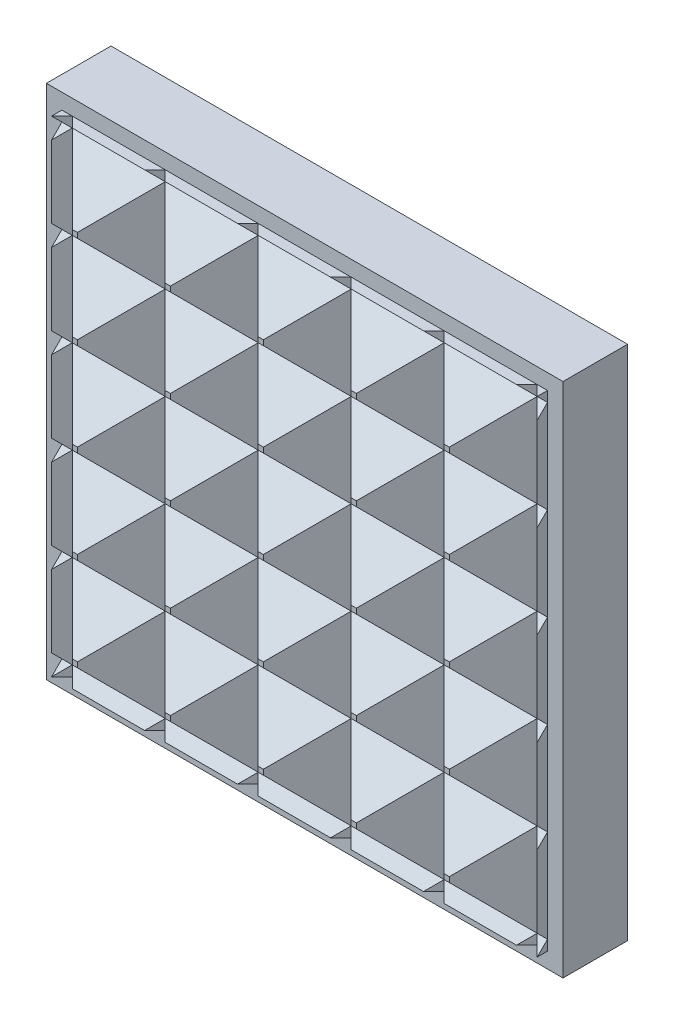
ISO-10303-21;
HEADER;
FILE_DESCRIPTION(('STEP AP214'),'2;1');
FILE_NAME('part.step','',(''),(''),'','','');
FILE_SCHEMA(('AUTOMOTIVE_DESIGN { 1 0 10303 214 1 1 1 1 }'));
ENDSEC;
DATA;
#1=APPLICATION_CONTEXT('core data for automotive mechanical design processes');
#2=APPLICATION_PROTOCOL_DEFINITION('international standard','automotive_design',2000,#1);
#3=PRODUCT_CONTEXT('',#1,'mechanical');
#4=PRODUCT('Part','Part','',(#3));
#5=PRODUCT_RELATED_PRODUCT_CATEGORY('part','',(#4));
#6=PRODUCT_DEFINITION_FORMATION('','',#4);
#7=PRODUCT_DEFINITION_CONTEXT('part definition',#1,'design');
#8=PRODUCT_DEFINITION('design','',#6,#7);
#9=PRODUCT_DEFINITION_SHAPE('','',#8);
#10=(LENGTH_UNIT() NAMED_UNIT(*) SI_UNIT(.MILLI.,.METRE.));
#11=(NAMED_UNIT(*) PLANE_ANGLE_UNIT() SI_UNIT($,.RADIAN.));
#12=(NAMED_UNIT(*) SI_UNIT($,.STERADIAN.) SOLID_ANGLE_UNIT());
#13=UNCERTAINTY_MEASURE_WITH_UNIT(LENGTH_MEASURE(1.E-05),#10,'distance_accuracy_value','');
#14=(GEOMETRIC_REPRESENTATION_CONTEXT(3) GLOBAL_UNCERTAINTY_ASSIGNED_CONTEXT((#13)) GLOBAL_UNIT_ASSIGNED_CONTEXT((#10,
#11,#12)) REPRESENTATION_CONTEXT('',''));
#15=CARTESIAN_POINT('',(0.,0.,0.));
#16=DIRECTION('',(0.,0.,1.));
#17=DIRECTION('',(1.,0.,0.));
#18=AXIS2_PLACEMENT_3D('',#15,#16,#17);
#19=CARTESIAN_POINT('',(-6.35,1.143,2.0955));
#20=DIRECTION('',(0.,-0.707106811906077,-0.707106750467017));
#21=DIRECTION('',(0.,0.707106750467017,-0.707106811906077));
#22=AXIS2_PLACEMENT_3D('',#19,#20,#21);
#23=PLANE('',#22);
#24=DIRECTION('',(1.,0.,0.));
#25=VECTOR('',#24,1.);
#26=CARTESIAN_POINT('',(-6.35,1.143,2.0955));
#27=LINE('',#26,#25);
#28=CARTESIAN_POINT('',(-5.715,1.14299999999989,2.09549999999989));
#29=VERTEX_POINT('',#28);
#30=CARTESIAN_POINT('',(-3.429,1.14299999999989,2.09549999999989));
#31=VERTEX_POINT('',#30);
#32=EDGE_CURVE('E1763',#29,#31,#27,.T.);
#33=ORIENTED_EDGE('',*,*,#32,.F.);
#34=DIRECTION('',(0.577350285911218,-0.577350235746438,0.57735028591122));
#35=VECTOR('',#34,1.);
#36=CARTESIAN_POINT('',(-5.92666667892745,1.35466666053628,1.88383332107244));
#37=LINE('',#36,#35);
#38=CARTESIAN_POINT('',(-4.6354999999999,0.0635000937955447,3.175));
#39=VERTEX_POINT('',#38);
#40=EDGE_CURVE('E1253',#29,#39,#37,.T.);
#41=ORIENTED_EDGE('',*,*,#40,.T.);
#42=DIRECTION('',(1.,0.,0.));
#43=VECTOR('',#42,1.);
#44=CARTESIAN_POINT('',(-6.35,0.0635000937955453,3.175));
#45=LINE('',#44,#43);
#46=CARTESIAN_POINT('',(-4.50850000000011,0.0635000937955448,3.175));
#47=VERTEX_POINT('',#46);
#48=EDGE_CURVE('E1821',#39,#47,#45,.T.);
#49=ORIENTED_EDGE('',*,*,#48,.T.);
#50=DIRECTION('',(0.577350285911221,0.577350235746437,-0.577350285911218));
#51=VECTOR('',#50,1.);
#52=CARTESIAN_POINT('',(-4.40266672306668,0.169333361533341,3.06916672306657));
#53=LINE('',#52,#51);
#54=EDGE_CURVE('E1206',#47,#31,#53,.T.);
#55=ORIENTED_EDGE('',*,*,#54,.T.);
#56=EDGE_LOOP('',(#33,#41,#49,#55));
#57=FACE_BOUND('',#56,.T.);
#58=ADVANCED_FACE('F15',(#57),#23,.F.);
#59=CARTESIAN_POINT('',(-6.35,1.143,2.0955));
#60=DIRECTION('',(0.,0.707106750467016,-0.707106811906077));
#61=DIRECTION('',(0.,0.707106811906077,0.707106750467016));
#62=AXIS2_PLACEMENT_3D('',#59,#60,#61);
#63=PLANE('',#62);
#64=DIRECTION('',(-1.,0.,0.));
#65=VECTOR('',#64,1.);
#66=CARTESIAN_POINT('',(-6.35,2.22250009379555,3.175));
#67=LINE('',#66,#65);
#68=CARTESIAN_POINT('',(-4.50850000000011,2.22250009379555,3.175));
#69=VERTEX_POINT('',#68);
#70=CARTESIAN_POINT('',(-4.6354999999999,2.22250009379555,3.175));
#71=VERTEX_POINT('',#70);
#72=EDGE_CURVE('E1815',#69,#71,#67,.T.);
#73=ORIENTED_EDGE('',*,*,#72,.T.);
#74=DIRECTION('',(-0.577350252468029,-0.577350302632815,-0.577350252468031));
#75=VECTOR('',#74,1.);
#76=CARTESIAN_POINT('',(-5.92666665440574,0.93133332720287,1.88383334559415));
#77=LINE('',#76,#75);
#78=EDGE_CURVE('E1256',#71,#29,#77,.T.);
#79=ORIENTED_EDGE('',*,*,#78,.T.);
#80=ORIENTED_EDGE('',*,*,#32,.T.);
#81=DIRECTION('',(-0.577350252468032,0.577350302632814,0.57735025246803));
#82=VECTOR('',#81,1.);
#83=CARTESIAN_POINT('',(-4.40266661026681,2.11666669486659,3.0691666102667));
#84=LINE('',#83,#82);
#85=EDGE_CURVE('E1209',#31,#69,#84,.T.);
#86=ORIENTED_EDGE('',*,*,#85,.T.);
#87=EDGE_LOOP('',(#73,#79,#80,#86));
#88=FACE_BOUND('',#87,.T.);
#89=ADVANCED_FACE('F1995',(#88),#63,.F.);
#90=CARTESIAN_POINT('',(-6.35,-1.143,2.0955));
#91=DIRECTION('',(0.,0.707106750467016,-0.707106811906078));
#92=DIRECTION('',(0.,0.707106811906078,0.707106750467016));
#93=AXIS2_PLACEMENT_3D('',#90,#91,#92);
#94=PLANE('',#93);
#95=DIRECTION('',(-1.,0.,0.));
#96=VECTOR('',#95,1.);
#97=CARTESIAN_POINT('',(-6.35,-0.0634999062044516,3.175));
#98=LINE('',#97,#96);
#99=CARTESIAN_POINT('',(-4.50850000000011,-0.0634999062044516,3.175));
#100=VERTEX_POINT('',#99);
#101=CARTESIAN_POINT('',(-4.6354999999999,-0.0634999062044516,3.175));
#102=VERTEX_POINT('',#101);
#103=EDGE_CURVE('E1713',#100,#102,#98,.T.);
#104=ORIENTED_EDGE('',*,*,#103,.T.);
#105=DIRECTION('',(-0.577350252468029,-0.577350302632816,-0.577350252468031));
#106=VECTOR('',#105,1.);
#107=CARTESIAN_POINT('',(-5.92666665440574,-1.35466667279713,1.88383334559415));
#108=LINE('',#107,#106);
#109=CARTESIAN_POINT('',(-5.715,-1.14299999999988,2.09549999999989));
#110=VERTEX_POINT('',#109);
#111=EDGE_CURVE('E1248',#102,#110,#108,.T.);
#112=ORIENTED_EDGE('',*,*,#111,.T.);
#113=DIRECTION('',(1.,0.,0.));
#114=VECTOR('',#113,1.);
#115=CARTESIAN_POINT('',(-6.35,-1.143,2.0955));
#116=LINE('',#115,#114);
#117=CARTESIAN_POINT('',(-3.429,-1.14299999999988,2.09549999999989));
#118=VERTEX_POINT('',#117);
#119=EDGE_CURVE('E1709',#110,#118,#116,.T.);
#120=ORIENTED_EDGE('',*,*,#119,.T.);
#121=DIRECTION('',(-0.577350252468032,0.577350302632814,0.57735025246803));
#122=VECTOR('',#121,1.);
#123=CARTESIAN_POINT('',(-4.40266661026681,-0.169333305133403,3.0691666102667));
#124=LINE('',#123,#122);
#125=EDGE_CURVE('E1201',#118,#100,#124,.T.);
#126=ORIENTED_EDGE('',*,*,#125,.T.);
#127=EDGE_LOOP('',(#104,#112,#120,#126));
#128=FACE_BOUND('',#127,.T.);
#129=ADVANCED_FACE('F2004',(#128),#94,.F.);
#130=CARTESIAN_POINT('',(-6.35,-1.143,2.0955));
#131=DIRECTION('',(0.,-0.707106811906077,-0.707106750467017));
#132=DIRECTION('',(0.,0.707106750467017,-0.707106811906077));
#133=AXIS2_PLACEMENT_3D('',#130,#131,#132);
#134=PLANE('',#133);
#135=ORIENTED_EDGE('',*,*,#119,.F.);
#136=DIRECTION('',(0.577350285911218,-0.577350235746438,0.57735028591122));
#137=VECTOR('',#136,1.);
#138=CARTESIAN_POINT('',(-5.92666667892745,-0.931333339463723,1.88383332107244));
#139=LINE('',#138,#137);
#140=CARTESIAN_POINT('',(-4.6354999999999,-2.22249990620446,3.175));
#141=VERTEX_POINT('',#140);
#142=EDGE_CURVE('E1245',#110,#141,#139,.T.);
#143=ORIENTED_EDGE('',*,*,#142,.T.);
#144=DIRECTION('',(1.,0.,0.));
#145=VECTOR('',#144,1.);
#146=CARTESIAN_POINT('',(-6.35,-2.22249990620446,3.175));
#147=LINE('',#146,#145);
#148=CARTESIAN_POINT('',(-4.50850000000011,-2.22249990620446,3.175));
#149=VERTEX_POINT('',#148);
#150=EDGE_CURVE('E1725',#141,#149,#147,.T.);
#151=ORIENTED_EDGE('',*,*,#150,.T.);
#152=DIRECTION('',(0.577350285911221,0.577350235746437,-0.577350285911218));
#153=VECTOR('',#152,1.);
#154=CARTESIAN_POINT('',(-4.40266672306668,-2.11666663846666,3.06916672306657));
#155=LINE('',#154,#153);
#156=EDGE_CURVE('E1198',#149,#118,#155,.T.);
#157=ORIENTED_EDGE('',*,*,#156,.T.);
#158=EDGE_LOOP('',(#135,#143,#151,#157));
#159=FACE_BOUND('',#158,.T.);
#160=ADVANCED_FACE('F2385',(#159),#134,.F.);
#161=CARTESIAN_POINT('',(-6.35,-3.429,2.0955));
#162=DIRECTION('',(0.,-0.707106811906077,-0.707106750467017));
#163=DIRECTION('',(0.,0.707106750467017,-0.707106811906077));
#164=AXIS2_PLACEMENT_3D('',#161,#162,#163);
#165=PLANE('',#164);
#166=DIRECTION('',(1.,0.,0.));
#167=VECTOR('',#166,1.);
#168=CARTESIAN_POINT('',(-6.35,-3.429,2.0955));
#169=LINE('',#168,#167);
#170=CARTESIAN_POINT('',(-5.715,-3.42900000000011,2.09549999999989));
#171=VERTEX_POINT('',#170);
#172=CARTESIAN_POINT('',(-3.429,-3.42900000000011,2.09549999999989));
#173=VERTEX_POINT('',#172);
#174=EDGE_CURVE('E1663',#171,#173,#169,.T.);
#175=ORIENTED_EDGE('',*,*,#174,.F.);
#176=DIRECTION('',(0.577350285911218,-0.577350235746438,0.57735028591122));
#177=VECTOR('',#176,1.);
#178=CARTESIAN_POINT('',(-5.92666667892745,-3.21733333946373,1.88383332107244));
#179=LINE('',#178,#177);
#180=CARTESIAN_POINT('',(-4.6354999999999,-4.50849990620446,3.175));
#181=VERTEX_POINT('',#180);
#182=EDGE_CURVE('E1237',#171,#181,#179,.T.);
#183=ORIENTED_EDGE('',*,*,#182,.T.);
#184=DIRECTION('',(1.,0.,0.));
#185=VECTOR('',#184,1.);
#186=CARTESIAN_POINT('',(-6.35,-4.50849990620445,3.175));
#187=LINE('',#186,#185);
#188=CARTESIAN_POINT('',(-4.50850000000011,-4.50849990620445,3.175));
#189=VERTEX_POINT('',#188);
#190=EDGE_CURVE('E1698',#181,#189,#187,.T.);
#191=ORIENTED_EDGE('',*,*,#190,.T.);
#192=DIRECTION('',(0.577350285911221,0.577350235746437,-0.577350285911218));
#193=VECTOR('',#192,1.);
#194=CARTESIAN_POINT('',(-4.40266672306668,-4.40266663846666,3.06916672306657));
#195=LINE('',#194,#193);
#196=EDGE_CURVE('E1190',#189,#173,#195,.T.);
#197=ORIENTED_EDGE('',*,*,#196,.T.);
#198=EDGE_LOOP('',(#175,#183,#191,#197));
#199=FACE_BOUND('',#198,.T.);
#200=ADVANCED_FACE('F1667',(#199),#165,.F.);
#201=CARTESIAN_POINT('',(-6.35,-3.429,2.0955));
#202=DIRECTION('',(0.,0.707106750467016,-0.707106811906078));
#203=DIRECTION('',(0.,0.707106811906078,0.707106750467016));
#204=AXIS2_PLACEMENT_3D('',#201,#202,#203);
#205=PLANE('',#204);
#206=DIRECTION('',(-1.,0.,0.));
#207=VECTOR('',#206,1.);
#208=CARTESIAN_POINT('',(-6.35,-2.34949990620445,3.175));
#209=LINE('',#208,#207);
#210=CARTESIAN_POINT('',(-4.50850000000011,-2.34949990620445,3.175));
#211=VERTEX_POINT('',#210);
#212=CARTESIAN_POINT('',(-4.6354999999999,-2.34949990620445,3.175));
#213=VERTEX_POINT('',#212);
#214=EDGE_CURVE('E1666',#211,#213,#209,.T.);
#215=ORIENTED_EDGE('',*,*,#214,.T.);
#216=DIRECTION('',(-0.577350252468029,-0.577350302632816,-0.577350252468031));
#217=VECTOR('',#216,1.);
#218=CARTESIAN_POINT('',(-5.92666665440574,-3.64066667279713,1.88383334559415));
#219=LINE('',#218,#217);
#220=EDGE_CURVE('E1240',#213,#171,#219,.T.);
#221=ORIENTED_EDGE('',*,*,#220,.T.);
#222=ORIENTED_EDGE('',*,*,#174,.T.);
#223=DIRECTION('',(-0.577350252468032,0.577350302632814,0.57735025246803));
#224=VECTOR('',#223,1.);
#225=CARTESIAN_POINT('',(-4.40266661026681,-2.45533330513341,3.0691666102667));
#226=LINE('',#225,#224);
#227=EDGE_CURVE('E1193',#173,#211,#226,.T.);
#228=ORIENTED_EDGE('',*,*,#227,.T.);
#229=EDGE_LOOP('',(#215,#221,#222,#228));
#230=FACE_BOUND('',#229,.T.);
#231=ADVANCED_FACE('F1662',(#230),#205,.F.);
#232=CARTESIAN_POINT('',(-6.35,-5.715,2.0955));
#233=DIRECTION('',(0.,-0.707106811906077,-0.707106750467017));
#234=DIRECTION('',(0.,0.707106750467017,-0.707106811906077));
#235=AXIS2_PLACEMENT_3D('',#232,#233,#234);
#236=PLANE('',#235);
#237=DIRECTION('',(0.577350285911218,-0.577350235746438,0.57735028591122));
#238=VECTOR('',#237,1.);
#239=CARTESIAN_POINT('',(-5.92666667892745,-5.50333333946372,1.88383332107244));
#240=LINE('',#239,#238);
#241=CARTESIAN_POINT('',(-5.715,-5.71500000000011,2.09549999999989));
#242=VERTEX_POINT('',#241);
#243=CARTESIAN_POINT('',(-5.46099997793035,-5.969,2.34950002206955));
#244=VERTEX_POINT('',#243);
#245=EDGE_CURVE('E1229',#242,#244,#240,.T.);
#246=ORIENTED_EDGE('',*,*,#245,.T.);
#247=DIRECTION('',(1.,0.,0.));
#248=VECTOR('',#247,1.);
#249=CARTESIAN_POINT('',(-6.35,-5.969,2.34950002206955));
#250=LINE('',#249,#248);
#251=CARTESIAN_POINT('',(-3.68300002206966,-5.969,2.34950002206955));
#252=VERTEX_POINT('',#251);
#253=EDGE_CURVE('E1444',#244,#252,#250,.T.);
#254=ORIENTED_EDGE('',*,*,#253,.T.);
#255=DIRECTION('',(0.577350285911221,0.577350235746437,-0.577350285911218));
#256=VECTOR('',#255,1.);
#257=CARTESIAN_POINT('',(-4.40266672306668,-6.68866663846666,3.06916672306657));
#258=LINE('',#257,#256);
#259=CARTESIAN_POINT('',(-3.429,-5.71500000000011,2.09549999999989));
#260=VERTEX_POINT('',#259);
#261=EDGE_CURVE('E1183',#252,#260,#258,.T.);
#262=ORIENTED_EDGE('',*,*,#261,.T.);
#263=DIRECTION('',(1.,0.,0.));
#264=VECTOR('',#263,1.);
#265=CARTESIAN_POINT('',(-6.35,-5.715,2.0955));
#266=LINE('',#265,#264);
#267=EDGE_CURVE('E793',#242,#260,#266,.T.);
#268=ORIENTED_EDGE('',*,*,#267,.F.);
#269=EDGE_LOOP('',(#246,#254,#262,#268));
#270=FACE_BOUND('',#269,.T.);
#271=ADVANCED_FACE('F1875',(#270),#236,.F.);
#272=CARTESIAN_POINT('',(-6.35,-5.715,2.0955));
#273=DIRECTION('',(0.,0.707106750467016,-0.707106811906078));
#274=DIRECTION('',(0.,0.707106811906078,0.707106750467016));
#275=AXIS2_PLACEMENT_3D('',#272,#273,#274);
#276=PLANE('',#275);
#277=DIRECTION('',(-1.,0.,0.));
#278=VECTOR('',#277,1.);
#279=CARTESIAN_POINT('',(-6.35,-4.63549990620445,3.175));
#280=LINE('',#279,#278);
#281=CARTESIAN_POINT('',(-4.50850000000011,-4.63549990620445,3.175));
#282=VERTEX_POINT('',#281);
#283=CARTESIAN_POINT('',(-4.6354999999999,-4.63549990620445,3.175));
#284=VERTEX_POINT('',#283);
#285=EDGE_CURVE('E1916',#282,#284,#280,.T.);
#286=ORIENTED_EDGE('',*,*,#285,.T.);
#287=DIRECTION('',(-0.577350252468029,-0.577350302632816,-0.577350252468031));
#288=VECTOR('',#287,1.);
#289=CARTESIAN_POINT('',(-5.92666665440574,-5.92666667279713,1.88383334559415));
#290=LINE('',#289,#288);
#291=EDGE_CURVE('E1232',#284,#242,#290,.T.);
#292=ORIENTED_EDGE('',*,*,#291,.T.);
#293=ORIENTED_EDGE('',*,*,#267,.T.);
#294=DIRECTION('',(-0.577350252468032,0.577350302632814,0.57735025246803));
#295=VECTOR('',#294,1.);
#296=CARTESIAN_POINT('',(-4.40266661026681,-4.7413333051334,3.0691666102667));
#297=LINE('',#296,#295);
#298=EDGE_CURVE('E1185',#260,#282,#297,.T.);
#299=ORIENTED_EDGE('',*,*,#298,.T.);
#300=EDGE_LOOP('',(#286,#292,#293,#299));
#301=FACE_BOUND('',#300,.T.);
#302=ADVANCED_FACE('F1880',(#301),#276,.F.);
#303=CARTESIAN_POINT('',(-6.35,3.429,2.0955));
#304=DIRECTION('',(0.,-0.707106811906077,-0.707106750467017));
#305=DIRECTION('',(0.,0.707106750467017,-0.707106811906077));
#306=AXIS2_PLACEMENT_3D('',#303,#304,#305);
#307=PLANE('',#306);
#308=DIRECTION('',(1.,0.,0.));
#309=VECTOR('',#308,1.);
#310=CARTESIAN_POINT('',(-6.35,3.429,2.0955));
#311=LINE('',#310,#309);
#312=CARTESIAN_POINT('',(-5.715,3.42899999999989,2.09549999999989));
#313=VERTEX_POINT('',#312);
#314=CARTESIAN_POINT('',(-3.429,3.42899999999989,2.09549999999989));
#315=VERTEX_POINT('',#314);
#316=EDGE_CURVE('E863',#313,#315,#311,.T.);
#317=ORIENTED_EDGE('',*,*,#316,.F.);
#318=DIRECTION('',(0.577350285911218,-0.577350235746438,0.57735028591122));
#319=VECTOR('',#318,1.);
#320=CARTESIAN_POINT('',(-5.92666667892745,3.64066666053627,1.88383332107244));
#321=LINE('',#320,#319);
#322=CARTESIAN_POINT('',(-4.6354999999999,2.34950009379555,3.175));
#323=VERTEX_POINT('',#322);
#324=EDGE_CURVE('E1261',#313,#323,#321,.T.);
#325=ORIENTED_EDGE('',*,*,#324,.T.);
#326=DIRECTION('',(1.,0.,0.));
#327=VECTOR('',#326,1.);
#328=CARTESIAN_POINT('',(-6.35,2.34950009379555,3.175));
#329=LINE('',#328,#327);
#330=CARTESIAN_POINT('',(-4.50850000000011,2.34950009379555,3.175));
#331=VERTEX_POINT('',#330);
#332=EDGE_CURVE('E835',#323,#331,#329,.T.);
#333=ORIENTED_EDGE('',*,*,#332,.T.);
#334=DIRECTION('',(0.577350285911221,0.577350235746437,-0.577350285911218));
#335=VECTOR('',#334,1.);
#336=CARTESIAN_POINT('',(-4.40266672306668,2.45533336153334,3.06916672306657));
#337=LINE('',#336,#335);
#338=EDGE_CURVE('E1214',#331,#315,#337,.T.);
#339=ORIENTED_EDGE('',*,*,#338,.T.);
#340=EDGE_LOOP('',(#317,#325,#333,#339));
#341=FACE_BOUND('',#340,.T.);
#342=ADVANCED_FACE('F2591',(#341),#307,.F.);
#343=CARTESIAN_POINT('',(-6.35,3.429,2.0955));
#344=DIRECTION('',(0.,0.707106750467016,-0.707106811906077));
#345=DIRECTION('',(0.,0.707106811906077,0.707106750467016));
#346=AXIS2_PLACEMENT_3D('',#343,#344,#345);
#347=PLANE('',#346);
#348=DIRECTION('',(-1.,0.,0.));
#349=VECTOR('',#348,1.);
#350=CARTESIAN_POINT('',(-6.35,4.50850009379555,3.175));
#351=LINE('',#350,#349);
#352=CARTESIAN_POINT('',(-4.50850000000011,4.50850009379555,3.175));
#353=VERTEX_POINT('',#352);
#354=CARTESIAN_POINT('',(-4.6354999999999,4.50850009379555,3.175));
#355=VERTEX_POINT('',#354);
#356=EDGE_CURVE('E857',#353,#355,#351,.T.);
#357=ORIENTED_EDGE('',*,*,#356,.T.);
#358=DIRECTION('',(-0.577350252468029,-0.577350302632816,-0.577350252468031));
#359=VECTOR('',#358,1.);
#360=CARTESIAN_POINT('',(-5.92666665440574,3.21733332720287,1.88383334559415));
#361=LINE('',#360,#359);
#362=EDGE_CURVE('E1263',#355,#313,#361,.T.);
#363=ORIENTED_EDGE('',*,*,#362,.T.);
#364=ORIENTED_EDGE('',*,*,#316,.T.);
#365=DIRECTION('',(-0.577350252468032,0.577350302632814,0.57735025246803));
#366=VECTOR('',#365,1.);
#367=CARTESIAN_POINT('',(-4.40266661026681,4.4026666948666,3.0691666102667));
#368=LINE('',#367,#366);
#369=EDGE_CURVE('E1216',#315,#353,#368,.T.);
#370=ORIENTED_EDGE('',*,*,#369,.T.);
#371=EDGE_LOOP('',(#357,#363,#364,#370));
#372=FACE_BOUND('',#371,.T.);
#373=ADVANCED_FACE('F2622',(#372),#347,.F.);
#374=CARTESIAN_POINT('',(-6.35,5.715,2.0955));
#375=DIRECTION('',(0.,0.707106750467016,-0.707106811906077));
#376=DIRECTION('',(0.,0.707106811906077,0.707106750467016));
#377=AXIS2_PLACEMENT_3D('',#374,#375,#376);
#378=PLANE('',#377);
#379=DIRECTION('',(-0.577350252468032,0.577350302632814,0.57735025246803));
#380=VECTOR('',#379,1.);
#381=CARTESIAN_POINT('',(-4.40266661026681,6.6886666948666,3.0691666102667));
#382=LINE('',#381,#380);
#383=CARTESIAN_POINT('',(-3.42900000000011,5.715,2.0955));
#384=VERTEX_POINT('',#383);
#385=CARTESIAN_POINT('',(-3.68299997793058,5.969,2.34949997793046));
#386=VERTEX_POINT('',#385);
#387=EDGE_CURVE('E1221',#384,#386,#382,.T.);
#388=ORIENTED_EDGE('',*,*,#387,.T.);
#389=DIRECTION('',(-1.,0.,0.));
#390=VECTOR('',#389,1.);
#391=CARTESIAN_POINT('',(-6.35,5.969,2.34949997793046));
#392=LINE('',#391,#390);
#393=CARTESIAN_POINT('',(-5.46100002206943,5.969,2.34949997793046));
#394=VERTEX_POINT('',#393);
#395=EDGE_CURVE('E1396',#386,#394,#392,.T.);
#396=ORIENTED_EDGE('',*,*,#395,.T.);
#397=DIRECTION('',(-0.577350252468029,-0.577350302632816,-0.577350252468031));
#398=VECTOR('',#397,1.);
#399=CARTESIAN_POINT('',(-5.92666665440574,5.50333332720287,1.88383334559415));
#400=LINE('',#399,#398);
#401=CARTESIAN_POINT('',(-5.71500000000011,5.715,2.0955));
#402=VERTEX_POINT('',#401);
#403=EDGE_CURVE('E1268',#394,#402,#400,.T.);
#404=ORIENTED_EDGE('',*,*,#403,.T.);
#405=DIRECTION('',(1.,0.,0.));
#406=VECTOR('',#405,1.);
#407=CARTESIAN_POINT('',(-6.35,5.715,2.0955));
#408=LINE('',#407,#406);
#409=EDGE_CURVE('E881',#402,#384,#408,.T.);
#410=ORIENTED_EDGE('',*,*,#409,.T.);
#411=EDGE_LOOP('',(#388,#396,#404,#410));
#412=FACE_BOUND('',#411,.T.);
#413=ADVANCED_FACE('F2335',(#412),#378,.F.);
#414=CARTESIAN_POINT('',(-6.35,5.715,2.0955));
#415=DIRECTION('',(0.,-0.707106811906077,-0.707106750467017));
#416=DIRECTION('',(0.,0.707106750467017,-0.707106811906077));
#417=AXIS2_PLACEMENT_3D('',#414,#415,#416);
#418=PLANE('',#417);
#419=ORIENTED_EDGE('',*,*,#409,.F.);
#420=DIRECTION('',(0.577350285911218,-0.577350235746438,0.57735028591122));
#421=VECTOR('',#420,1.);
#422=CARTESIAN_POINT('',(-5.92666667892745,5.92666666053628,1.88383332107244));
#423=LINE('',#422,#421);
#424=CARTESIAN_POINT('',(-4.6354999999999,4.63550009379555,3.175));
#425=VERTEX_POINT('',#424);
#426=EDGE_CURVE('E1863',#402,#425,#423,.T.);
#427=ORIENTED_EDGE('',*,*,#426,.T.);
#428=DIRECTION('',(1.,0.,0.));
#429=VECTOR('',#428,1.);
#430=CARTESIAN_POINT('',(-6.35,4.63550009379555,3.175));
#431=LINE('',#430,#429);
#432=CARTESIAN_POINT('',(-4.50850000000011,4.63550009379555,3.175));
#433=VERTEX_POINT('',#432);
#434=EDGE_CURVE('E871',#425,#433,#431,.T.);
#435=ORIENTED_EDGE('',*,*,#434,.T.);
#436=DIRECTION('',(0.577350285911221,0.577350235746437,-0.577350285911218));
#437=VECTOR('',#436,1.);
#438=CARTESIAN_POINT('',(-4.40266672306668,4.74133336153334,3.06916672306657));
#439=LINE('',#438,#437);
#440=EDGE_CURVE('E1854',#433,#384,#439,.T.);
#441=ORIENTED_EDGE('',*,*,#440,.T.);
#442=EDGE_LOOP('',(#419,#427,#435,#441));
#443=FACE_BOUND('',#442,.T.);
#444=ADVANCED_FACE('F2090',(#443),#418,.F.);
#445=CARTESIAN_POINT('',(-6.35,-6.35,3.175));
#446=DIRECTION('',(0.,0.,1.));
#447=DIRECTION('',(1.,0.,0.));
#448=AXIS2_PLACEMENT_3D('',#445,#446,#447);
#449=PLANE('',#448);
#450=DIRECTION('',(0.,1.,0.));
#451=VECTOR('',#450,1.);
#452=CARTESIAN_POINT('',(-2.3494999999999,-6.35,3.175));
#453=LINE('',#452,#451);
#454=CARTESIAN_POINT('',(-2.3494999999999,2.22250009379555,3.175));
#455=VERTEX_POINT('',#454);
#456=CARTESIAN_POINT('',(-2.3494999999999,2.34950009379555,3.175));
#457=VERTEX_POINT('',#456);
#458=EDGE_CURVE('E1171',#455,#457,#453,.T.);
#459=ORIENTED_EDGE('',*,*,#458,.F.);
#460=CARTESIAN_POINT('',(-2.22250000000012,2.22250009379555,3.175));
#461=VERTEX_POINT('',#460);
#462=EDGE_CURVE('E1820',#461,#455,#67,.T.);
#463=ORIENTED_EDGE('',*,*,#462,.F.);
#464=DIRECTION('',(0.,-1.,0.));
#465=VECTOR('',#464,1.);
#466=CARTESIAN_POINT('',(-2.22250000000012,-6.35,3.175));
#467=LINE('',#466,#465);
#468=CARTESIAN_POINT('',(-2.22250000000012,2.34950009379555,3.175));
#469=VERTEX_POINT('',#468);
#470=EDGE_CURVE('E1740',#469,#461,#467,.T.);
#471=ORIENTED_EDGE('',*,*,#470,.F.);
#472=EDGE_CURVE('E840',#457,#469,#329,.T.);
#473=ORIENTED_EDGE('',*,*,#472,.F.);
#474=EDGE_LOOP('',(#459,#463,#471,#473));
#475=FACE_BOUND('',#474,.T.);
#476=ADVANCED_FACE('F2030',(#475),#449,.T.);
#477=DIRECTION('',(0.,1.,0.));
#478=VECTOR('',#477,1.);
#479=CARTESIAN_POINT('',(-2.3494999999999,-6.35,3.175));
#480=LINE('',#479,#478);
#481=CARTESIAN_POINT('',(-2.3494999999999,-4.63549990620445,3.175));
#482=VERTEX_POINT('',#481);
#483=CARTESIAN_POINT('',(-2.3494999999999,-4.50849990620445,3.175));
#484=VERTEX_POINT('',#483);
#485=EDGE_CURVE('E1147',#482,#484,#480,.T.);
#486=ORIENTED_EDGE('',*,*,#485,.F.);
#487=CARTESIAN_POINT('',(-2.22250000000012,-4.63549990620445,3.175));
#488=VERTEX_POINT('',#487);
#489=EDGE_CURVE('E1903',#488,#482,#280,.T.);
#490=ORIENTED_EDGE('',*,*,#489,.F.);
#491=DIRECTION('',(0.,-1.,0.));
#492=VECTOR('',#491,1.);
#493=CARTESIAN_POINT('',(-2.22250000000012,-6.35,3.175));
#494=LINE('',#493,#492);
#495=CARTESIAN_POINT('',(-2.22250000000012,-4.50849990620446,3.175));
#496=VERTEX_POINT('',#495);
#497=EDGE_CURVE('E1743',#496,#488,#494,.T.);
#498=ORIENTED_EDGE('',*,*,#497,.F.);
#499=EDGE_CURVE('E1697',#484,#496,#187,.T.);
#500=ORIENTED_EDGE('',*,*,#499,.F.);
#501=EDGE_LOOP('',(#486,#490,#498,#500));
#502=FACE_BOUND('',#501,.T.);
#503=ADVANCED_FACE('F1934',(#502),#449,.T.);
#504=DIRECTION('',(0.,1.,0.));
#505=VECTOR('',#504,1.);
#506=CARTESIAN_POINT('',(-2.3494999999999,-6.35,3.175));
#507=LINE('',#506,#505);
#508=CARTESIAN_POINT('',(-2.3494999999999,-2.34949990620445,3.175));
#509=VERTEX_POINT('',#508);
#510=CARTESIAN_POINT('',(-2.3494999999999,-2.22249990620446,3.175));
#511=VERTEX_POINT('',#510);
#512=EDGE_CURVE('E1155',#509,#511,#507,.T.);
#513=ORIENTED_EDGE('',*,*,#512,.F.);
#514=CARTESIAN_POINT('',(-2.22250000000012,-2.34949990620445,3.175));
#515=VERTEX_POINT('',#514);
#516=EDGE_CURVE('E1684',#515,#509,#209,.T.);
#517=ORIENTED_EDGE('',*,*,#516,.F.);
#518=CARTESIAN_POINT('',(-2.22250000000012,-2.22249990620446,3.175));
#519=VERTEX_POINT('',#518);
#520=EDGE_CURVE('E1748',#519,#515,#494,.T.);
#521=ORIENTED_EDGE('',*,*,#520,.F.);
#522=EDGE_CURVE('E1724',#511,#519,#147,.T.);
#523=ORIENTED_EDGE('',*,*,#522,.F.);
#524=EDGE_LOOP('',(#513,#517,#521,#523));
#525=FACE_BOUND('',#524,.T.);
#526=ADVANCED_FACE('F2518',(#525),#449,.T.);
#527=DIRECTION('',(0.,1.,0.));
#528=VECTOR('',#527,1.);
#529=CARTESIAN_POINT('',(-2.3494999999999,-6.35,3.175));
#530=LINE('',#529,#528);
#531=CARTESIAN_POINT('',(-2.3494999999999,-0.0634999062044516,3.175));
#532=VERTEX_POINT('',#531);
#533=CARTESIAN_POINT('',(-2.3494999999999,0.0635000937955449,3.175));
#534=VERTEX_POINT('',#533);
#535=EDGE_CURVE('E1163',#532,#534,#530,.T.);
#536=ORIENTED_EDGE('',*,*,#535,.F.);
#537=CARTESIAN_POINT('',(-2.22250000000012,-0.0634999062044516,3.175));
#538=VERTEX_POINT('',#537);
#539=EDGE_CURVE('E1714',#538,#532,#98,.T.);
#540=ORIENTED_EDGE('',*,*,#539,.F.);
#541=CARTESIAN_POINT('',(-2.22250000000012,0.063500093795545,3.175));
#542=VERTEX_POINT('',#541);
#543=EDGE_CURVE('E1744',#542,#538,#494,.T.);
#544=ORIENTED_EDGE('',*,*,#543,.F.);
#545=EDGE_CURVE('E1824',#534,#542,#45,.T.);
#546=ORIENTED_EDGE('',*,*,#545,.F.);
#547=EDGE_LOOP('',(#536,#540,#544,#546));
#548=FACE_BOUND('',#547,.T.);
#549=ADVANCED_FACE('F3849',(#548),#449,.T.);
#550=DIRECTION('',(0.,1.,0.));
#551=VECTOR('',#550,1.);
#552=CARTESIAN_POINT('',(-2.3494999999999,-6.35,3.175));
#553=LINE('',#552,#551);
#554=CARTESIAN_POINT('',(-2.3494999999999,4.50850009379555,3.175));
#555=VERTEX_POINT('',#554);
#556=CARTESIAN_POINT('',(-2.3494999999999,4.63550009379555,3.175));
#557=VERTEX_POINT('',#556);
#558=EDGE_CURVE('E1179',#555,#557,#553,.T.);
#559=ORIENTED_EDGE('',*,*,#558,.F.);
#560=CARTESIAN_POINT('',(-2.22250000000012,4.50850009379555,3.175));
#561=VERTEX_POINT('',#560);
#562=EDGE_CURVE('E854',#561,#555,#351,.T.);
#563=ORIENTED_EDGE('',*,*,#562,.F.);
#564=CARTESIAN_POINT('',(-2.22250000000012,4.63550009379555,3.175));
#565=VERTEX_POINT('',#564);
#566=EDGE_CURVE('E1741',#565,#561,#467,.T.);
#567=ORIENTED_EDGE('',*,*,#566,.F.);
#568=EDGE_CURVE('E873',#557,#565,#431,.T.);
#569=ORIENTED_EDGE('',*,*,#568,.F.);
#570=EDGE_LOOP('',(#559,#563,#567,#569));
#571=FACE_BOUND('',#570,.T.);
#572=ADVANCED_FACE('F2012',(#571),#449,.T.);
#573=CARTESIAN_POINT('',(-1.143,1.14299999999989,2.09549999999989));
#574=VERTEX_POINT('',#573);
#575=EDGE_CURVE('E2558',#31,#574,#27,.T.);
#576=ORIENTED_EDGE('',*,*,#575,.F.);
#577=DIRECTION('',(0.577350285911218,-0.577350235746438,0.57735028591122));
#578=VECTOR('',#577,1.);
#579=CARTESIAN_POINT('',(-4.40266672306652,2.11666663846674,1.12183327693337));
#580=LINE('',#579,#578);
#581=EDGE_CURVE('E1165',#31,#534,#580,.T.);
#582=ORIENTED_EDGE('',*,*,#581,.T.);
#583=ORIENTED_EDGE('',*,*,#545,.T.);
#584=DIRECTION('',(0.577350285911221,0.577350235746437,-0.577350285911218));
#585=VECTOR('',#584,1.);
#586=CARTESIAN_POINT('',(-2.87866676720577,-0.592666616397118,3.83116676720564));
#587=LINE('',#586,#585);
#588=EDGE_CURVE('E1735',#542,#574,#587,.T.);
#589=ORIENTED_EDGE('',*,*,#588,.T.);
#590=EDGE_LOOP('',(#576,#582,#583,#589));
#591=FACE_BOUND('',#590,.T.);
#592=ADVANCED_FACE('F1998',(#591),#23,.F.);
#593=ORIENTED_EDGE('',*,*,#462,.T.);
#594=DIRECTION('',(-0.577350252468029,-0.577350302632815,-0.577350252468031));
#595=VECTOR('',#594,1.);
#596=CARTESIAN_POINT('',(-4.40266661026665,0.169333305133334,1.12183338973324));
#597=LINE('',#596,#595);
#598=EDGE_CURVE('E1168',#455,#31,#597,.T.);
#599=ORIENTED_EDGE('',*,*,#598,.T.);
#600=ORIENTED_EDGE('',*,*,#575,.T.);
#601=DIRECTION('',(-0.577350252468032,0.577350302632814,0.57735025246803));
#602=VECTOR('',#601,1.);
#603=CARTESIAN_POINT('',(-2.87866656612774,2.87866671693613,3.83116656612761));
#604=LINE('',#603,#602);
#605=EDGE_CURVE('E1823',#574,#461,#604,.T.);
#606=ORIENTED_EDGE('',*,*,#605,.T.);
#607=EDGE_LOOP('',(#593,#599,#600,#606));
#608=FACE_BOUND('',#607,.T.);
#609=ADVANCED_FACE('F2007',(#608),#63,.F.);
#610=ORIENTED_EDGE('',*,*,#539,.T.);
#611=DIRECTION('',(-0.577350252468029,-0.577350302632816,-0.577350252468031));
#612=VECTOR('',#611,1.);
#613=CARTESIAN_POINT('',(-4.40266661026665,-2.11666669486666,1.12183338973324));
#614=LINE('',#613,#612);
#615=EDGE_CURVE('E1160',#532,#118,#614,.T.);
#616=ORIENTED_EDGE('',*,*,#615,.T.);
#617=CARTESIAN_POINT('',(-1.143,-1.14300000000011,2.09549999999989));
#618=VERTEX_POINT('',#617);
#619=EDGE_CURVE('E2389',#118,#618,#116,.T.);
#620=ORIENTED_EDGE('',*,*,#619,.T.);
#621=DIRECTION('',(0.577350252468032,-0.577350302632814,-0.57735025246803));
#622=VECTOR('',#621,1.);
#623=CARTESIAN_POINT('',(0.592666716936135,-2.87866686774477,0.359833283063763));
#624=LINE('',#623,#622);
#625=EDGE_CURVE('E1831',#538,#618,#624,.T.);
#626=ORIENTED_EDGE('',*,*,#625,.F.);
#627=EDGE_LOOP('',(#610,#616,#620,#626));
#628=FACE_BOUND('',#627,.T.);
#629=ADVANCED_FACE('F2388',(#628),#94,.F.);
#630=ORIENTED_EDGE('',*,*,#619,.F.);
#631=DIRECTION('',(0.577350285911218,-0.577350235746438,0.57735028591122));
#632=VECTOR('',#631,1.);
#633=CARTESIAN_POINT('',(-4.40266672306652,-0.169333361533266,1.12183327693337));
#634=LINE('',#633,#632);
#635=EDGE_CURVE('E1157',#118,#511,#634,.T.);
#636=ORIENTED_EDGE('',*,*,#635,.T.);
#637=ORIENTED_EDGE('',*,*,#522,.T.);
#638=DIRECTION('',(-0.577350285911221,-0.577350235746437,0.577350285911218));
#639=VECTOR('',#638,1.);
#640=CARTESIAN_POINT('',(-2.87866661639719,-2.87866646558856,3.83116661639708));
#641=LINE('',#640,#639);
#642=EDGE_CURVE('E1834',#618,#519,#641,.T.);
#643=ORIENTED_EDGE('',*,*,#642,.F.);
#644=EDGE_LOOP('',(#630,#636,#637,#643));
#645=FACE_BOUND('',#644,.T.);
#646=ADVANCED_FACE('F2392',(#645),#134,.F.);
#647=CARTESIAN_POINT('',(-1.14300000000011,-3.429,2.0955));
#648=VERTEX_POINT('',#647);
#649=EDGE_CURVE('E1670',#173,#648,#169,.T.);
#650=ORIENTED_EDGE('',*,*,#649,.F.);
#651=DIRECTION('',(0.577350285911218,-0.577350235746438,0.57735028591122));
#652=VECTOR('',#651,1.);
#653=CARTESIAN_POINT('',(-4.40266672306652,-2.45533336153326,1.12183327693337));
#654=LINE('',#653,#652);
#655=EDGE_CURVE('E1149',#173,#484,#654,.T.);
#656=ORIENTED_EDGE('',*,*,#655,.T.);
#657=ORIENTED_EDGE('',*,*,#499,.T.);
#658=DIRECTION('',(-0.577350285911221,-0.577350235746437,0.577350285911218));
#659=VECTOR('',#658,1.);
#660=CARTESIAN_POINT('',(-2.11666663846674,-4.40266655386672,3.06916663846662));
#661=LINE('',#660,#659);
#662=EDGE_CURVE('E1690',#648,#496,#661,.T.);
#663=ORIENTED_EDGE('',*,*,#662,.F.);
#664=EDGE_LOOP('',(#650,#656,#657,#663));
#665=FACE_BOUND('',#664,.T.);
#666=ADVANCED_FACE('F2523',(#665),#165,.F.);
#667=ORIENTED_EDGE('',*,*,#516,.T.);
#668=DIRECTION('',(-0.577350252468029,-0.577350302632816,-0.577350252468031));
#669=VECTOR('',#668,1.);
#670=CARTESIAN_POINT('',(-4.40266661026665,-4.40266669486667,1.12183338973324));
#671=LINE('',#670,#669);
#672=EDGE_CURVE('E1152',#509,#173,#671,.T.);
#673=ORIENTED_EDGE('',*,*,#672,.T.);
#674=ORIENTED_EDGE('',*,*,#649,.T.);
#675=DIRECTION('',(0.577350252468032,-0.577350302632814,-0.57735025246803));
#676=VECTOR('',#675,1.);
#677=CARTESIAN_POINT('',(-0.169333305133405,-4.40266677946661,1.1218333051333));
#678=LINE('',#677,#676);
#679=EDGE_CURVE('E1672',#515,#648,#678,.T.);
#680=ORIENTED_EDGE('',*,*,#679,.F.);
#681=EDGE_LOOP('',(#667,#673,#674,#680));
#682=FACE_BOUND('',#681,.T.);
#683=ADVANCED_FACE('F2520',(#682),#205,.F.);
#684=DIRECTION('',(0.577350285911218,-0.577350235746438,0.57735028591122));
#685=VECTOR('',#684,1.);
#686=CARTESIAN_POINT('',(-4.40266672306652,-4.74133336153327,1.12183327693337));
#687=LINE('',#686,#685);
#688=CARTESIAN_POINT('',(-3.17499997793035,-5.969,2.34950002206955));
#689=VERTEX_POINT('',#688);
#690=EDGE_CURVE('E1141',#260,#689,#687,.T.);
#691=ORIENTED_EDGE('',*,*,#690,.T.);
#692=DIRECTION('',(1.,0.,0.));
#693=VECTOR('',#692,1.);
#694=CARTESIAN_POINT('',(-6.35,-5.969,2.34950002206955));
#695=LINE('',#694,#693);
#696=CARTESIAN_POINT('',(-1.39700002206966,-5.969,2.34950002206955));
#697=VERTEX_POINT('',#696);
#698=EDGE_CURVE('E1435',#689,#697,#695,.T.);
#699=ORIENTED_EDGE('',*,*,#698,.T.);
#700=DIRECTION('',(-0.577350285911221,-0.577350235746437,0.577350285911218));
#701=VECTOR('',#700,1.);
#702=CARTESIAN_POINT('',(-1.35466666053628,-5.92666664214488,2.30716666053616));
#703=LINE('',#702,#701);
#704=CARTESIAN_POINT('',(-1.14300000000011,-5.715,2.0955));
#705=VERTEX_POINT('',#704);
#706=EDGE_CURVE('E1906',#705,#697,#703,.T.);
#707=ORIENTED_EDGE('',*,*,#706,.F.);
#708=EDGE_CURVE('E800',#260,#705,#266,.T.);
#709=ORIENTED_EDGE('',*,*,#708,.F.);
#710=EDGE_LOOP('',(#691,#699,#707,#709));
#711=FACE_BOUND('',#710,.T.);
#712=ADVANCED_FACE('F1904',(#711),#236,.F.);
#713=ORIENTED_EDGE('',*,*,#489,.T.);
#714=DIRECTION('',(-0.577350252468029,-0.577350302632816,-0.577350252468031));
#715=VECTOR('',#714,1.);
#716=CARTESIAN_POINT('',(-4.40266661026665,-6.68866669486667,1.12183338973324));
#717=LINE('',#716,#715);
#718=EDGE_CURVE('E1144',#482,#260,#717,.T.);
#719=ORIENTED_EDGE('',*,*,#718,.T.);
#720=ORIENTED_EDGE('',*,*,#708,.T.);
#721=DIRECTION('',(0.577350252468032,-0.577350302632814,-0.57735025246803));
#722=VECTOR('',#721,1.);
#723=CARTESIAN_POINT('',(-0.931333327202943,-5.92666669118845,1.88383332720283));
#724=LINE('',#723,#722);
#725=EDGE_CURVE('E792',#488,#705,#724,.T.);
#726=ORIENTED_EDGE('',*,*,#725,.F.);
#727=EDGE_LOOP('',(#713,#719,#720,#726));
#728=FACE_BOUND('',#727,.T.);
#729=ADVANCED_FACE('F1900',(#728),#276,.F.);
#730=CARTESIAN_POINT('',(-1.14299999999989,3.429,2.0955));
#731=VERTEX_POINT('',#730);
#732=EDGE_CURVE('E2647',#315,#731,#311,.T.);
#733=ORIENTED_EDGE('',*,*,#732,.F.);
#734=DIRECTION('',(0.577350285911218,-0.577350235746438,0.57735028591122));
#735=VECTOR('',#734,1.);
#736=CARTESIAN_POINT('',(-4.40266672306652,4.40266663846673,1.12183327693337));
#737=LINE('',#736,#735);
#738=EDGE_CURVE('E1173',#315,#457,#737,.T.);
#739=ORIENTED_EDGE('',*,*,#738,.T.);
#740=ORIENTED_EDGE('',*,*,#472,.T.);
#741=DIRECTION('',(-0.577350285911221,-0.577350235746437,0.577350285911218));
#742=VECTOR('',#741,1.);
#743=CARTESIAN_POINT('',(-4.40266657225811,0.169333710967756,5.35516657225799));
#744=LINE('',#743,#742);
#745=EDGE_CURVE('E846',#731,#469,#744,.T.);
#746=ORIENTED_EDGE('',*,*,#745,.F.);
#747=EDGE_LOOP('',(#733,#739,#740,#746));
#748=FACE_BOUND('',#747,.T.);
#749=ADVANCED_FACE('F2585',(#748),#307,.F.);
#750=ORIENTED_EDGE('',*,*,#562,.T.);
#751=DIRECTION('',(-0.577350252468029,-0.577350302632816,-0.577350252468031));
#752=VECTOR('',#751,1.);
#753=CARTESIAN_POINT('',(-4.40266661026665,2.45533330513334,1.12183338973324));
#754=LINE('',#753,#752);
#755=EDGE_CURVE('E1176',#555,#315,#754,.T.);
#756=ORIENTED_EDGE('',*,*,#755,.T.);
#757=ORIENTED_EDGE('',*,*,#732,.T.);
#758=DIRECTION('',(0.577350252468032,-0.577350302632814,-0.57735025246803));
#759=VECTOR('',#758,1.);
#760=CARTESIAN_POINT('',(2.11666676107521,0.169332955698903,-1.16416676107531));
#761=LINE('',#760,#759);
#762=EDGE_CURVE('E858',#561,#731,#761,.T.);
#763=ORIENTED_EDGE('',*,*,#762,.F.);
#764=EDGE_LOOP('',(#750,#756,#757,#763));
#765=FACE_BOUND('',#764,.T.);
#766=ADVANCED_FACE('F2578',(#765),#347,.F.);
#767=DIRECTION('',(0.577350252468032,-0.577350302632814,-0.57735025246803));
#768=VECTOR('',#767,1.);
#769=CARTESIAN_POINT('',(2.87866678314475,1.69333286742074,-1.92616678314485));
#770=LINE('',#769,#768);
#771=CARTESIAN_POINT('',(-1.39699997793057,5.969,2.34949997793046));
#772=VERTEX_POINT('',#771);
#773=CARTESIAN_POINT('',(-1.14299999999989,5.715,2.0955));
#774=VERTEX_POINT('',#773);
#775=EDGE_CURVE('E877',#772,#774,#770,.T.);
#776=ORIENTED_EDGE('',*,*,#775,.F.);
#777=DIRECTION('',(-1.,0.,0.));
#778=VECTOR('',#777,1.);
#779=CARTESIAN_POINT('',(-6.35,5.969,2.34949997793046));
#780=LINE('',#779,#778);
#781=CARTESIAN_POINT('',(-3.17500002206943,5.969,2.34949997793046));
#782=VERTEX_POINT('',#781);
#783=EDGE_CURVE('E1387',#772,#782,#780,.T.);
#784=ORIENTED_EDGE('',*,*,#783,.T.);
#785=DIRECTION('',(-0.577350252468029,-0.577350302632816,-0.577350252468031));
#786=VECTOR('',#785,1.);
#787=CARTESIAN_POINT('',(-4.40266661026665,4.74133330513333,1.12183338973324));
#788=LINE('',#787,#786);
#789=EDGE_CURVE('E1181',#782,#384,#788,.T.);
#790=ORIENTED_EDGE('',*,*,#789,.T.);
#791=EDGE_CURVE('E1531',#384,#774,#408,.T.);
#792=ORIENTED_EDGE('',*,*,#791,.T.);
#793=EDGE_LOOP('',(#776,#784,#790,#792));
#794=FACE_BOUND('',#793,.T.);
#795=ADVANCED_FACE('F2087',(#794),#378,.F.);
#796=ORIENTED_EDGE('',*,*,#791,.F.);
#797=DIRECTION('',(0.577350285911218,-0.577350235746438,0.57735028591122));
#798=VECTOR('',#797,1.);
#799=CARTESIAN_POINT('',(-4.40266672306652,6.68866663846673,1.12183327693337));
#800=LINE('',#799,#798);
#801=EDGE_CURVE('E1857',#384,#557,#800,.T.);
#802=ORIENTED_EDGE('',*,*,#801,.T.);
#803=ORIENTED_EDGE('',*,*,#568,.T.);
#804=DIRECTION('',(-0.577350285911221,-0.577350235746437,0.577350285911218));
#805=VECTOR('',#804,1.);
#806=CARTESIAN_POINT('',(-5.16466655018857,1.69333379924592,6.11716655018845));
#807=LINE('',#806,#805);
#808=EDGE_CURVE('E874',#774,#565,#807,.T.);
#809=ORIENTED_EDGE('',*,*,#808,.F.);
#810=EDGE_LOOP('',(#796,#802,#803,#809));
#811=FACE_BOUND('',#810,.T.);
#812=ADVANCED_FACE('F2078',(#811),#418,.F.);
#813=DIRECTION('',(0.577350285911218,-0.577350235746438,0.57735028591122));
#814=VECTOR('',#813,1.);
#815=CARTESIAN_POINT('',(1.69333310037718,5.16466655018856,-1.92616689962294));
#816=LINE('',#815,#814);
#817=CARTESIAN_POINT('',(5.715,1.14299999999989,2.09549999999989));
#818=VERTEX_POINT('',#817);
#819=CARTESIAN_POINT('',(5.969,0.88900002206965,2.3494999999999));
#820=VERTEX_POINT('',#819);
#821=EDGE_CURVE('E1074',#818,#820,#816,.T.);
#822=ORIENTED_EDGE('',*,*,#821,.T.);
#823=DIRECTION('',(0.,0.707106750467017,-0.707106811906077));
#824=VECTOR('',#823,1.);
#825=CARTESIAN_POINT('',(5.969,1.143,2.0955));
#826=LINE('',#825,#824);
#827=CARTESIAN_POINT('',(5.969,1.143,2.0955));
#828=VERTEX_POINT('',#827);
#829=EDGE_CURVE('E1330',#820,#828,#826,.T.);
#830=ORIENTED_EDGE('',*,*,#829,.T.);
#831=EDGE_CURVE('E1758',#818,#828,#27,.T.);
#832=ORIENTED_EDGE('',*,*,#831,.F.);
#833=EDGE_LOOP('',(#822,#830,#832));
#834=FACE_BOUND('',#833,.T.);
#835=ADVANCED_FACE('F2014',(#834),#23,.F.);
#836=ORIENTED_EDGE('',*,*,#831,.T.);
#837=DIRECTION('',(0.,0.707106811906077,0.707106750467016));
#838=VECTOR('',#837,1.);
#839=CARTESIAN_POINT('',(5.969,1.143,2.0955));
#840=LINE('',#839,#838);
#841=CARTESIAN_POINT('',(5.969,1.39700002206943,2.3494999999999));
#842=VERTEX_POINT('',#841);
#843=EDGE_CURVE('E1333',#828,#842,#840,.T.);
#844=ORIENTED_EDGE('',*,*,#843,.T.);
#845=DIRECTION('',(-0.577350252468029,-0.577350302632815,-0.577350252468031));
#846=VECTOR('',#845,1.);
#847=CARTESIAN_POINT('',(1.69333356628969,-2.87866678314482,-1.92616643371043));
#848=LINE('',#847,#846);
#849=EDGE_CURVE('E1072',#842,#818,#848,.T.);
#850=ORIENTED_EDGE('',*,*,#849,.T.);
#851=EDGE_LOOP('',(#836,#844,#850));
#852=FACE_BOUND('',#851,.T.);
#853=ADVANCED_FACE('F2072',(#852),#63,.F.);
#854=DIRECTION('',(0.577350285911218,-0.577350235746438,0.57735028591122));
#855=VECTOR('',#854,1.);
#856=CARTESIAN_POINT('',(1.69333310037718,2.87866655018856,-1.92616689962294));
#857=LINE('',#856,#855);
#858=CARTESIAN_POINT('',(5.715,-1.14300000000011,2.09549999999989));
#859=VERTEX_POINT('',#858);
#860=CARTESIAN_POINT('',(5.969,-1.39699997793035,2.3494999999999));
#861=VERTEX_POINT('',#860);
#862=EDGE_CURVE('E1079',#859,#861,#857,.T.);
#863=ORIENTED_EDGE('',*,*,#862,.T.);
#864=DIRECTION('',(0.,0.707106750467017,-0.707106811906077));
#865=VECTOR('',#864,1.);
#866=CARTESIAN_POINT('',(5.969,-1.143,2.0955));
#867=LINE('',#866,#865);
#868=CARTESIAN_POINT('',(5.969,-1.143,2.0955));
#869=VERTEX_POINT('',#868);
#870=EDGE_CURVE('E1321',#861,#869,#867,.T.);
#871=ORIENTED_EDGE('',*,*,#870,.T.);
#872=EDGE_CURVE('E1704',#859,#869,#116,.T.);
#873=ORIENTED_EDGE('',*,*,#872,.F.);
#874=EDGE_LOOP('',(#863,#871,#873));
#875=FACE_BOUND('',#874,.T.);
#876=ADVANCED_FACE('F2085',(#875),#134,.F.);
#877=ORIENTED_EDGE('',*,*,#872,.T.);
#878=DIRECTION('',(0.,0.707106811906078,0.707106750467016));
#879=VECTOR('',#878,1.);
#880=CARTESIAN_POINT('',(5.969,-1.143,2.0955));
#881=LINE('',#880,#879);
#882=CARTESIAN_POINT('',(5.969,-0.888999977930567,2.3494999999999));
#883=VERTEX_POINT('',#882);
#884=EDGE_CURVE('E1324',#869,#883,#881,.T.);
#885=ORIENTED_EDGE('',*,*,#884,.T.);
#886=DIRECTION('',(-0.577350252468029,-0.577350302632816,-0.577350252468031));
#887=VECTOR('',#886,1.);
#888=CARTESIAN_POINT('',(1.69333356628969,-5.16466678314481,-1.92616643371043));
#889=LINE('',#888,#887);
#890=EDGE_CURVE('E1077',#883,#859,#889,.T.);
#891=ORIENTED_EDGE('',*,*,#890,.T.);
#892=EDGE_LOOP('',(#877,#885,#891));
#893=FACE_BOUND('',#892,.T.);
#894=ADVANCED_FACE('F3714',(#893),#94,.F.);
#895=CARTESIAN_POINT('',(5.715,-3.42899999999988,2.09549999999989));
#896=VERTEX_POINT('',#895);
#897=CARTESIAN_POINT('',(5.969,-3.429,2.0955));
#898=VERTEX_POINT('',#897);
#899=EDGE_CURVE('E1674',#896,#898,#169,.T.);
#900=ORIENTED_EDGE('',*,*,#899,.T.);
#901=DIRECTION('',(0.,0.707106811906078,0.707106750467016));
#902=VECTOR('',#901,1.);
#903=CARTESIAN_POINT('',(5.969,-3.429,2.0955));
#904=LINE('',#903,#902);
#905=CARTESIAN_POINT('',(5.969,-3.17499997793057,2.3494999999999));
#906=VERTEX_POINT('',#905);
#907=EDGE_CURVE('E1315',#898,#906,#904,.T.);
#908=ORIENTED_EDGE('',*,*,#907,.T.);
#909=DIRECTION('',(-0.577350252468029,-0.577350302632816,-0.577350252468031));
#910=VECTOR('',#909,1.);
#911=CARTESIAN_POINT('',(1.69333356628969,-7.45066678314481,-1.92616643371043));
#912=LINE('',#911,#910);
#913=EDGE_CURVE('E1085',#906,#896,#912,.T.);
#914=ORIENTED_EDGE('',*,*,#913,.T.);
#915=EDGE_LOOP('',(#900,#908,#914));
#916=FACE_BOUND('',#915,.T.);
#917=ADVANCED_FACE('F2414',(#916),#205,.F.);
#918=DIRECTION('',(0.577350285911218,-0.577350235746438,0.57735028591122));
#919=VECTOR('',#918,1.);
#920=CARTESIAN_POINT('',(1.69333310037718,0.592666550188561,-1.92616689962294));
#921=LINE('',#920,#919);
#922=CARTESIAN_POINT('',(5.969,-3.68299997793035,2.3494999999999));
#923=VERTEX_POINT('',#922);
#924=EDGE_CURVE('E1087',#896,#923,#921,.T.);
#925=ORIENTED_EDGE('',*,*,#924,.T.);
#926=DIRECTION('',(0.,0.707106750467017,-0.707106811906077));
#927=VECTOR('',#926,1.);
#928=CARTESIAN_POINT('',(5.969,-3.429,2.0955));
#929=LINE('',#928,#927);
#930=EDGE_CURVE('E1312',#923,#898,#929,.T.);
#931=ORIENTED_EDGE('',*,*,#930,.T.);
#932=ORIENTED_EDGE('',*,*,#899,.F.);
#933=EDGE_LOOP('',(#925,#931,#932));
#934=FACE_BOUND('',#933,.T.);
#935=ADVANCED_FACE('F1991',(#934),#165,.F.);
#936=CARTESIAN_POINT('',(5.715,-5.71499999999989,2.0954999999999));
#937=VERTEX_POINT('',#936);
#938=CARTESIAN_POINT('',(5.969,-5.715,2.0955));
#939=VERTEX_POINT('',#938);
#940=EDGE_CURVE('E810',#937,#939,#266,.T.);
#941=ORIENTED_EDGE('',*,*,#940,.T.);
#942=DIRECTION('',(0.,0.707106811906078,0.707106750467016));
#943=VECTOR('',#942,1.);
#944=CARTESIAN_POINT('',(5.969,-5.715,2.0955));
#945=LINE('',#944,#943);
#946=CARTESIAN_POINT('',(5.969,-5.46099997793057,2.3494999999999));
#947=VERTEX_POINT('',#946);
#948=EDGE_CURVE('E1307',#939,#947,#945,.T.);
#949=ORIENTED_EDGE('',*,*,#948,.T.);
#950=DIRECTION('',(-0.577350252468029,-0.577350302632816,-0.577350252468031));
#951=VECTOR('',#950,1.);
#952=CARTESIAN_POINT('',(1.69333356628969,-9.73666678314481,-1.92616643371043));
#953=LINE('',#952,#951);
#954=EDGE_CURVE('E1090',#947,#937,#953,.T.);
#955=ORIENTED_EDGE('',*,*,#954,.T.);
#956=EDGE_LOOP('',(#941,#949,#955));
#957=FACE_BOUND('',#956,.T.);
#958=ADVANCED_FACE('F1976',(#957),#276,.F.);
#959=DIRECTION('',(0.577350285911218,-0.577350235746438,0.57735028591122));
#960=VECTOR('',#959,1.);
#961=CARTESIAN_POINT('',(1.69333310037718,-1.69333344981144,-1.92616689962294));
#962=LINE('',#961,#960);
#963=CARTESIAN_POINT('',(5.969,-5.969,2.3494999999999));
#964=VERTEX_POINT('',#963);
#965=EDGE_CURVE('E1082',#937,#964,#962,.T.);
#966=ORIENTED_EDGE('',*,*,#965,.T.);
#967=DIRECTION('',(0.,0.707106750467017,-0.707106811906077));
#968=VECTOR('',#967,1.);
#969=CARTESIAN_POINT('',(5.969,-5.715,2.0955));
#970=LINE('',#969,#968);
#971=EDGE_CURVE('E1304',#964,#939,#970,.T.);
#972=ORIENTED_EDGE('',*,*,#971,.T.);
#973=ORIENTED_EDGE('',*,*,#940,.F.);
#974=EDGE_LOOP('',(#966,#972,#973));
#975=FACE_BOUND('',#974,.T.);
#976=ADVANCED_FACE('F1987',(#975),#236,.F.);
#977=CARTESIAN_POINT('',(5.715,3.42900000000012,2.09549999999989));
#978=VERTEX_POINT('',#977);
#979=CARTESIAN_POINT('',(5.969,3.429,2.0955));
#980=VERTEX_POINT('',#979);
#981=EDGE_CURVE('E868',#978,#980,#311,.T.);
#982=ORIENTED_EDGE('',*,*,#981,.T.);
#983=DIRECTION('',(0.,0.707106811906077,0.707106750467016));
#984=VECTOR('',#983,1.);
#985=CARTESIAN_POINT('',(5.969,3.429,2.0955));
#986=LINE('',#985,#984);
#987=CARTESIAN_POINT('',(5.969,3.68300002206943,2.3494999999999));
#988=VERTEX_POINT('',#987);
#989=EDGE_CURVE('E1342',#980,#988,#986,.T.);
#990=ORIENTED_EDGE('',*,*,#989,.T.);
#991=DIRECTION('',(-0.577350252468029,-0.577350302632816,-0.577350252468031));
#992=VECTOR('',#991,1.);
#993=CARTESIAN_POINT('',(1.69333356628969,-0.592666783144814,-1.92616643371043));
#994=LINE('',#993,#992);
#995=EDGE_CURVE('E1067',#988,#978,#994,.T.);
#996=ORIENTED_EDGE('',*,*,#995,.T.);
#997=EDGE_LOOP('',(#982,#990,#996));
#998=FACE_BOUND('',#997,.T.);
#999=ADVANCED_FACE('F2570',(#998),#347,.F.);
#1000=DIRECTION('',(0.577350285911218,-0.577350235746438,0.57735028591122));
#1001=VECTOR('',#1000,1.);
#1002=CARTESIAN_POINT('',(1.69333310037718,7.45066655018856,-1.92616689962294));
#1003=LINE('',#1002,#1001);
#1004=CARTESIAN_POINT('',(5.969,3.17500002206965,2.3494999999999));
#1005=VERTEX_POINT('',#1004);
#1006=EDGE_CURVE('E1069',#978,#1005,#1003,.T.);
#1007=ORIENTED_EDGE('',*,*,#1006,.T.);
#1008=DIRECTION('',(0.,0.707106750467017,-0.707106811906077));
#1009=VECTOR('',#1008,1.);
#1010=CARTESIAN_POINT('',(5.969,3.429,2.0955));
#1011=LINE('',#1010,#1009);
#1012=EDGE_CURVE('E1339',#1005,#980,#1011,.T.);
#1013=ORIENTED_EDGE('',*,*,#1012,.T.);
#1014=ORIENTED_EDGE('',*,*,#981,.F.);
#1015=EDGE_LOOP('',(#1007,#1013,#1014));
#1016=FACE_BOUND('',#1015,.T.);
#1017=ADVANCED_FACE('F2575',(#1016),#307,.F.);
#1018=CARTESIAN_POINT('',(5.715,5.71500000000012,2.09549999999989));
#1019=VERTEX_POINT('',#1018);
#1020=CARTESIAN_POINT('',(5.969,5.715,2.0955));
#1021=VERTEX_POINT('',#1020);
#1022=EDGE_CURVE('E886',#1019,#1021,#408,.T.);
#1023=ORIENTED_EDGE('',*,*,#1022,.T.);
#1024=DIRECTION('',(0.,0.707106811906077,0.707106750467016));
#1025=VECTOR('',#1024,1.);
#1026=CARTESIAN_POINT('',(5.969,5.715,2.0955));
#1027=LINE('',#1026,#1025);
#1028=CARTESIAN_POINT('',(5.969,5.969,2.3494999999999));
#1029=VERTEX_POINT('',#1028);
#1030=EDGE_CURVE('E1345',#1021,#1029,#1027,.T.);
#1031=ORIENTED_EDGE('',*,*,#1030,.T.);
#1032=DIRECTION('',(-0.577350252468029,-0.577350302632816,-0.577350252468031));
#1033=VECTOR('',#1032,1.);
#1034=CARTESIAN_POINT('',(1.69333356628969,1.69333321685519,-1.92616643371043));
#1035=LINE('',#1034,#1033);
#1036=EDGE_CURVE('E1062',#1029,#1019,#1035,.T.);
#1037=ORIENTED_EDGE('',*,*,#1036,.T.);
#1038=EDGE_LOOP('',(#1023,#1031,#1037));
#1039=FACE_BOUND('',#1038,.T.);
#1040=ADVANCED_FACE('F1527',(#1039),#378,.F.);
#1041=DIRECTION('',(0.577350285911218,-0.577350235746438,0.57735028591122));
#1042=VECTOR('',#1041,1.);
#1043=CARTESIAN_POINT('',(1.69333310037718,9.73666655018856,-1.92616689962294));
#1044=LINE('',#1043,#1042);
#1045=CARTESIAN_POINT('',(5.969,5.46100002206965,2.3494999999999));
#1046=VERTEX_POINT('',#1045);
#1047=EDGE_CURVE('E1064',#1019,#1046,#1044,.T.);
#1048=ORIENTED_EDGE('',*,*,#1047,.T.);
#1049=DIRECTION('',(0.,0.707106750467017,-0.707106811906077));
#1050=VECTOR('',#1049,1.);
#1051=CARTESIAN_POINT('',(5.969,5.715,2.0955));
#1052=LINE('',#1051,#1050);
#1053=EDGE_CURVE('E1348',#1046,#1021,#1052,.T.);
#1054=ORIENTED_EDGE('',*,*,#1053,.T.);
#1055=ORIENTED_EDGE('',*,*,#1022,.F.);
#1056=EDGE_LOOP('',(#1048,#1054,#1055));
#1057=FACE_BOUND('',#1056,.T.);
#1058=ADVANCED_FACE('F1524',(#1057),#418,.F.);
#1059=DIRECTION('',(0.,-1.,0.));
#1060=VECTOR('',#1059,1.);
#1061=CARTESIAN_POINT('',(4.63549999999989,-6.35,3.175));
#1062=LINE('',#1061,#1060);
#1063=CARTESIAN_POINT('',(4.63549999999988,2.34950009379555,3.175));
#1064=VERTEX_POINT('',#1063);
#1065=CARTESIAN_POINT('',(4.63549999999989,2.22250009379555,3.175));
#1066=VERTEX_POINT('',#1065);
#1067=EDGE_CURVE('E1121',#1064,#1066,#1062,.T.);
#1068=ORIENTED_EDGE('',*,*,#1067,.F.);
#1069=DIRECTION('',(1.,0.,0.));
#1070=VECTOR('',#1069,1.);
#1071=CARTESIAN_POINT('',(-6.35,2.34950009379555,3.175));
#1072=LINE('',#1071,#1070);
#1073=CARTESIAN_POINT('',(4.5085000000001,2.34950009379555,3.175));
#1074=VERTEX_POINT('',#1073);
#1075=EDGE_CURVE('E828',#1074,#1064,#1072,.T.);
#1076=ORIENTED_EDGE('',*,*,#1075,.F.);
#1077=DIRECTION('',(0.,1.,0.));
#1078=VECTOR('',#1077,1.);
#1079=CARTESIAN_POINT('',(4.5085000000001,-6.35,3.175));
#1080=LINE('',#1079,#1078);
#1081=CARTESIAN_POINT('',(4.5085000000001,2.22250009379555,3.175));
#1082=VERTEX_POINT('',#1081);
#1083=EDGE_CURVE('E999',#1082,#1074,#1080,.T.);
#1084=ORIENTED_EDGE('',*,*,#1083,.F.);
#1085=EDGE_CURVE('E1816',#1066,#1082,#67,.T.);
#1086=ORIENTED_EDGE('',*,*,#1085,.F.);
#1087=EDGE_LOOP('',(#1068,#1076,#1084,#1086));
#1088=FACE_BOUND('',#1087,.T.);
#1089=ADVANCED_FACE('F3851',(#1088),#449,.T.);
#1090=DIRECTION('',(0.,-1.,0.));
#1091=VECTOR('',#1090,1.);
#1092=CARTESIAN_POINT('',(4.63549999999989,-6.35,3.175));
#1093=LINE('',#1092,#1091);
#1094=CARTESIAN_POINT('',(4.63549999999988,-4.50849990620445,3.175));
#1095=VERTEX_POINT('',#1094);
#1096=CARTESIAN_POINT('',(4.63549999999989,-4.63549990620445,3.175));
#1097=VERTEX_POINT('',#1096);
#1098=EDGE_CURVE('E1097',#1095,#1097,#1093,.T.);
#1099=ORIENTED_EDGE('',*,*,#1098,.F.);
#1100=DIRECTION('',(1.,0.,0.));
#1101=VECTOR('',#1100,1.);
#1102=CARTESIAN_POINT('',(-6.35,-4.50849990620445,3.175));
#1103=LINE('',#1102,#1101);
#1104=CARTESIAN_POINT('',(4.5085000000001,-4.50849990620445,3.175));
#1105=VERTEX_POINT('',#1104);
#1106=EDGE_CURVE('E1700',#1105,#1095,#1103,.T.);
#1107=ORIENTED_EDGE('',*,*,#1106,.F.);
#1108=DIRECTION('',(0.,1.,0.));
#1109=VECTOR('',#1108,1.);
#1110=CARTESIAN_POINT('',(4.5085000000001,-6.35,3.175));
#1111=LINE('',#1110,#1109);
#1112=CARTESIAN_POINT('',(4.5085000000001,-4.63549990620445,3.175));
#1113=VERTEX_POINT('',#1112);
#1114=EDGE_CURVE('E975',#1113,#1105,#1111,.T.);
#1115=ORIENTED_EDGE('',*,*,#1114,.F.);
#1116=DIRECTION('',(-1.,0.,0.));
#1117=VECTOR('',#1116,1.);
#1118=CARTESIAN_POINT('',(-6.35,-4.63549990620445,3.175));
#1119=LINE('',#1118,#1117);
#1120=EDGE_CURVE('E1908',#1097,#1113,#1119,.T.);
#1121=ORIENTED_EDGE('',*,*,#1120,.F.);
#1122=EDGE_LOOP('',(#1099,#1107,#1115,#1121));
#1123=FACE_BOUND('',#1122,.T.);
#1124=ADVANCED_FACE('F1966',(#1123),#449,.T.);
#1125=DIRECTION('',(0.,-1.,0.));
#1126=VECTOR('',#1125,1.);
#1127=CARTESIAN_POINT('',(4.63549999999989,-6.35,3.175));
#1128=LINE('',#1127,#1126);
#1129=CARTESIAN_POINT('',(4.63549999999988,-2.22249990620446,3.175));
#1130=VERTEX_POINT('',#1129);
#1131=CARTESIAN_POINT('',(4.63549999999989,-2.34949990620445,3.175));
#1132=VERTEX_POINT('',#1131);
#1133=EDGE_CURVE('E1105',#1130,#1132,#1128,.T.);
#1134=ORIENTED_EDGE('',*,*,#1133,.F.);
#1135=DIRECTION('',(1.,0.,0.));
#1136=VECTOR('',#1135,1.);
#1137=CARTESIAN_POINT('',(-6.35,-2.22249990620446,3.175));
#1138=LINE('',#1137,#1136);
#1139=CARTESIAN_POINT('',(4.5085000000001,-2.22249990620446,3.175));
#1140=VERTEX_POINT('',#1139);
#1141=EDGE_CURVE('E1727',#1140,#1130,#1138,.T.);
#1142=ORIENTED_EDGE('',*,*,#1141,.F.);
#1143=DIRECTION('',(0.,1.,0.));
#1144=VECTOR('',#1143,1.);
#1145=CARTESIAN_POINT('',(4.5085000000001,-6.35,3.175));
#1146=LINE('',#1145,#1144);
#1147=CARTESIAN_POINT('',(4.5085000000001,-2.34949990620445,3.175));
#1148=VERTEX_POINT('',#1147);
#1149=EDGE_CURVE('E983',#1148,#1140,#1146,.T.);
#1150=ORIENTED_EDGE('',*,*,#1149,.F.);
#1151=DIRECTION('',(-1.,0.,0.));
#1152=VECTOR('',#1151,1.);
#1153=CARTESIAN_POINT('',(-6.35,-2.34949990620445,3.175));
#1154=LINE('',#1153,#1152);
#1155=EDGE_CURVE('E1688',#1132,#1148,#1154,.T.);
#1156=ORIENTED_EDGE('',*,*,#1155,.F.);
#1157=EDGE_LOOP('',(#1134,#1142,#1150,#1156));
#1158=FACE_BOUND('',#1157,.T.);
#1159=ADVANCED_FACE('F2427',(#1158),#449,.T.);
#1160=DIRECTION('',(0.,-1.,0.));
#1161=VECTOR('',#1160,1.);
#1162=CARTESIAN_POINT('',(4.63549999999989,-6.35,3.175));
#1163=LINE('',#1162,#1161);
#1164=CARTESIAN_POINT('',(4.63549999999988,0.0635000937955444,3.175));
#1165=VERTEX_POINT('',#1164);
#1166=CARTESIAN_POINT('',(4.63549999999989,-0.0634999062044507,3.175));
#1167=VERTEX_POINT('',#1166);
#1168=EDGE_CURVE('E1113',#1165,#1167,#1163,.T.);
#1169=ORIENTED_EDGE('',*,*,#1168,.F.);
#1170=CARTESIAN_POINT('',(4.5085000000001,0.0635000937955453,3.175));
#1171=VERTEX_POINT('',#1170);
#1172=EDGE_CURVE('E1818',#1171,#1165,#45,.T.);
#1173=ORIENTED_EDGE('',*,*,#1172,.F.);
#1174=DIRECTION('',(0.,1.,0.));
#1175=VECTOR('',#1174,1.);
#1176=CARTESIAN_POINT('',(4.5085000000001,-6.35,3.175));
#1177=LINE('',#1176,#1175);
#1178=CARTESIAN_POINT('',(4.5085000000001,-0.0634999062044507,3.175));
#1179=VERTEX_POINT('',#1178);
#1180=EDGE_CURVE('E991',#1179,#1171,#1177,.T.);
#1181=ORIENTED_EDGE('',*,*,#1180,.F.);
#1182=DIRECTION('',(-1.,0.,0.));
#1183=VECTOR('',#1182,1.);
#1184=CARTESIAN_POINT('',(-6.35,-0.0634999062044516,3.175));
#1185=LINE('',#1184,#1183);
#1186=EDGE_CURVE('E1718',#1167,#1179,#1185,.T.);
#1187=ORIENTED_EDGE('',*,*,#1186,.F.);
#1188=EDGE_LOOP('',(#1169,#1173,#1181,#1187));
#1189=FACE_BOUND('',#1188,.T.);
#1190=ADVANCED_FACE('F2073',(#1189),#449,.T.);
#1191=DIRECTION('',(0.,-1.,0.));
#1192=VECTOR('',#1191,1.);
#1193=CARTESIAN_POINT('',(4.63549999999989,-6.35,3.175));
#1194=LINE('',#1193,#1192);
#1195=CARTESIAN_POINT('',(4.63549999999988,4.63550009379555,3.175));
#1196=VERTEX_POINT('',#1195);
#1197=CARTESIAN_POINT('',(4.63549999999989,4.50850009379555,3.175));
#1198=VERTEX_POINT('',#1197);
#1199=EDGE_CURVE('E1128',#1196,#1198,#1194,.T.);
#1200=ORIENTED_EDGE('',*,*,#1199,.F.);
#1201=DIRECTION('',(1.,0.,0.));
#1202=VECTOR('',#1201,1.);
#1203=CARTESIAN_POINT('',(-6.35,4.63550009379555,3.175));
#1204=LINE('',#1203,#1202);
#1205=CARTESIAN_POINT('',(4.5085000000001,4.63550009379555,3.175));
#1206=VERTEX_POINT('',#1205);
#1207=EDGE_CURVE('E870',#1206,#1196,#1204,.T.);
#1208=ORIENTED_EDGE('',*,*,#1207,.F.);
#1209=DIRECTION('',(0.,1.,0.));
#1210=VECTOR('',#1209,1.);
#1211=CARTESIAN_POINT('',(4.5085000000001,-6.35,3.175));
#1212=LINE('',#1211,#1210);
#1213=CARTESIAN_POINT('',(4.5085000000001,4.50850009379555,3.175));
#1214=VERTEX_POINT('',#1213);
#1215=EDGE_CURVE('E1006',#1214,#1206,#1212,.T.);
#1216=ORIENTED_EDGE('',*,*,#1215,.F.);
#1217=DIRECTION('',(-1.,0.,0.));
#1218=VECTOR('',#1217,1.);
#1219=CARTESIAN_POINT('',(-6.35,4.50850009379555,3.175));
#1220=LINE('',#1219,#1218);
#1221=EDGE_CURVE('E850',#1198,#1214,#1220,.T.);
#1222=ORIENTED_EDGE('',*,*,#1221,.F.);
#1223=EDGE_LOOP('',(#1200,#1208,#1216,#1222));
#1224=FACE_BOUND('',#1223,.T.);
#1225=ADVANCED_FACE('F2063',(#1224),#449,.T.);
#1226=ORIENTED_EDGE('',*,*,#1172,.T.);
#1227=DIRECTION('',(0.577350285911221,0.577350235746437,-0.577350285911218));
#1228=VECTOR('',#1227,1.);
#1229=CARTESIAN_POINT('',(1.69333310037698,-2.8786665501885,6.11716689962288));
#1230=LINE('',#1229,#1228);
#1231=EDGE_CURVE('E1115',#1165,#818,#1230,.T.);
#1232=ORIENTED_EDGE('',*,*,#1231,.T.);
#1233=CARTESIAN_POINT('',(3.429,1.14299999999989,2.09549999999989));
#1234=VERTEX_POINT('',#1233);
#1235=EDGE_CURVE('E2117',#1234,#818,#27,.T.);
#1236=ORIENTED_EDGE('',*,*,#1235,.F.);
#1237=DIRECTION('',(0.577350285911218,-0.577350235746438,0.57735028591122));
#1238=VECTOR('',#1237,1.);
#1239=CARTESIAN_POINT('',(0.169333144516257,4.4026665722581,-1.16416685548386));
#1240=LINE('',#1239,#1238);
#1241=EDGE_CURVE('E993',#1234,#1171,#1240,.T.);
#1242=ORIENTED_EDGE('',*,*,#1241,.T.);
#1243=EDGE_LOOP('',(#1226,#1232,#1236,#1242));
#1244=FACE_BOUND('',#1243,.T.);
#1245=ADVANCED_FACE('F2049',(#1244),#23,.F.);
#1246=ORIENTED_EDGE('',*,*,#1235,.T.);
#1247=DIRECTION('',(-0.577350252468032,0.577350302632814,0.57735025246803));
#1248=VECTOR('',#1247,1.);
#1249=CARTESIAN_POINT('',(1.69333356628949,5.16466678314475,6.11716643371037));
#1250=LINE('',#1249,#1248);
#1251=EDGE_CURVE('E1118',#818,#1066,#1250,.T.);
#1252=ORIENTED_EDGE('',*,*,#1251,.T.);
#1253=ORIENTED_EDGE('',*,*,#1085,.T.);
#1254=DIRECTION('',(-0.577350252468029,-0.577350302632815,-0.577350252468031));
#1255=VECTOR('',#1254,1.);
#1256=CARTESIAN_POINT('',(0.169333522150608,-2.11666676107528,-1.16416647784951));
#1257=LINE('',#1256,#1255);
#1258=EDGE_CURVE('E996',#1082,#1234,#1257,.T.);
#1259=ORIENTED_EDGE('',*,*,#1258,.T.);
#1260=EDGE_LOOP('',(#1246,#1252,#1253,#1259));
#1261=FACE_BOUND('',#1260,.T.);
#1262=ADVANCED_FACE('F2057',(#1261),#63,.F.);
#1263=ORIENTED_EDGE('',*,*,#1141,.T.);
#1264=DIRECTION('',(0.577350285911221,0.577350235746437,-0.577350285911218));
#1265=VECTOR('',#1264,1.);
#1266=CARTESIAN_POINT('',(1.69333310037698,-5.16466655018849,6.11716689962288));
#1267=LINE('',#1266,#1265);
#1268=EDGE_CURVE('E1107',#1130,#859,#1267,.T.);
#1269=ORIENTED_EDGE('',*,*,#1268,.T.);
#1270=CARTESIAN_POINT('',(3.429,-1.14300000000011,2.09549999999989));
#1271=VERTEX_POINT('',#1270);
#1272=EDGE_CURVE('E2149',#1271,#859,#116,.T.);
#1273=ORIENTED_EDGE('',*,*,#1272,.F.);
#1274=DIRECTION('',(0.577350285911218,-0.577350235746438,0.57735028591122));
#1275=VECTOR('',#1274,1.);
#1276=CARTESIAN_POINT('',(0.169333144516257,2.11666657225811,-1.16416685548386));
#1277=LINE('',#1276,#1275);
#1278=EDGE_CURVE('E985',#1271,#1140,#1277,.T.);
#1279=ORIENTED_EDGE('',*,*,#1278,.T.);
#1280=EDGE_LOOP('',(#1263,#1269,#1273,#1279));
#1281=FACE_BOUND('',#1280,.T.);
#1282=ADVANCED_FACE('F2070',(#1281),#134,.F.);
#1283=ORIENTED_EDGE('',*,*,#1272,.T.);
#1284=DIRECTION('',(-0.577350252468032,0.577350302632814,0.57735025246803));
#1285=VECTOR('',#1284,1.);
#1286=CARTESIAN_POINT('',(1.6933335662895,2.87866678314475,6.11716643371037));
#1287=LINE('',#1286,#1285);
#1288=EDGE_CURVE('E1110',#859,#1167,#1287,.T.);
#1289=ORIENTED_EDGE('',*,*,#1288,.T.);
#1290=ORIENTED_EDGE('',*,*,#1186,.T.);
#1291=DIRECTION('',(-0.577350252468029,-0.577350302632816,-0.577350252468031));
#1292=VECTOR('',#1291,1.);
#1293=CARTESIAN_POINT('',(0.169333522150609,-4.40266676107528,-1.16416647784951));
#1294=LINE('',#1293,#1292);
#1295=EDGE_CURVE('E988',#1179,#1271,#1294,.T.);
#1296=ORIENTED_EDGE('',*,*,#1295,.T.);
#1297=EDGE_LOOP('',(#1283,#1289,#1290,#1296));
#1298=FACE_BOUND('',#1297,.T.);
#1299=ADVANCED_FACE('F2130',(#1298),#94,.F.);
#1300=CARTESIAN_POINT('',(3.429,-3.42899999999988,2.09549999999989));
#1301=VERTEX_POINT('',#1300);
#1302=EDGE_CURVE('E2424',#1301,#896,#169,.T.);
#1303=ORIENTED_EDGE('',*,*,#1302,.T.);
#1304=DIRECTION('',(-0.577350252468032,0.577350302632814,0.57735025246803));
#1305=VECTOR('',#1304,1.);
#1306=CARTESIAN_POINT('',(1.6933335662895,0.592666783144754,6.11716643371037));
#1307=LINE('',#1306,#1305);
#1308=EDGE_CURVE('E1102',#896,#1132,#1307,.T.);
#1309=ORIENTED_EDGE('',*,*,#1308,.T.);
#1310=ORIENTED_EDGE('',*,*,#1155,.T.);
#1311=DIRECTION('',(-0.577350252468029,-0.577350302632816,-0.577350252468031));
#1312=VECTOR('',#1311,1.);
#1313=CARTESIAN_POINT('',(0.169333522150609,-6.68866676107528,-1.16416647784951));
#1314=LINE('',#1313,#1312);
#1315=EDGE_CURVE('E980',#1148,#1301,#1314,.T.);
#1316=ORIENTED_EDGE('',*,*,#1315,.T.);
#1317=EDGE_LOOP('',(#1303,#1309,#1310,#1316));
#1318=FACE_BOUND('',#1317,.T.);
#1319=ADVANCED_FACE('F1988',(#1318),#205,.F.);
#1320=ORIENTED_EDGE('',*,*,#1106,.T.);
#1321=DIRECTION('',(0.577350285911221,0.577350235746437,-0.577350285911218));
#1322=VECTOR('',#1321,1.);
#1323=CARTESIAN_POINT('',(1.69333310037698,-7.45066655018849,6.11716689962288));
#1324=LINE('',#1323,#1322);
#1325=EDGE_CURVE('E1099',#1095,#896,#1324,.T.);
#1326=ORIENTED_EDGE('',*,*,#1325,.T.);
#1327=ORIENTED_EDGE('',*,*,#1302,.F.);
#1328=DIRECTION('',(0.577350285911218,-0.577350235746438,0.57735028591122));
#1329=VECTOR('',#1328,1.);
#1330=CARTESIAN_POINT('',(0.169333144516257,-0.169333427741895,-1.16416685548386));
#1331=LINE('',#1330,#1329);
#1332=EDGE_CURVE('E977',#1301,#1105,#1331,.T.);
#1333=ORIENTED_EDGE('',*,*,#1332,.T.);
#1334=EDGE_LOOP('',(#1320,#1326,#1327,#1333));
#1335=FACE_BOUND('',#1334,.T.);
#1336=ADVANCED_FACE('F1959',(#1335),#165,.F.);
#1337=CARTESIAN_POINT('',(3.429,-5.71499999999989,2.09549999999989));
#1338=VERTEX_POINT('',#1337);
#1339=EDGE_CURVE('E812',#1338,#937,#266,.T.);
#1340=ORIENTED_EDGE('',*,*,#1339,.T.);
#1341=DIRECTION('',(-0.577350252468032,0.577350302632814,0.57735025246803));
#1342=VECTOR('',#1341,1.);
#1343=CARTESIAN_POINT('',(1.6933335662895,-1.69333321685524,6.11716643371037));
#1344=LINE('',#1343,#1342);
#1345=EDGE_CURVE('E1095',#937,#1097,#1344,.T.);
#1346=ORIENTED_EDGE('',*,*,#1345,.T.);
#1347=ORIENTED_EDGE('',*,*,#1120,.T.);
#1348=DIRECTION('',(-0.577350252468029,-0.577350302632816,-0.577350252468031));
#1349=VECTOR('',#1348,1.);
#1350=CARTESIAN_POINT('',(0.169333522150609,-8.97466676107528,-1.16416647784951));
#1351=LINE('',#1350,#1349);
#1352=EDGE_CURVE('E973',#1113,#1338,#1351,.T.);
#1353=ORIENTED_EDGE('',*,*,#1352,.T.);
#1354=EDGE_LOOP('',(#1340,#1346,#1347,#1353));
#1355=FACE_BOUND('',#1354,.T.);
#1356=ADVANCED_FACE('F1972',(#1355),#276,.F.);
#1357=DIRECTION('',(0.577350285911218,-0.577350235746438,0.57735028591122));
#1358=VECTOR('',#1357,1.);
#1359=CARTESIAN_POINT('',(0.169333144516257,-2.45533342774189,-1.16416685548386));
#1360=LINE('',#1359,#1358);
#1361=CARTESIAN_POINT('',(3.68300002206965,-5.969,2.34950002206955));
#1362=VERTEX_POINT('',#1361);
#1363=EDGE_CURVE('E970',#1338,#1362,#1360,.T.);
#1364=ORIENTED_EDGE('',*,*,#1363,.T.);
#1365=DIRECTION('',(1.,0.,0.));
#1366=VECTOR('',#1365,1.);
#1367=CARTESIAN_POINT('',(-6.35,-5.969,2.34950002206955));
#1368=LINE('',#1367,#1366);
#1369=CARTESIAN_POINT('',(5.46099997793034,-5.969,2.34950002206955));
#1370=VERTEX_POINT('',#1369);
#1371=EDGE_CURVE('E1408',#1362,#1370,#1368,.T.);
#1372=ORIENTED_EDGE('',*,*,#1371,.T.);
#1373=DIRECTION('',(0.577350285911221,0.577350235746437,-0.577350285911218));
#1374=VECTOR('',#1373,1.);
#1375=CARTESIAN_POINT('',(1.69333310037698,-9.73666655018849,6.11716689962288));
#1376=LINE('',#1375,#1374);
#1377=EDGE_CURVE('E1092',#1370,#937,#1376,.T.);
#1378=ORIENTED_EDGE('',*,*,#1377,.T.);
#1379=ORIENTED_EDGE('',*,*,#1339,.F.);
#1380=EDGE_LOOP('',(#1364,#1372,#1378,#1379));
#1381=FACE_BOUND('',#1380,.T.);
#1382=ADVANCED_FACE('F1974',(#1381),#236,.F.);
#1383=CARTESIAN_POINT('',(3.429,3.42900000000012,2.09549999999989));
#1384=VERTEX_POINT('',#1383);
#1385=EDGE_CURVE('E2641',#1384,#978,#311,.T.);
#1386=ORIENTED_EDGE('',*,*,#1385,.T.);
#1387=DIRECTION('',(-0.577350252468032,0.577350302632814,0.57735025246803));
#1388=VECTOR('',#1387,1.);
#1389=CARTESIAN_POINT('',(1.69333356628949,7.45066678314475,6.11716643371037));
#1390=LINE('',#1389,#1388);
#1391=EDGE_CURVE('E1125',#978,#1198,#1390,.T.);
#1392=ORIENTED_EDGE('',*,*,#1391,.T.);
#1393=ORIENTED_EDGE('',*,*,#1221,.T.);
#1394=DIRECTION('',(-0.577350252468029,-0.577350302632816,-0.577350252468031));
#1395=VECTOR('',#1394,1.);
#1396=CARTESIAN_POINT('',(0.169333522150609,0.169333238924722,-1.16416647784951));
#1397=LINE('',#1396,#1395);
#1398=EDGE_CURVE('E1003',#1214,#1384,#1397,.T.);
#1399=ORIENTED_EDGE('',*,*,#1398,.T.);
#1400=EDGE_LOOP('',(#1386,#1392,#1393,#1399));
#1401=FACE_BOUND('',#1400,.T.);
#1402=ADVANCED_FACE('F1983',(#1401),#347,.F.);
#1403=ORIENTED_EDGE('',*,*,#1075,.T.);
#1404=DIRECTION('',(0.577350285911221,0.577350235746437,-0.577350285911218));
#1405=VECTOR('',#1404,1.);
#1406=CARTESIAN_POINT('',(1.69333310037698,-0.592666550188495,6.11716689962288));
#1407=LINE('',#1406,#1405);
#1408=EDGE_CURVE('E1123',#1064,#978,#1407,.T.);
#1409=ORIENTED_EDGE('',*,*,#1408,.T.);
#1410=ORIENTED_EDGE('',*,*,#1385,.F.);
#1411=DIRECTION('',(0.577350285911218,-0.577350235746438,0.57735028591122));
#1412=VECTOR('',#1411,1.);
#1413=CARTESIAN_POINT('',(0.169333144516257,6.6886665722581,-1.16416685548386));
#1414=LINE('',#1413,#1412);
#1415=EDGE_CURVE('E1001',#1384,#1074,#1414,.T.);
#1416=ORIENTED_EDGE('',*,*,#1415,.T.);
#1417=EDGE_LOOP('',(#1403,#1409,#1410,#1416));
#1418=FACE_BOUND('',#1417,.T.);
#1419=ADVANCED_FACE('F2631',(#1418),#307,.F.);
#1420=DIRECTION('',(-0.577350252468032,0.577350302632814,0.57735025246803));
#1421=VECTOR('',#1420,1.);
#1422=CARTESIAN_POINT('',(1.69333356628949,9.73666678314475,6.11716643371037));
#1423=LINE('',#1422,#1421);
#1424=CARTESIAN_POINT('',(5.46100002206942,5.969,2.34949997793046));
#1425=VERTEX_POINT('',#1424);
#1426=EDGE_CURVE('E1130',#1019,#1425,#1423,.T.);
#1427=ORIENTED_EDGE('',*,*,#1426,.T.);
#1428=DIRECTION('',(-1.,0.,0.));
#1429=VECTOR('',#1428,1.);
#1430=CARTESIAN_POINT('',(-6.35,5.969,2.34949997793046));
#1431=LINE('',#1430,#1429);
#1432=CARTESIAN_POINT('',(3.68299997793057,5.969,2.34949997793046));
#1433=VERTEX_POINT('',#1432);
#1434=EDGE_CURVE('E1360',#1425,#1433,#1431,.T.);
#1435=ORIENTED_EDGE('',*,*,#1434,.T.);
#1436=DIRECTION('',(-0.577350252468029,-0.577350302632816,-0.577350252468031));
#1437=VECTOR('',#1436,1.);
#1438=CARTESIAN_POINT('',(0.169333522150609,2.45533323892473,-1.16416647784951));
#1439=LINE('',#1438,#1437);
#1440=CARTESIAN_POINT('',(3.429,5.71500000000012,2.09549999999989));
#1441=VERTEX_POINT('',#1440);
#1442=EDGE_CURVE('E1008',#1433,#1441,#1439,.T.);
#1443=ORIENTED_EDGE('',*,*,#1442,.T.);
#1444=EDGE_CURVE('E1530',#1441,#1019,#408,.T.);
#1445=ORIENTED_EDGE('',*,*,#1444,.T.);
#1446=EDGE_LOOP('',(#1427,#1435,#1443,#1445));
#1447=FACE_BOUND('',#1446,.T.);
#1448=ADVANCED_FACE('F1566',(#1447),#378,.F.);
#1449=ORIENTED_EDGE('',*,*,#1207,.T.);
#1450=DIRECTION('',(0.577350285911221,0.577350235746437,-0.577350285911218));
#1451=VECTOR('',#1450,1.);
#1452=CARTESIAN_POINT('',(1.69333310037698,1.6933334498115,6.11716689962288));
#1453=LINE('',#1452,#1451);
#1454=EDGE_CURVE('E1133',#1196,#1019,#1453,.T.);
#1455=ORIENTED_EDGE('',*,*,#1454,.T.);
#1456=ORIENTED_EDGE('',*,*,#1444,.F.);
#1457=DIRECTION('',(0.577350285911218,-0.577350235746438,0.57735028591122));
#1458=VECTOR('',#1457,1.);
#1459=CARTESIAN_POINT('',(0.169333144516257,8.97466657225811,-1.16416685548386));
#1460=LINE('',#1459,#1458);
#1461=EDGE_CURVE('E1010',#1441,#1206,#1460,.T.);
#1462=ORIENTED_EDGE('',*,*,#1461,.T.);
#1463=EDGE_LOOP('',(#1449,#1455,#1456,#1462));
#1464=FACE_BOUND('',#1463,.T.);
#1465=ADVANCED_FACE('F1562',(#1464),#418,.F.);
#1466=DIRECTION('',(0.,-1.,0.));
#1467=VECTOR('',#1466,1.);
#1468=CARTESIAN_POINT('',(2.34949999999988,-6.35,3.175));
#1469=LINE('',#1468,#1467);
#1470=CARTESIAN_POINT('',(2.34949999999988,2.34950009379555,3.175));
#1471=VERTEX_POINT('',#1470);
#1472=CARTESIAN_POINT('',(2.34949999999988,2.22250009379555,3.175));
#1473=VERTEX_POINT('',#1472);
#1474=EDGE_CURVE('E1041',#1471,#1473,#1469,.T.);
#1475=ORIENTED_EDGE('',*,*,#1474,.F.);
#1476=CARTESIAN_POINT('',(2.2225000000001,2.34950009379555,3.175));
#1477=VERTEX_POINT('',#1476);
#1478=EDGE_CURVE('E827',#1477,#1471,#1072,.T.);
#1479=ORIENTED_EDGE('',*,*,#1478,.F.);
#1480=DIRECTION('',(0.,1.,0.));
#1481=VECTOR('',#1480,1.);
#1482=CARTESIAN_POINT('',(2.2225000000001,-6.35,3.175));
#1483=LINE('',#1482,#1481);
#1484=CARTESIAN_POINT('',(2.2225000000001,2.22250009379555,3.175));
#1485=VERTEX_POINT('',#1484);
#1486=EDGE_CURVE('E913',#1485,#1477,#1483,.T.);
#1487=ORIENTED_EDGE('',*,*,#1486,.F.);
#1488=EDGE_CURVE('E1819',#1473,#1485,#67,.T.);
#1489=ORIENTED_EDGE('',*,*,#1488,.F.);
#1490=EDGE_LOOP('',(#1475,#1479,#1487,#1489));
#1491=FACE_BOUND('',#1490,.T.);
#1492=ADVANCED_FACE('F2075',(#1491),#449,.T.);
#1493=DIRECTION('',(0.,-1.,0.));
#1494=VECTOR('',#1493,1.);
#1495=CARTESIAN_POINT('',(2.34949999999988,-6.35,3.175));
#1496=LINE('',#1495,#1494);
#1497=CARTESIAN_POINT('',(2.34949999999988,-4.50849990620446,3.175));
#1498=VERTEX_POINT('',#1497);
#1499=CARTESIAN_POINT('',(2.34949999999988,-4.63549990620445,3.175));
#1500=VERTEX_POINT('',#1499);
#1501=EDGE_CURVE('E1017',#1498,#1500,#1496,.T.);
#1502=ORIENTED_EDGE('',*,*,#1501,.F.);
#1503=CARTESIAN_POINT('',(2.2225000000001,-4.50849990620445,3.175));
#1504=VERTEX_POINT('',#1503);
#1505=EDGE_CURVE('E1705',#1504,#1498,#1103,.T.);
#1506=ORIENTED_EDGE('',*,*,#1505,.F.);
#1507=DIRECTION('',(0.,1.,0.));
#1508=VECTOR('',#1507,1.);
#1509=CARTESIAN_POINT('',(2.2225000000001,-6.35,3.175));
#1510=LINE('',#1509,#1508);
#1511=CARTESIAN_POINT('',(2.2225000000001,-4.63549990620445,3.175));
#1512=VERTEX_POINT('',#1511);
#1513=EDGE_CURVE('E889',#1512,#1504,#1510,.T.);
#1514=ORIENTED_EDGE('',*,*,#1513,.F.);
#1515=EDGE_CURVE('E1937',#1500,#1512,#1119,.T.);
#1516=ORIENTED_EDGE('',*,*,#1515,.F.);
#1517=EDGE_LOOP('',(#1502,#1506,#1514,#1516));
#1518=FACE_BOUND('',#1517,.T.);
#1519=ADVANCED_FACE('F1953',(#1518),#449,.T.);
#1520=DIRECTION('',(0.,-1.,0.));
#1521=VECTOR('',#1520,1.);
#1522=CARTESIAN_POINT('',(2.34949999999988,-6.35,3.175));
#1523=LINE('',#1522,#1521);
#1524=CARTESIAN_POINT('',(2.34949999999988,-2.22249990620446,3.175));
#1525=VERTEX_POINT('',#1524);
#1526=CARTESIAN_POINT('',(2.34949999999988,-2.34949990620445,3.175));
#1527=VERTEX_POINT('',#1526);
#1528=EDGE_CURVE('E1025',#1525,#1527,#1523,.T.);
#1529=ORIENTED_EDGE('',*,*,#1528,.F.);
#1530=CARTESIAN_POINT('',(2.2225000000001,-2.22249990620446,3.175));
#1531=VERTEX_POINT('',#1530);
#1532=EDGE_CURVE('E1732',#1531,#1525,#1138,.T.);
#1533=ORIENTED_EDGE('',*,*,#1532,.F.);
#1534=DIRECTION('',(0.,1.,0.));
#1535=VECTOR('',#1534,1.);
#1536=CARTESIAN_POINT('',(2.2225000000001,-6.35,3.175));
#1537=LINE('',#1536,#1535);
#1538=CARTESIAN_POINT('',(2.2225000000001,-2.34949990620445,3.175));
#1539=VERTEX_POINT('',#1538);
#1540=EDGE_CURVE('E897',#1539,#1531,#1537,.T.);
#1541=ORIENTED_EDGE('',*,*,#1540,.F.);
#1542=EDGE_CURVE('E1691',#1527,#1539,#1154,.T.);
#1543=ORIENTED_EDGE('',*,*,#1542,.F.);
#1544=EDGE_LOOP('',(#1529,#1533,#1541,#1543));
#1545=FACE_BOUND('',#1544,.T.);
#1546=ADVANCED_FACE('F2160',(#1545),#449,.T.);
#1547=DIRECTION('',(0.,-1.,0.));
#1548=VECTOR('',#1547,1.);
#1549=CARTESIAN_POINT('',(2.34949999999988,-6.35,3.175));
#1550=LINE('',#1549,#1548);
#1551=CARTESIAN_POINT('',(2.34949999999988,0.0635000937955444,3.175));
#1552=VERTEX_POINT('',#1551);
#1553=CARTESIAN_POINT('',(2.34949999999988,-0.0634999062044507,3.175));
#1554=VERTEX_POINT('',#1553);
#1555=EDGE_CURVE('E1033',#1552,#1554,#1550,.T.);
#1556=ORIENTED_EDGE('',*,*,#1555,.F.);
#1557=CARTESIAN_POINT('',(2.2225000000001,0.0635000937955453,3.175));
#1558=VERTEX_POINT('',#1557);
#1559=EDGE_CURVE('E2194',#1558,#1552,#45,.T.);
#1560=ORIENTED_EDGE('',*,*,#1559,.F.);
#1561=DIRECTION('',(0.,1.,0.));
#1562=VECTOR('',#1561,1.);
#1563=CARTESIAN_POINT('',(2.2225000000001,-6.35,3.175));
#1564=LINE('',#1563,#1562);
#1565=CARTESIAN_POINT('',(2.2225000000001,-0.0634999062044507,3.175));
#1566=VERTEX_POINT('',#1565);
#1567=EDGE_CURVE('E905',#1566,#1558,#1564,.T.);
#1568=ORIENTED_EDGE('',*,*,#1567,.F.);
#1569=EDGE_CURVE('E1721',#1554,#1566,#1185,.T.);
#1570=ORIENTED_EDGE('',*,*,#1569,.F.);
#1571=EDGE_LOOP('',(#1556,#1560,#1568,#1570));
#1572=FACE_BOUND('',#1571,.T.);
#1573=ADVANCED_FACE('F2058',(#1572),#449,.T.);
#1574=DIRECTION('',(0.,-1.,0.));
#1575=VECTOR('',#1574,1.);
#1576=CARTESIAN_POINT('',(2.34949999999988,-6.35,3.175));
#1577=LINE('',#1576,#1575);
#1578=CARTESIAN_POINT('',(2.34949999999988,4.63550009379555,3.175));
#1579=VERTEX_POINT('',#1578);
#1580=CARTESIAN_POINT('',(2.34949999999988,4.50850009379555,3.175));
#1581=VERTEX_POINT('',#1580);
#1582=EDGE_CURVE('E1049',#1579,#1581,#1577,.T.);
#1583=ORIENTED_EDGE('',*,*,#1582,.F.);
#1584=CARTESIAN_POINT('',(2.2225000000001,4.63550009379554,3.175));
#1585=VERTEX_POINT('',#1584);
#1586=EDGE_CURVE('E869',#1585,#1579,#1204,.T.);
#1587=ORIENTED_EDGE('',*,*,#1586,.F.);
#1588=DIRECTION('',(0.,1.,0.));
#1589=VECTOR('',#1588,1.);
#1590=CARTESIAN_POINT('',(2.2225000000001,-6.35,3.175));
#1591=LINE('',#1590,#1589);
#1592=CARTESIAN_POINT('',(2.2225000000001,4.50850009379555,3.175));
#1593=VERTEX_POINT('',#1592);
#1594=EDGE_CURVE('E921',#1593,#1585,#1591,.T.);
#1595=ORIENTED_EDGE('',*,*,#1594,.F.);
#1596=EDGE_CURVE('E852',#1581,#1593,#1220,.T.);
#1597=ORIENTED_EDGE('',*,*,#1596,.F.);
#1598=EDGE_LOOP('',(#1583,#1587,#1595,#1597));
#1599=FACE_BOUND('',#1598,.T.);
#1600=ADVANCED_FACE('F2047',(#1599),#449,.T.);
#1601=ORIENTED_EDGE('',*,*,#1559,.T.);
#1602=DIRECTION('',(0.577350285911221,0.577350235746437,-0.577350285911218));
#1603=VECTOR('',#1602,1.);
#1604=CARTESIAN_POINT('',(0.169333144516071,-2.11666657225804,5.35516685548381));
#1605=LINE('',#1604,#1603);
#1606=EDGE_CURVE('E1035',#1552,#1234,#1605,.T.);
#1607=ORIENTED_EDGE('',*,*,#1606,.T.);
#1608=CARTESIAN_POINT('',(1.143,1.14299999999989,2.09549999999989));
#1609=VERTEX_POINT('',#1608);
#1610=EDGE_CURVE('E2119',#1609,#1234,#27,.T.);
#1611=ORIENTED_EDGE('',*,*,#1610,.F.);
#1612=DIRECTION('',(0.577350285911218,-0.577350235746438,0.57735028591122));
#1613=VECTOR('',#1612,1.);
#1614=CARTESIAN_POINT('',(-1.35466681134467,3.64066659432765,-0.402166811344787));
#1615=LINE('',#1614,#1613);
#1616=EDGE_CURVE('E907',#1609,#1558,#1615,.T.);
#1617=ORIENTED_EDGE('',*,*,#1616,.T.);
#1618=EDGE_LOOP('',(#1601,#1607,#1611,#1617));
#1619=FACE_BOUND('',#1618,.T.);
#1620=ADVANCED_FACE('F2035',(#1619),#23,.F.);
#1621=ORIENTED_EDGE('',*,*,#1610,.T.);
#1622=DIRECTION('',(-0.577350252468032,0.577350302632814,0.57735025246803));
#1623=VECTOR('',#1622,1.);
#1624=CARTESIAN_POINT('',(0.16933352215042,4.40266676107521,5.35516647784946));
#1625=LINE('',#1624,#1623);
#1626=EDGE_CURVE('E1038',#1234,#1473,#1625,.T.);
#1627=ORIENTED_EDGE('',*,*,#1626,.T.);
#1628=ORIENTED_EDGE('',*,*,#1488,.T.);
#1629=DIRECTION('',(-0.577350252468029,-0.577350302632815,-0.577350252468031));
#1630=VECTOR('',#1629,1.);
#1631=CARTESIAN_POINT('',(-1.35466652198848,-1.35466673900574,-0.402166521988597));
#1632=LINE('',#1631,#1630);
#1633=EDGE_CURVE('E910',#1485,#1609,#1632,.T.);
#1634=ORIENTED_EDGE('',*,*,#1633,.T.);
#1635=EDGE_LOOP('',(#1621,#1627,#1628,#1634));
#1636=FACE_BOUND('',#1635,.T.);
#1637=ADVANCED_FACE('F2042',(#1636),#63,.F.);
#1638=ORIENTED_EDGE('',*,*,#1532,.T.);
#1639=DIRECTION('',(0.577350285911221,0.577350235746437,-0.577350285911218));
#1640=VECTOR('',#1639,1.);
#1641=CARTESIAN_POINT('',(0.169333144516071,-4.40266657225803,5.35516685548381));
#1642=LINE('',#1641,#1640);
#1643=EDGE_CURVE('E1027',#1525,#1271,#1642,.T.);
#1644=ORIENTED_EDGE('',*,*,#1643,.T.);
#1645=CARTESIAN_POINT('',(1.143,-1.14300000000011,2.09549999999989));
#1646=VERTEX_POINT('',#1645);
#1647=EDGE_CURVE('E2144',#1646,#1271,#116,.T.);
#1648=ORIENTED_EDGE('',*,*,#1647,.F.);
#1649=DIRECTION('',(0.577350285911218,-0.577350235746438,0.57735028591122));
#1650=VECTOR('',#1649,1.);
#1651=CARTESIAN_POINT('',(-1.35466681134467,1.35466659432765,-0.402166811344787));
#1652=LINE('',#1651,#1650);
#1653=EDGE_CURVE('E899',#1646,#1531,#1652,.T.);
#1654=ORIENTED_EDGE('',*,*,#1653,.T.);
#1655=EDGE_LOOP('',(#1638,#1644,#1648,#1654));
#1656=FACE_BOUND('',#1655,.T.);
#1657=ADVANCED_FACE('F2055',(#1656),#134,.F.);
#1658=ORIENTED_EDGE('',*,*,#1647,.T.);
#1659=DIRECTION('',(-0.577350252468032,0.577350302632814,0.57735025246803));
#1660=VECTOR('',#1659,1.);
#1661=CARTESIAN_POINT('',(0.169333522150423,2.11666676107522,5.35516647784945));
#1662=LINE('',#1661,#1660);
#1663=EDGE_CURVE('E1030',#1271,#1554,#1662,.T.);
#1664=ORIENTED_EDGE('',*,*,#1663,.T.);
#1665=ORIENTED_EDGE('',*,*,#1569,.T.);
#1666=DIRECTION('',(-0.577350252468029,-0.577350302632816,-0.577350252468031));
#1667=VECTOR('',#1666,1.);
#1668=CARTESIAN_POINT('',(-1.35466652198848,-3.64066673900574,-0.402166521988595));
#1669=LINE('',#1668,#1667);
#1670=EDGE_CURVE('E902',#1566,#1646,#1669,.T.);
#1671=ORIENTED_EDGE('',*,*,#1670,.T.);
#1672=EDGE_LOOP('',(#1658,#1664,#1665,#1671));
#1673=FACE_BOUND('',#1672,.T.);
#1674=ADVANCED_FACE('F2145',(#1673),#94,.F.);
#1675=CARTESIAN_POINT('',(1.143,-3.42899999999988,2.09549999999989));
#1676=VERTEX_POINT('',#1675);
#1677=EDGE_CURVE('E2429',#1676,#1301,#169,.T.);
#1678=ORIENTED_EDGE('',*,*,#1677,.T.);
#1679=DIRECTION('',(-0.577350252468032,0.577350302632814,0.57735025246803));
#1680=VECTOR('',#1679,1.);
#1681=CARTESIAN_POINT('',(0.169333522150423,-0.169333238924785,5.35516647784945));
#1682=LINE('',#1681,#1680);
#1683=EDGE_CURVE('E1022',#1301,#1527,#1682,.T.);
#1684=ORIENTED_EDGE('',*,*,#1683,.T.);
#1685=ORIENTED_EDGE('',*,*,#1542,.T.);
#1686=DIRECTION('',(-0.577350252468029,-0.577350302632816,-0.577350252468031));
#1687=VECTOR('',#1686,1.);
#1688=CARTESIAN_POINT('',(-1.35466652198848,-5.92666673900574,-0.402166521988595));
#1689=LINE('',#1688,#1687);
#1690=EDGE_CURVE('E894',#1539,#1676,#1689,.T.);
#1691=ORIENTED_EDGE('',*,*,#1690,.T.);
#1692=EDGE_LOOP('',(#1678,#1684,#1685,#1691));
#1693=FACE_BOUND('',#1692,.T.);
#1694=ADVANCED_FACE('F3432',(#1693),#205,.F.);
#1695=ORIENTED_EDGE('',*,*,#1505,.T.);
#1696=DIRECTION('',(0.577350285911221,0.577350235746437,-0.577350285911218));
#1697=VECTOR('',#1696,1.);
#1698=CARTESIAN_POINT('',(0.169333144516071,-6.68866657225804,5.35516685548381));
#1699=LINE('',#1698,#1697);
#1700=EDGE_CURVE('E1019',#1498,#1301,#1699,.T.);
#1701=ORIENTED_EDGE('',*,*,#1700,.T.);
#1702=ORIENTED_EDGE('',*,*,#1677,.F.);
#1703=DIRECTION('',(0.577350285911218,-0.577350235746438,0.57735028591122));
#1704=VECTOR('',#1703,1.);
#1705=CARTESIAN_POINT('',(-1.35466681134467,-0.931333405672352,-0.402166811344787));
#1706=LINE('',#1705,#1704);
#1707=EDGE_CURVE('E891',#1676,#1504,#1706,.T.);
#1708=ORIENTED_EDGE('',*,*,#1707,.T.);
#1709=EDGE_LOOP('',(#1695,#1701,#1702,#1708));
#1710=FACE_BOUND('',#1709,.T.);
#1711=ADVANCED_FACE('F1990',(#1710),#165,.F.);
#1712=CARTESIAN_POINT('',(1.143,-5.71499999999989,2.09549999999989));
#1713=VERTEX_POINT('',#1712);
#1714=EDGE_CURVE('E803',#1713,#1338,#266,.T.);
#1715=ORIENTED_EDGE('',*,*,#1714,.T.);
#1716=DIRECTION('',(-0.577350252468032,0.577350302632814,0.57735025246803));
#1717=VECTOR('',#1716,1.);
#1718=CARTESIAN_POINT('',(0.169333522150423,-2.45533323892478,5.35516647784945));
#1719=LINE('',#1718,#1717);
#1720=EDGE_CURVE('E1015',#1338,#1500,#1719,.T.);
#1721=ORIENTED_EDGE('',*,*,#1720,.T.);
#1722=ORIENTED_EDGE('',*,*,#1515,.T.);
#1723=DIRECTION('',(-0.577350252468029,-0.577350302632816,-0.577350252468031));
#1724=VECTOR('',#1723,1.);
#1725=CARTESIAN_POINT('',(-1.35466652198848,-8.21266673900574,-0.402166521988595));
#1726=LINE('',#1725,#1724);
#1727=EDGE_CURVE('E887',#1512,#1713,#1726,.T.);
#1728=ORIENTED_EDGE('',*,*,#1727,.T.);
#1729=EDGE_LOOP('',(#1715,#1721,#1722,#1728));
#1730=FACE_BOUND('',#1729,.T.);
#1731=ADVANCED_FACE('F1943',(#1730),#276,.F.);
#1732=DIRECTION('',(0.577350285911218,-0.577350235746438,0.57735028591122));
#1733=VECTOR('',#1732,1.);
#1734=CARTESIAN_POINT('',(-1.35466681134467,-3.21733340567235,-0.402166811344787));
#1735=LINE('',#1734,#1733);
#1736=CARTESIAN_POINT('',(1.39700002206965,-5.969,2.34950002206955));
#1737=VERTEX_POINT('',#1736);
#1738=EDGE_CURVE('E883',#1713,#1737,#1735,.T.);
#1739=ORIENTED_EDGE('',*,*,#1738,.T.);
#1740=DIRECTION('',(1.,0.,0.));
#1741=VECTOR('',#1740,1.);
#1742=CARTESIAN_POINT('',(-6.35,-5.969,2.34950002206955));
#1743=LINE('',#1742,#1741);
#1744=CARTESIAN_POINT('',(3.17499997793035,-5.969,2.34950002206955));
#1745=VERTEX_POINT('',#1744);
#1746=EDGE_CURVE('E1417',#1737,#1745,#1743,.T.);
#1747=ORIENTED_EDGE('',*,*,#1746,.T.);
#1748=DIRECTION('',(0.577350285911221,0.577350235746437,-0.577350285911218));
#1749=VECTOR('',#1748,1.);
#1750=CARTESIAN_POINT('',(0.169333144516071,-8.97466657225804,5.35516685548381));
#1751=LINE('',#1750,#1749);
#1752=EDGE_CURVE('E1013',#1745,#1338,#1751,.T.);
#1753=ORIENTED_EDGE('',*,*,#1752,.T.);
#1754=ORIENTED_EDGE('',*,*,#1714,.F.);
#1755=EDGE_LOOP('',(#1739,#1747,#1753,#1754));
#1756=FACE_BOUND('',#1755,.T.);
#1757=ADVANCED_FACE('F1986',(#1756),#236,.F.);
#1758=CARTESIAN_POINT('',(1.143,3.42900000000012,2.09549999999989));
#1759=VERTEX_POINT('',#1758);
#1760=EDGE_CURVE('E2643',#1759,#1384,#311,.T.);
#1761=ORIENTED_EDGE('',*,*,#1760,.T.);
#1762=DIRECTION('',(-0.577350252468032,0.577350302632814,0.57735025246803));
#1763=VECTOR('',#1762,1.);
#1764=CARTESIAN_POINT('',(0.169333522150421,6.68866676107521,5.35516647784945));
#1765=LINE('',#1764,#1763);
#1766=EDGE_CURVE('E1046',#1384,#1581,#1765,.T.);
#1767=ORIENTED_EDGE('',*,*,#1766,.T.);
#1768=ORIENTED_EDGE('',*,*,#1596,.T.);
#1769=DIRECTION('',(-0.577350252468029,-0.577350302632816,-0.577350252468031));
#1770=VECTOR('',#1769,1.);
#1771=CARTESIAN_POINT('',(-1.35466652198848,0.93133326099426,-0.402166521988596));
#1772=LINE('',#1771,#1770);
#1773=EDGE_CURVE('E918',#1593,#1759,#1772,.T.);
#1774=ORIENTED_EDGE('',*,*,#1773,.T.);
#1775=EDGE_LOOP('',(#1761,#1767,#1768,#1774));
#1776=FACE_BOUND('',#1775,.T.);
#1777=ADVANCED_FACE('F2610',(#1776),#347,.F.);
#1778=ORIENTED_EDGE('',*,*,#1478,.T.);
#1779=DIRECTION('',(0.577350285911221,0.577350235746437,-0.577350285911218));
#1780=VECTOR('',#1779,1.);
#1781=CARTESIAN_POINT('',(0.169333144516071,0.169333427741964,5.35516685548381));
#1782=LINE('',#1781,#1780);
#1783=EDGE_CURVE('E1043',#1471,#1384,#1782,.T.);
#1784=ORIENTED_EDGE('',*,*,#1783,.T.);
#1785=ORIENTED_EDGE('',*,*,#1760,.F.);
#1786=DIRECTION('',(0.577350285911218,-0.577350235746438,0.57735028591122));
#1787=VECTOR('',#1786,1.);
#1788=CARTESIAN_POINT('',(-1.35466681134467,5.92666659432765,-0.402166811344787));
#1789=LINE('',#1788,#1787);
#1790=EDGE_CURVE('E915',#1759,#1477,#1789,.T.);
#1791=ORIENTED_EDGE('',*,*,#1790,.T.);
#1792=EDGE_LOOP('',(#1778,#1784,#1785,#1791));
#1793=FACE_BOUND('',#1792,.T.);
#1794=ADVANCED_FACE('F2616',(#1793),#307,.F.);
#1795=DIRECTION('',(-0.577350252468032,0.577350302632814,0.57735025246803));
#1796=VECTOR('',#1795,1.);
#1797=CARTESIAN_POINT('',(0.169333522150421,8.97466676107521,5.35516647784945));
#1798=LINE('',#1797,#1796);
#1799=CARTESIAN_POINT('',(3.17500002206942,5.969,2.34949997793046));
#1800=VERTEX_POINT('',#1799);
#1801=EDGE_CURVE('E1051',#1441,#1800,#1798,.T.);
#1802=ORIENTED_EDGE('',*,*,#1801,.T.);
#1803=DIRECTION('',(-1.,0.,0.));
#1804=VECTOR('',#1803,1.);
#1805=CARTESIAN_POINT('',(-6.35,5.969,2.34949997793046));
#1806=LINE('',#1805,#1804);
#1807=CARTESIAN_POINT('',(1.39699997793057,5.969,2.34949997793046));
#1808=VERTEX_POINT('',#1807);
#1809=EDGE_CURVE('E1369',#1800,#1808,#1806,.T.);
#1810=ORIENTED_EDGE('',*,*,#1809,.T.);
#1811=DIRECTION('',(-0.577350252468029,-0.577350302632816,-0.577350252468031));
#1812=VECTOR('',#1811,1.);
#1813=CARTESIAN_POINT('',(-1.35466652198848,3.21733326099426,-0.402166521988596));
#1814=LINE('',#1813,#1812);
#1815=CARTESIAN_POINT('',(1.14299999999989,5.715,2.0955));
#1816=VERTEX_POINT('',#1815);
#1817=EDGE_CURVE('E923',#1808,#1816,#1814,.T.);
#1818=ORIENTED_EDGE('',*,*,#1817,.T.);
#1819=EDGE_CURVE('E1533',#1816,#1441,#408,.T.);
#1820=ORIENTED_EDGE('',*,*,#1819,.T.);
#1821=EDGE_LOOP('',(#1802,#1810,#1818,#1820));
#1822=FACE_BOUND('',#1821,.T.);
#1823=ADVANCED_FACE('F1547',(#1822),#378,.F.);
#1824=ORIENTED_EDGE('',*,*,#1586,.T.);
#1825=DIRECTION('',(0.577350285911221,0.577350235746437,-0.577350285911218));
#1826=VECTOR('',#1825,1.);
#1827=CARTESIAN_POINT('',(0.169333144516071,2.45533342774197,5.35516685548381));
#1828=LINE('',#1827,#1826);
#1829=EDGE_CURVE('E1054',#1579,#1441,#1828,.T.);
#1830=ORIENTED_EDGE('',*,*,#1829,.T.);
#1831=ORIENTED_EDGE('',*,*,#1819,.F.);
#1832=DIRECTION('',(0.577350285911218,-0.577350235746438,0.57735028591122));
#1833=VECTOR('',#1832,1.);
#1834=CARTESIAN_POINT('',(-1.35466681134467,8.21266659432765,-0.402166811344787));
#1835=LINE('',#1834,#1833);
#1836=EDGE_CURVE('E1852',#1816,#1585,#1835,.T.);
#1837=ORIENTED_EDGE('',*,*,#1836,.T.);
#1838=EDGE_LOOP('',(#1824,#1830,#1831,#1837));
#1839=FACE_BOUND('',#1838,.T.);
#1840=ADVANCED_FACE('F1555',(#1839),#418,.F.);
#1841=CARTESIAN_POINT('',(-1.143,-6.35,2.09549999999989));
#1842=DIRECTION('',(-0.707106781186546,0.,-0.707106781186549));
#1843=DIRECTION('',(-0.707106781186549,0.,0.707106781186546));
#1844=AXIS2_PLACEMENT_3D('',#1841,#1842,#1843);
#1845=PLANE('',#1844);
#1846=DIRECTION('',(0.,1.,0.));
#1847=VECTOR('',#1846,1.);
#1848=CARTESIAN_POINT('',(-1.143,-6.35,2.09549999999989));
#1849=LINE('',#1848,#1847);
#1850=EDGE_CURVE('E1929',#731,#774,#1849,.T.);
#1851=ORIENTED_EDGE('',*,*,#1850,.T.);
#1852=ORIENTED_EDGE('',*,*,#808,.T.);
#1853=ORIENTED_EDGE('',*,*,#566,.T.);
#1854=ORIENTED_EDGE('',*,*,#762,.T.);
#1855=EDGE_LOOP('',(#1851,#1852,#1853,#1854));
#1856=FACE_BOUND('',#1855,.T.);
#1857=ADVANCED_FACE('F2464',(#1856),#1845,.F.);
#1858=CARTESIAN_POINT('',(-1.143,-6.35,2.09549999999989));
#1859=DIRECTION('',(0.707106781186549,0.,-0.707106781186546));
#1860=DIRECTION('',(-0.707106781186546,0.,-0.707106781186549));
#1861=AXIS2_PLACEMENT_3D('',#1858,#1859,#1860);
#1862=PLANE('',#1861);
#1863=DIRECTION('',(0.,1.,0.));
#1864=VECTOR('',#1863,1.);
#1865=CARTESIAN_POINT('',(-0.063499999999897,-6.35,3.175));
#1866=LINE('',#1865,#1864);
#1867=CARTESIAN_POINT('',(-0.0634999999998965,4.50850009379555,3.175));
#1868=VERTEX_POINT('',#1867);
#1869=CARTESIAN_POINT('',(-0.063499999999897,4.63550009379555,3.175));
#1870=VERTEX_POINT('',#1869);
#1871=EDGE_CURVE('E1751',#1868,#1870,#1866,.T.);
#1872=ORIENTED_EDGE('',*,*,#1871,.T.);
#1873=DIRECTION('',(-0.577350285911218,0.577350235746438,-0.57735028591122));
#1874=VECTOR('',#1873,1.);
#1875=CARTESIAN_POINT('',(2.87866655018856,1.6933337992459,6.11716655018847));
#1876=LINE('',#1875,#1874);
#1877=EDGE_CURVE('E1846',#1870,#774,#1876,.T.);
#1878=ORIENTED_EDGE('',*,*,#1877,.T.);
#1879=ORIENTED_EDGE('',*,*,#1850,.F.);
#1880=DIRECTION('',(0.577350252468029,0.577350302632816,0.577350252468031));
#1881=VECTOR('',#1880,1.);
#1882=CARTESIAN_POINT('',(-4.4026667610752,0.169332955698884,-1.16416676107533));
#1883=LINE('',#1882,#1881);
#1884=EDGE_CURVE('E1837',#731,#1868,#1883,.T.);
#1885=ORIENTED_EDGE('',*,*,#1884,.T.);
#1886=EDGE_LOOP('',(#1872,#1878,#1879,#1885));
#1887=FACE_BOUND('',#1886,.T.);
#1888=ADVANCED_FACE('F2471',(#1887),#1862,.F.);
#1889=DIRECTION('',(0.,-1.,0.));
#1890=VECTOR('',#1889,1.);
#1891=CARTESIAN_POINT('',(0.0634999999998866,-6.35,3.175));
#1892=LINE('',#1891,#1890);
#1893=CARTESIAN_POINT('',(0.0634999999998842,2.34950009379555,3.175));
#1894=VERTEX_POINT('',#1893);
#1895=CARTESIAN_POINT('',(0.0634999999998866,2.22250009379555,3.175));
#1896=VERTEX_POINT('',#1895);
#1897=EDGE_CURVE('E953',#1894,#1896,#1892,.T.);
#1898=ORIENTED_EDGE('',*,*,#1897,.F.);
#1899=CARTESIAN_POINT('',(-0.0634999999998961,2.34950009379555,3.175));
#1900=VERTEX_POINT('',#1899);
#1901=EDGE_CURVE('E823',#1900,#1894,#1072,.T.);
#1902=ORIENTED_EDGE('',*,*,#1901,.F.);
#1903=CARTESIAN_POINT('',(-0.0634999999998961,2.22250009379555,3.175));
#1904=VERTEX_POINT('',#1903);
#1905=EDGE_CURVE('E1752',#1904,#1900,#1866,.T.);
#1906=ORIENTED_EDGE('',*,*,#1905,.F.);
#1907=EDGE_CURVE('E2665',#1896,#1904,#67,.T.);
#1908=ORIENTED_EDGE('',*,*,#1907,.F.);
#1909=EDGE_LOOP('',(#1898,#1902,#1906,#1908));
#1910=FACE_BOUND('',#1909,.T.);
#1911=ADVANCED_FACE('F2060',(#1910),#449,.T.);
#1912=DIRECTION('',(0.,1.,0.));
#1913=VECTOR('',#1912,1.);
#1914=CARTESIAN_POINT('',(-4.6354999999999,-6.35,3.175));
#1915=LINE('',#1914,#1913);
#1916=EDGE_CURVE('E1259',#71,#323,#1915,.T.);
#1917=ORIENTED_EDGE('',*,*,#1916,.F.);
#1918=ORIENTED_EDGE('',*,*,#72,.F.);
#1919=DIRECTION('',(0.,-1.,0.));
#1920=VECTOR('',#1919,1.);
#1921=CARTESIAN_POINT('',(-4.50850000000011,-6.35,3.175));
#1922=LINE('',#1921,#1920);
#1923=EDGE_CURVE('E1212',#331,#69,#1922,.T.);
#1924=ORIENTED_EDGE('',*,*,#1923,.F.);
#1925=ORIENTED_EDGE('',*,*,#332,.F.);
#1926=EDGE_LOOP('',(#1917,#1918,#1924,#1925));
#1927=FACE_BOUND('',#1926,.T.);
#1928=ADVANCED_FACE('F2456',(#1927),#449,.T.);
#1929=EDGE_CURVE('E1737',#574,#731,#1849,.T.);
#1930=ORIENTED_EDGE('',*,*,#1929,.T.);
#1931=ORIENTED_EDGE('',*,*,#745,.T.);
#1932=ORIENTED_EDGE('',*,*,#470,.T.);
#1933=ORIENTED_EDGE('',*,*,#605,.F.);
#1934=EDGE_LOOP('',(#1930,#1931,#1932,#1933));
#1935=FACE_BOUND('',#1934,.T.);
#1936=ADVANCED_FACE('F2448',(#1935),#1845,.F.);
#1937=ORIENTED_EDGE('',*,*,#1905,.T.);
#1938=DIRECTION('',(-0.577350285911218,0.577350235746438,-0.57735028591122));
#1939=VECTOR('',#1938,1.);
#1940=CARTESIAN_POINT('',(2.11666657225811,0.169333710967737,5.35516657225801));
#1941=LINE('',#1940,#1939);
#1942=EDGE_CURVE('E1840',#1900,#731,#1941,.T.);
#1943=ORIENTED_EDGE('',*,*,#1942,.T.);
#1944=ORIENTED_EDGE('',*,*,#1929,.F.);
#1945=DIRECTION('',(-0.577350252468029,-0.577350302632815,-0.577350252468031));
#1946=VECTOR('',#1945,1.);
#1947=CARTESIAN_POINT('',(-2.87866656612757,-0.592666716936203,0.359833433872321));
#1948=LINE('',#1947,#1946);
#1949=EDGE_CURVE('E1828',#1904,#574,#1948,.T.);
#1950=ORIENTED_EDGE('',*,*,#1949,.F.);
#1951=EDGE_LOOP('',(#1937,#1943,#1944,#1950));
#1952=FACE_BOUND('',#1951,.T.);
#1953=ADVANCED_FACE('F2457',(#1952),#1862,.F.);
#1954=CARTESIAN_POINT('',(-1.14300000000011,-5.969,2.0955));
#1955=VERTEX_POINT('',#1954);
#1956=EDGE_CURVE('E1733',#1955,#705,#1849,.T.);
#1957=ORIENTED_EDGE('',*,*,#1956,.F.);
#1958=DIRECTION('',(0.707106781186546,0.,0.707106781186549));
#1959=VECTOR('',#1958,1.);
#1960=CARTESIAN_POINT('',(-1.143,-5.969,2.09549999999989));
#1961=LINE('',#1960,#1959);
#1962=CARTESIAN_POINT('',(-0.888999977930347,-5.969,2.34950002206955));
#1963=VERTEX_POINT('',#1962);
#1964=EDGE_CURVE('E1429',#1955,#1963,#1961,.T.);
#1965=ORIENTED_EDGE('',*,*,#1964,.T.);
#1966=DIRECTION('',(-0.577350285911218,0.577350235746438,-0.57735028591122));
#1967=VECTOR('',#1966,1.);
#1968=CARTESIAN_POINT('',(-0.931333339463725,-5.92666664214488,2.30716666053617));
#1969=LINE('',#1968,#1967);
#1970=EDGE_CURVE('E1677',#1963,#705,#1969,.T.);
#1971=ORIENTED_EDGE('',*,*,#1970,.T.);
#1972=EDGE_LOOP('',(#1957,#1965,#1971));
#1973=FACE_BOUND('',#1972,.T.);
#1974=ADVANCED_FACE('F2432',(#1973),#1862,.F.);
#1975=ORIENTED_EDGE('',*,*,#706,.T.);
#1976=DIRECTION('',(0.707106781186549,0.,-0.707106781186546));
#1977=VECTOR('',#1976,1.);
#1978=CARTESIAN_POINT('',(-1.143,-5.969,2.09549999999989));
#1979=LINE('',#1978,#1977);
#1980=EDGE_CURVE('E1432',#697,#1955,#1979,.T.);
#1981=ORIENTED_EDGE('',*,*,#1980,.T.);
#1982=ORIENTED_EDGE('',*,*,#1956,.T.);
#1983=EDGE_LOOP('',(#1975,#1981,#1982));
#1984=FACE_BOUND('',#1983,.T.);
#1985=ADVANCED_FACE('F2444',(#1984),#1845,.F.);
#1986=DIRECTION('',(0.,-1.,0.));
#1987=VECTOR('',#1986,1.);
#1988=CARTESIAN_POINT('',(0.0634999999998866,-6.35,3.175));
#1989=LINE('',#1988,#1987);
#1990=CARTESIAN_POINT('',(0.0634999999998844,-4.50849990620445,3.175));
#1991=VERTEX_POINT('',#1990);
#1992=CARTESIAN_POINT('',(0.0634999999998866,-4.63549990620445,3.175));
#1993=VERTEX_POINT('',#1992);
#1994=EDGE_CURVE('E929',#1991,#1993,#1989,.T.);
#1995=ORIENTED_EDGE('',*,*,#1994,.F.);
#1996=CARTESIAN_POINT('',(-0.0634999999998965,-4.50849990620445,3.175));
#1997=VERTEX_POINT('',#1996);
#1998=EDGE_CURVE('E1701',#1997,#1991,#1103,.T.);
#1999=ORIENTED_EDGE('',*,*,#1998,.F.);
#2000=DIRECTION('',(0.,1.,0.));
#2001=VECTOR('',#2000,1.);
#2002=CARTESIAN_POINT('',(-0.063499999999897,-6.35,3.175));
#2003=LINE('',#2002,#2001);
#2004=CARTESIAN_POINT('',(-0.063499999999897,-4.63549990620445,3.175));
#2005=VERTEX_POINT('',#2004);
#2006=EDGE_CURVE('E1756',#2005,#1997,#2003,.T.);
#2007=ORIENTED_EDGE('',*,*,#2006,.F.);
#2008=EDGE_CURVE('E1912',#1993,#2005,#1119,.T.);
#2009=ORIENTED_EDGE('',*,*,#2008,.F.);
#2010=EDGE_LOOP('',(#1995,#1999,#2007,#2009));
#2011=FACE_BOUND('',#2010,.T.);
#2012=ADVANCED_FACE('F2446',(#2011),#449,.T.);
#2013=DIRECTION('',(0.,1.,0.));
#2014=VECTOR('',#2013,1.);
#2015=CARTESIAN_POINT('',(-4.6354999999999,-6.35,3.175));
#2016=LINE('',#2015,#2014);
#2017=EDGE_CURVE('E1235',#284,#181,#2016,.T.);
#2018=ORIENTED_EDGE('',*,*,#2017,.F.);
#2019=ORIENTED_EDGE('',*,*,#285,.F.);
#2020=DIRECTION('',(0.,-1.,0.));
#2021=VECTOR('',#2020,1.);
#2022=CARTESIAN_POINT('',(-4.50850000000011,-6.35,3.175));
#2023=LINE('',#2022,#2021);
#2024=EDGE_CURVE('E1188',#189,#282,#2023,.T.);
#2025=ORIENTED_EDGE('',*,*,#2024,.F.);
#2026=ORIENTED_EDGE('',*,*,#190,.F.);
#2027=EDGE_LOOP('',(#2018,#2019,#2025,#2026));
#2028=FACE_BOUND('',#2027,.T.);
#2029=ADVANCED_FACE('F2454',(#2028),#449,.T.);
#2030=EDGE_CURVE('E1736',#705,#648,#1849,.T.);
#2031=ORIENTED_EDGE('',*,*,#2030,.F.);
#2032=DIRECTION('',(0.577350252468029,0.577350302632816,0.577350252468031));
#2033=VECTOR('',#2032,1.);
#2034=CARTESIAN_POINT('',(-1.35466667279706,-5.92666669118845,1.88383332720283));
#2035=LINE('',#2034,#2033);
#2036=EDGE_CURVE('E797',#705,#2005,#2035,.T.);
#2037=ORIENTED_EDGE('',*,*,#2036,.T.);
#2038=ORIENTED_EDGE('',*,*,#2006,.T.);
#2039=DIRECTION('',(-0.577350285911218,0.577350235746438,-0.57735028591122));
#2040=VECTOR('',#2039,1.);
#2041=CARTESIAN_POINT('',(-0.169333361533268,-4.40266655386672,3.06916663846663));
#2042=LINE('',#2041,#2040);
#2043=EDGE_CURVE('E1694',#1997,#648,#2042,.T.);
#2044=ORIENTED_EDGE('',*,*,#2043,.T.);
#2045=EDGE_LOOP('',(#2031,#2037,#2038,#2044));
#2046=FACE_BOUND('',#2045,.T.);
#2047=ADVANCED_FACE('F1924',(#2046),#1862,.F.);
#2048=ORIENTED_EDGE('',*,*,#497,.T.);
#2049=ORIENTED_EDGE('',*,*,#725,.T.);
#2050=ORIENTED_EDGE('',*,*,#2030,.T.);
#2051=ORIENTED_EDGE('',*,*,#662,.T.);
#2052=EDGE_LOOP('',(#2048,#2049,#2050,#2051));
#2053=FACE_BOUND('',#2052,.T.);
#2054=ADVANCED_FACE('F1931',(#2053),#1845,.F.);
#2055=DIRECTION('',(0.,-1.,0.));
#2056=VECTOR('',#2055,1.);
#2057=CARTESIAN_POINT('',(0.0634999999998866,-6.35,3.175));
#2058=LINE('',#2057,#2056);
#2059=CARTESIAN_POINT('',(0.0634999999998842,-2.22249990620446,3.175));
#2060=VERTEX_POINT('',#2059);
#2061=CARTESIAN_POINT('',(0.0634999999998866,-2.34949990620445,3.175));
#2062=VERTEX_POINT('',#2061);
#2063=EDGE_CURVE('E937',#2060,#2062,#2058,.T.);
#2064=ORIENTED_EDGE('',*,*,#2063,.F.);
#2065=CARTESIAN_POINT('',(-0.0634999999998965,-2.22249990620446,3.175));
#2066=VERTEX_POINT('',#2065);
#2067=EDGE_CURVE('E1728',#2066,#2060,#1138,.T.);
#2068=ORIENTED_EDGE('',*,*,#2067,.F.);
#2069=CARTESIAN_POINT('',(-0.063499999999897,-2.34949990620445,3.175));
#2070=VERTEX_POINT('',#2069);
#2071=EDGE_CURVE('E1759',#2070,#2066,#2003,.T.);
#2072=ORIENTED_EDGE('',*,*,#2071,.F.);
#2073=EDGE_CURVE('E1687',#2062,#2070,#1154,.T.);
#2074=ORIENTED_EDGE('',*,*,#2073,.F.);
#2075=EDGE_LOOP('',(#2064,#2068,#2072,#2074));
#2076=FACE_BOUND('',#2075,.T.);
#2077=ADVANCED_FACE('F2180',(#2076),#449,.T.);
#2078=DIRECTION('',(0.,1.,0.));
#2079=VECTOR('',#2078,1.);
#2080=CARTESIAN_POINT('',(-4.6354999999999,-6.35,3.175));
#2081=LINE('',#2080,#2079);
#2082=EDGE_CURVE('E1243',#213,#141,#2081,.T.);
#2083=ORIENTED_EDGE('',*,*,#2082,.F.);
#2084=ORIENTED_EDGE('',*,*,#214,.F.);
#2085=DIRECTION('',(0.,-1.,0.));
#2086=VECTOR('',#2085,1.);
#2087=CARTESIAN_POINT('',(-4.50850000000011,-6.35,3.175));
#2088=LINE('',#2087,#2086);
#2089=EDGE_CURVE('E1196',#149,#211,#2088,.T.);
#2090=ORIENTED_EDGE('',*,*,#2089,.F.);
#2091=ORIENTED_EDGE('',*,*,#150,.F.);
#2092=EDGE_LOOP('',(#2083,#2084,#2090,#2091));
#2093=FACE_BOUND('',#2092,.T.);
#2094=ADVANCED_FACE('F2513',(#2093),#449,.T.);
#2095=EDGE_CURVE('E1928',#648,#618,#1849,.T.);
#2096=ORIENTED_EDGE('',*,*,#2095,.F.);
#2097=DIRECTION('',(0.577350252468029,0.577350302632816,0.577350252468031));
#2098=VECTOR('',#2097,1.);
#2099=CARTESIAN_POINT('',(-2.11666669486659,-4.40266677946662,1.12183330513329));
#2100=LINE('',#2099,#2098);
#2101=EDGE_CURVE('E1681',#648,#2070,#2100,.T.);
#2102=ORIENTED_EDGE('',*,*,#2101,.T.);
#2103=ORIENTED_EDGE('',*,*,#2071,.T.);
#2104=DIRECTION('',(-0.577350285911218,0.577350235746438,-0.57735028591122));
#2105=VECTOR('',#2104,1.);
#2106=CARTESIAN_POINT('',(0.592666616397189,-2.87866646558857,3.83116661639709));
#2107=LINE('',#2106,#2105);
#2108=EDGE_CURVE('E1720',#2066,#618,#2107,.T.);
#2109=ORIENTED_EDGE('',*,*,#2108,.T.);
#2110=EDGE_LOOP('',(#2096,#2102,#2103,#2109));
#2111=FACE_BOUND('',#2110,.T.);
#2112=ADVANCED_FACE('F2176',(#2111),#1862,.F.);
#2113=ORIENTED_EDGE('',*,*,#520,.T.);
#2114=ORIENTED_EDGE('',*,*,#679,.T.);
#2115=ORIENTED_EDGE('',*,*,#2095,.T.);
#2116=ORIENTED_EDGE('',*,*,#642,.T.);
#2117=EDGE_LOOP('',(#2113,#2114,#2115,#2116));
#2118=FACE_BOUND('',#2117,.T.);
#2119=ADVANCED_FACE('F2461',(#2118),#1845,.F.);
#2120=DIRECTION('',(0.,-1.,0.));
#2121=VECTOR('',#2120,1.);
#2122=CARTESIAN_POINT('',(0.0634999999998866,-6.35,3.175));
#2123=LINE('',#2122,#2121);
#2124=CARTESIAN_POINT('',(0.0634999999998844,0.0635000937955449,3.175));
#2125=VERTEX_POINT('',#2124);
#2126=CARTESIAN_POINT('',(0.0634999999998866,-0.0634999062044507,3.175));
#2127=VERTEX_POINT('',#2126);
#2128=EDGE_CURVE('E945',#2125,#2127,#2123,.T.);
#2129=ORIENTED_EDGE('',*,*,#2128,.F.);
#2130=CARTESIAN_POINT('',(-0.0634999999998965,0.0635000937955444,3.175));
#2131=VERTEX_POINT('',#2130);
#2132=EDGE_CURVE('E1825',#2131,#2125,#45,.T.);
#2133=ORIENTED_EDGE('',*,*,#2132,.F.);
#2134=CARTESIAN_POINT('',(-0.0634999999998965,-0.0634999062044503,3.175));
#2135=VERTEX_POINT('',#2134);
#2136=EDGE_CURVE('E1755',#2135,#2131,#2003,.T.);
#2137=ORIENTED_EDGE('',*,*,#2136,.F.);
#2138=EDGE_CURVE('E1717',#2127,#2135,#1185,.T.);
#2139=ORIENTED_EDGE('',*,*,#2138,.F.);
#2140=EDGE_LOOP('',(#2129,#2133,#2137,#2139));
#2141=FACE_BOUND('',#2140,.T.);
#2142=ADVANCED_FACE('F2043',(#2141),#449,.T.);
#2143=DIRECTION('',(0.,-1.,0.));
#2144=VECTOR('',#2143,1.);
#2145=CARTESIAN_POINT('',(0.0634999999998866,-6.35,3.175));
#2146=LINE('',#2145,#2144);
#2147=CARTESIAN_POINT('',(0.0634999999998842,4.63550009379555,3.175));
#2148=VERTEX_POINT('',#2147);
#2149=CARTESIAN_POINT('',(0.0634999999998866,4.50850009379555,3.175));
#2150=VERTEX_POINT('',#2149);
#2151=EDGE_CURVE('E960',#2148,#2150,#2146,.T.);
#2152=ORIENTED_EDGE('',*,*,#2151,.F.);
#2153=EDGE_CURVE('E865',#1870,#2148,#1204,.T.);
#2154=ORIENTED_EDGE('',*,*,#2153,.F.);
#2155=ORIENTED_EDGE('',*,*,#1871,.F.);
#2156=EDGE_CURVE('E853',#2150,#1868,#1220,.T.);
#2157=ORIENTED_EDGE('',*,*,#2156,.F.);
#2158=EDGE_LOOP('',(#2152,#2154,#2155,#2157));
#2159=FACE_BOUND('',#2158,.T.);
#2160=ADVANCED_FACE('F2033',(#2159),#449,.T.);
#2161=ORIENTED_EDGE('',*,*,#2132,.T.);
#2162=DIRECTION('',(0.577350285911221,0.577350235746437,-0.577350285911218));
#2163=VECTOR('',#2162,1.);
#2164=CARTESIAN_POINT('',(-1.35466681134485,-1.35466659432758,4.59316681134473));
#2165=LINE('',#2164,#2163);
#2166=EDGE_CURVE('E947',#2125,#1609,#2165,.T.);
#2167=ORIENTED_EDGE('',*,*,#2166,.T.);
#2168=EDGE_CURVE('E1764',#574,#1609,#27,.T.);
#2169=ORIENTED_EDGE('',*,*,#2168,.F.);
#2170=DIRECTION('',(0.577350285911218,-0.577350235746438,0.57735028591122));
#2171=VECTOR('',#2170,1.);
#2172=CARTESIAN_POINT('',(-2.8786667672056,2.87866661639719,0.35983323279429));
#2173=LINE('',#2172,#2171);
#2174=EDGE_CURVE('E1747',#574,#2131,#2173,.T.);
#2175=ORIENTED_EDGE('',*,*,#2174,.T.);
#2176=EDGE_LOOP('',(#2161,#2167,#2169,#2175));
#2177=FACE_BOUND('',#2176,.T.);
#2178=ADVANCED_FACE('F2018',(#2177),#23,.F.);
#2179=ORIENTED_EDGE('',*,*,#2168,.T.);
#2180=DIRECTION('',(-0.577350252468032,0.577350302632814,0.57735025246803));
#2181=VECTOR('',#2180,1.);
#2182=CARTESIAN_POINT('',(-1.35466652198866,3.64066673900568,4.59316652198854));
#2183=LINE('',#2182,#2181);
#2184=EDGE_CURVE('E950',#1609,#1896,#2183,.T.);
#2185=ORIENTED_EDGE('',*,*,#2184,.T.);
#2186=ORIENTED_EDGE('',*,*,#1907,.T.);
#2187=ORIENTED_EDGE('',*,*,#1949,.T.);
#2188=EDGE_LOOP('',(#2179,#2185,#2186,#2187));
#2189=FACE_BOUND('',#2188,.T.);
#2190=ADVANCED_FACE('F2026',(#2189),#63,.F.);
#2191=DIRECTION('',(0.,1.,0.));
#2192=VECTOR('',#2191,1.);
#2193=CARTESIAN_POINT('',(-4.6354999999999,-6.35,3.175));
#2194=LINE('',#2193,#2192);
#2195=EDGE_CURVE('E1251',#102,#39,#2194,.T.);
#2196=ORIENTED_EDGE('',*,*,#2195,.F.);
#2197=ORIENTED_EDGE('',*,*,#103,.F.);
#2198=DIRECTION('',(0.,-1.,0.));
#2199=VECTOR('',#2198,1.);
#2200=CARTESIAN_POINT('',(-4.50850000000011,-6.35,3.175));
#2201=LINE('',#2200,#2199);
#2202=EDGE_CURVE('E1204',#47,#100,#2201,.T.);
#2203=ORIENTED_EDGE('',*,*,#2202,.F.);
#2204=ORIENTED_EDGE('',*,*,#48,.F.);
#2205=EDGE_LOOP('',(#2196,#2197,#2203,#2204));
#2206=FACE_BOUND('',#2205,.T.);
#2207=ADVANCED_FACE('F2027',(#2206),#449,.T.);
#2208=DIRECTION('',(0.,1.,0.));
#2209=VECTOR('',#2208,1.);
#2210=CARTESIAN_POINT('',(-4.6354999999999,-6.35,3.175));
#2211=LINE('',#2210,#2209);
#2212=EDGE_CURVE('E1266',#355,#425,#2211,.T.);
#2213=ORIENTED_EDGE('',*,*,#2212,.F.);
#2214=ORIENTED_EDGE('',*,*,#356,.F.);
#2215=DIRECTION('',(0.,-1.,0.));
#2216=VECTOR('',#2215,1.);
#2217=CARTESIAN_POINT('',(-4.50850000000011,-6.35,3.175));
#2218=LINE('',#2217,#2216);
#2219=EDGE_CURVE('E1219',#433,#353,#2218,.T.);
#2220=ORIENTED_EDGE('',*,*,#2219,.F.);
#2221=ORIENTED_EDGE('',*,*,#434,.F.);
#2222=EDGE_LOOP('',(#2213,#2214,#2220,#2221));
#2223=FACE_BOUND('',#2222,.T.);
#2224=ADVANCED_FACE('F2016',(#2223),#449,.T.);
#2225=CARTESIAN_POINT('',(-5.969,1.143,2.0955));
#2226=VERTEX_POINT('',#2225);
#2227=EDGE_CURVE('E1760',#2226,#29,#27,.T.);
#2228=ORIENTED_EDGE('',*,*,#2227,.F.);
#2229=DIRECTION('',(0.,-0.707106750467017,0.707106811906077));
#2230=VECTOR('',#2229,1.);
#2231=CARTESIAN_POINT('',(-5.969,1.143,2.0955));
#2232=LINE('',#2231,#2230);
#2233=CARTESIAN_POINT('',(-5.969,0.889000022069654,2.34949999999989));
#2234=VERTEX_POINT('',#2233);
#2235=EDGE_CURVE('E1477',#2226,#2234,#2232,.T.);
#2236=ORIENTED_EDGE('',*,*,#2235,.T.);
#2237=DIRECTION('',(0.577350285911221,0.577350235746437,-0.577350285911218));
#2238=VECTOR('',#2237,1.);
#2239=CARTESIAN_POINT('',(-5.9266666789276,0.9313333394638,2.30716667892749));
#2240=LINE('',#2239,#2238);
#2241=EDGE_CURVE('E1285',#2234,#29,#2240,.T.);
#2242=ORIENTED_EDGE('',*,*,#2241,.T.);
#2243=EDGE_LOOP('',(#2228,#2236,#2242));
#2244=FACE_BOUND('',#2243,.T.);
#2245=ADVANCED_FACE('F1999',(#2244),#23,.F.);
#2246=DIRECTION('',(-0.577350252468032,0.577350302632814,0.57735025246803));
#2247=VECTOR('',#2246,1.);
#2248=CARTESIAN_POINT('',(-5.92666665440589,1.35466667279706,2.30716665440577));
#2249=LINE('',#2248,#2247);
#2250=CARTESIAN_POINT('',(-5.969,1.39700002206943,2.34949999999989));
#2251=VERTEX_POINT('',#2250);
#2252=EDGE_CURVE('E1288',#29,#2251,#2249,.T.);
#2253=ORIENTED_EDGE('',*,*,#2252,.T.);
#2254=DIRECTION('',(0.,-0.707106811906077,-0.707106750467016));
#2255=VECTOR('',#2254,1.);
#2256=CARTESIAN_POINT('',(-5.969,1.143,2.0955));
#2257=LINE('',#2256,#2255);
#2258=EDGE_CURVE('E1472',#2251,#2226,#2257,.T.);
#2259=ORIENTED_EDGE('',*,*,#2258,.T.);
#2260=ORIENTED_EDGE('',*,*,#2227,.T.);
#2261=EDGE_LOOP('',(#2253,#2259,#2260));
#2262=FACE_BOUND('',#2261,.T.);
#2263=ADVANCED_FACE('F2008',(#2262),#63,.F.);
#2264=CARTESIAN_POINT('',(-1.14299999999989,5.969,2.0955));
#2265=VERTEX_POINT('',#2264);
#2266=EDGE_CURVE('E1731',#774,#2265,#1849,.T.);
#2267=ORIENTED_EDGE('',*,*,#2266,.T.);
#2268=DIRECTION('',(-0.707106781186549,0.,0.707106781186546));
#2269=VECTOR('',#2268,1.);
#2270=CARTESIAN_POINT('',(-1.143,5.969,2.09549999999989));
#2271=LINE('',#2270,#2269);
#2272=EDGE_CURVE('E1384',#2265,#772,#2271,.T.);
#2273=ORIENTED_EDGE('',*,*,#2272,.T.);
#2274=ORIENTED_EDGE('',*,*,#775,.T.);
#2275=EDGE_LOOP('',(#2267,#2273,#2274));
#2276=FACE_BOUND('',#2275,.T.);
#2277=ADVANCED_FACE('F2024',(#2276),#1845,.F.);
#2278=DIRECTION('',(0.577350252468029,0.577350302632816,0.577350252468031));
#2279=VECTOR('',#2278,1.);
#2280=CARTESIAN_POINT('',(-5.16466678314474,1.69333286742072,-1.92616678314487));
#2281=LINE('',#2280,#2279);
#2282=CARTESIAN_POINT('',(-0.889000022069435,5.969,2.34949997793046));
#2283=VERTEX_POINT('',#2282);
#2284=EDGE_CURVE('E1843',#774,#2283,#2281,.T.);
#2285=ORIENTED_EDGE('',*,*,#2284,.T.);
#2286=DIRECTION('',(-0.707106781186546,0.,-0.707106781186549));
#2287=VECTOR('',#2286,1.);
#2288=CARTESIAN_POINT('',(-1.143,5.969,2.09549999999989));
#2289=LINE('',#2288,#2287);
#2290=EDGE_CURVE('E1381',#2283,#2265,#2289,.T.);
#2291=ORIENTED_EDGE('',*,*,#2290,.T.);
#2292=ORIENTED_EDGE('',*,*,#2266,.F.);
#2293=EDGE_LOOP('',(#2285,#2291,#2292));
#2294=FACE_BOUND('',#2293,.T.);
#2295=ADVANCED_FACE('F2482',(#2294),#1862,.F.);
#2296=EDGE_CURVE('E2685',#618,#574,#1849,.T.);
#2297=ORIENTED_EDGE('',*,*,#2296,.F.);
#2298=DIRECTION('',(0.577350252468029,0.577350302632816,0.577350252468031));
#2299=VECTOR('',#2298,1.);
#2300=CARTESIAN_POINT('',(-2.87866671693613,-2.87866686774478,0.359833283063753));
#2301=LINE('',#2300,#2299);
#2302=EDGE_CURVE('E1708',#618,#2135,#2301,.T.);
#2303=ORIENTED_EDGE('',*,*,#2302,.T.);
#2304=ORIENTED_EDGE('',*,*,#2136,.T.);
#2305=ORIENTED_EDGE('',*,*,#2174,.F.);
#2306=EDGE_LOOP('',(#2297,#2303,#2304,#2305));
#2307=FACE_BOUND('',#2306,.T.);
#2308=ADVANCED_FACE('F2185',(#2307),#1862,.F.);
#2309=ORIENTED_EDGE('',*,*,#543,.T.);
#2310=ORIENTED_EDGE('',*,*,#625,.T.);
#2311=ORIENTED_EDGE('',*,*,#2296,.T.);
#2312=ORIENTED_EDGE('',*,*,#588,.F.);
#2313=EDGE_LOOP('',(#2309,#2310,#2311,#2312));
#2314=FACE_BOUND('',#2313,.T.);
#2315=ADVANCED_FACE('F2487',(#2314),#1845,.F.);
#2316=DIRECTION('',(-0.577350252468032,0.577350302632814,0.57735025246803));
#2317=VECTOR('',#2316,1.);
#2318=CARTESIAN_POINT('',(-5.92666665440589,-0.931333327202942,2.30716665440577));
#2319=LINE('',#2318,#2317);
#2320=CARTESIAN_POINT('',(-5.969,-0.888999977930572,2.34949999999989));
#2321=VERTEX_POINT('',#2320);
#2322=EDGE_CURVE('E1282',#110,#2321,#2319,.T.);
#2323=ORIENTED_EDGE('',*,*,#2322,.T.);
#2324=DIRECTION('',(0.,-0.707106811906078,-0.707106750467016));
#2325=VECTOR('',#2324,1.);
#2326=CARTESIAN_POINT('',(-5.969,-1.143,2.0955));
#2327=LINE('',#2326,#2325);
#2328=CARTESIAN_POINT('',(-5.969,-1.143,2.0955));
#2329=VERTEX_POINT('',#2328);
#2330=EDGE_CURVE('E38',#2321,#2329,#2327,.T.);
#2331=ORIENTED_EDGE('',*,*,#2330,.T.);
#2332=EDGE_CURVE('E1706',#2329,#110,#116,.T.);
#2333=ORIENTED_EDGE('',*,*,#2332,.T.);
#2334=EDGE_LOOP('',(#2323,#2331,#2333));
#2335=FACE_BOUND('',#2334,.T.);
#2336=ADVANCED_FACE('F2495',(#2335),#94,.F.);
#2337=ORIENTED_EDGE('',*,*,#2332,.F.);
#2338=DIRECTION('',(0.,-0.707106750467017,0.707106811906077));
#2339=VECTOR('',#2338,1.);
#2340=CARTESIAN_POINT('',(-5.969,-1.143,2.0955));
#2341=LINE('',#2340,#2339);
#2342=CARTESIAN_POINT('',(-5.969,-1.39699997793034,2.34949999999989));
#2343=VERTEX_POINT('',#2342);
#2344=EDGE_CURVE('E1474',#2329,#2343,#2341,.T.);
#2345=ORIENTED_EDGE('',*,*,#2344,.T.);
#2346=DIRECTION('',(0.577350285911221,0.577350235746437,-0.577350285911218));
#2347=VECTOR('',#2346,1.);
#2348=CARTESIAN_POINT('',(-5.9266666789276,-1.3546666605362,2.30716667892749));
#2349=LINE('',#2348,#2347);
#2350=EDGE_CURVE('E1279',#2343,#110,#2349,.T.);
#2351=ORIENTED_EDGE('',*,*,#2350,.T.);
#2352=EDGE_LOOP('',(#2337,#2345,#2351));
#2353=FACE_BOUND('',#2352,.T.);
#2354=ADVANCED_FACE('F2502',(#2353),#134,.F.);
#2355=ORIENTED_EDGE('',*,*,#2067,.T.);
#2356=DIRECTION('',(0.577350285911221,0.577350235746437,-0.577350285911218));
#2357=VECTOR('',#2356,1.);
#2358=CARTESIAN_POINT('',(-1.35466681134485,-3.64066659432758,4.59316681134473));
#2359=LINE('',#2358,#2357);
#2360=EDGE_CURVE('E939',#2060,#1646,#2359,.T.);
#2361=ORIENTED_EDGE('',*,*,#2360,.T.);
#2362=EDGE_CURVE('E1710',#618,#1646,#116,.T.);
#2363=ORIENTED_EDGE('',*,*,#2362,.F.);
#2364=ORIENTED_EDGE('',*,*,#2108,.F.);
#2365=EDGE_LOOP('',(#2355,#2361,#2363,#2364));
#2366=FACE_BOUND('',#2365,.T.);
#2367=ADVANCED_FACE('F3440',(#2366),#134,.F.);
#2368=ORIENTED_EDGE('',*,*,#2362,.T.);
#2369=DIRECTION('',(-0.577350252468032,0.577350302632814,0.57735025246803));
#2370=VECTOR('',#2369,1.);
#2371=CARTESIAN_POINT('',(-1.35466652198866,1.35466673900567,4.59316652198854));
#2372=LINE('',#2371,#2370);
#2373=EDGE_CURVE('E942',#1646,#2127,#2372,.T.);
#2374=ORIENTED_EDGE('',*,*,#2373,.T.);
#2375=ORIENTED_EDGE('',*,*,#2138,.T.);
#2376=ORIENTED_EDGE('',*,*,#2302,.F.);
#2377=EDGE_LOOP('',(#2368,#2374,#2375,#2376));
#2378=FACE_BOUND('',#2377,.T.);
#2379=ADVANCED_FACE('F2505',(#2378),#94,.F.);
#2380=EDGE_CURVE('E1673',#648,#1676,#169,.T.);
#2381=ORIENTED_EDGE('',*,*,#2380,.T.);
#2382=DIRECTION('',(-0.577350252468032,0.577350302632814,0.57735025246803));
#2383=VECTOR('',#2382,1.);
#2384=CARTESIAN_POINT('',(-1.35466652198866,-0.931333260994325,4.59316652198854));
#2385=LINE('',#2384,#2383);
#2386=EDGE_CURVE('E934',#1676,#2062,#2385,.T.);
#2387=ORIENTED_EDGE('',*,*,#2386,.T.);
#2388=ORIENTED_EDGE('',*,*,#2073,.T.);
#2389=ORIENTED_EDGE('',*,*,#2101,.F.);
#2390=EDGE_LOOP('',(#2381,#2387,#2388,#2389));
#2391=FACE_BOUND('',#2390,.T.);
#2392=ADVANCED_FACE('F2168',(#2391),#205,.F.);
#2393=ORIENTED_EDGE('',*,*,#1998,.T.);
#2394=DIRECTION('',(0.577350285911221,0.577350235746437,-0.577350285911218));
#2395=VECTOR('',#2394,1.);
#2396=CARTESIAN_POINT('',(-1.35466681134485,-5.92666659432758,4.59316681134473));
#2397=LINE('',#2396,#2395);
#2398=EDGE_CURVE('E931',#1991,#1676,#2397,.T.);
#2399=ORIENTED_EDGE('',*,*,#2398,.T.);
#2400=ORIENTED_EDGE('',*,*,#2380,.F.);
#2401=ORIENTED_EDGE('',*,*,#2043,.F.);
#2402=EDGE_LOOP('',(#2393,#2399,#2400,#2401));
#2403=FACE_BOUND('',#2402,.T.);
#2404=ADVANCED_FACE('F2541',(#2403),#165,.F.);
#2405=CARTESIAN_POINT('',(-5.969,-3.429,2.0955));
#2406=VERTEX_POINT('',#2405);
#2407=EDGE_CURVE('E1669',#2406,#171,#169,.T.);
#2408=ORIENTED_EDGE('',*,*,#2407,.F.);
#2409=DIRECTION('',(0.,-0.707106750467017,0.707106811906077));
#2410=VECTOR('',#2409,1.);
#2411=CARTESIAN_POINT('',(-5.969,-3.429,2.0955));
#2412=LINE('',#2411,#2410);
#2413=CARTESIAN_POINT('',(-5.969,-3.68299997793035,2.34949999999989));
#2414=VERTEX_POINT('',#2413);
#2415=EDGE_CURVE('E776',#2406,#2414,#2412,.T.);
#2416=ORIENTED_EDGE('',*,*,#2415,.T.);
#2417=DIRECTION('',(0.577350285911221,0.577350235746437,-0.577350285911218));
#2418=VECTOR('',#2417,1.);
#2419=CARTESIAN_POINT('',(-5.9266666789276,-3.6406666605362,2.30716667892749));
#2420=LINE('',#2419,#2418);
#2421=EDGE_CURVE('E1273',#2414,#171,#2420,.T.);
#2422=ORIENTED_EDGE('',*,*,#2421,.T.);
#2423=EDGE_LOOP('',(#2408,#2416,#2422));
#2424=FACE_BOUND('',#2423,.T.);
#2425=ADVANCED_FACE('F2531',(#2424),#165,.F.);
#2426=DIRECTION('',(-0.577350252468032,0.577350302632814,0.57735025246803));
#2427=VECTOR('',#2426,1.);
#2428=CARTESIAN_POINT('',(-5.92666665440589,-3.21733332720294,2.30716665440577));
#2429=LINE('',#2428,#2427);
#2430=CARTESIAN_POINT('',(-5.969,-3.17499997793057,2.34949999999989));
#2431=VERTEX_POINT('',#2430);
#2432=EDGE_CURVE('E1276',#171,#2431,#2429,.T.);
#2433=ORIENTED_EDGE('',*,*,#2432,.T.);
#2434=DIRECTION('',(0.,-0.707106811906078,-0.707106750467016));
#2435=VECTOR('',#2434,1.);
#2436=CARTESIAN_POINT('',(-5.969,-3.429,2.0955));
#2437=LINE('',#2436,#2435);
#2438=EDGE_CURVE('E1461',#2431,#2406,#2437,.T.);
#2439=ORIENTED_EDGE('',*,*,#2438,.T.);
#2440=ORIENTED_EDGE('',*,*,#2407,.T.);
#2441=EDGE_LOOP('',(#2433,#2439,#2440));
#2442=FACE_BOUND('',#2441,.T.);
#2443=ADVANCED_FACE('F2539',(#2442),#205,.F.);
#2444=EDGE_CURVE('E795',#705,#1713,#266,.T.);
#2445=ORIENTED_EDGE('',*,*,#2444,.T.);
#2446=DIRECTION('',(-0.577350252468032,0.577350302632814,0.57735025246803));
#2447=VECTOR('',#2446,1.);
#2448=CARTESIAN_POINT('',(-1.35466652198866,-3.21733326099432,4.59316652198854));
#2449=LINE('',#2448,#2447);
#2450=EDGE_CURVE('E927',#1713,#1993,#2449,.T.);
#2451=ORIENTED_EDGE('',*,*,#2450,.T.);
#2452=ORIENTED_EDGE('',*,*,#2008,.T.);
#2453=ORIENTED_EDGE('',*,*,#2036,.F.);
#2454=EDGE_LOOP('',(#2445,#2451,#2452,#2453));
#2455=FACE_BOUND('',#2454,.T.);
#2456=ADVANCED_FACE('F1910',(#2455),#276,.F.);
#2457=ORIENTED_EDGE('',*,*,#1970,.F.);
#2458=DIRECTION('',(1.,0.,0.));
#2459=VECTOR('',#2458,1.);
#2460=CARTESIAN_POINT('',(-6.35,-5.969,2.34950002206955));
#2461=LINE('',#2460,#2459);
#2462=CARTESIAN_POINT('',(0.888999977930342,-5.969,2.34950002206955));
#2463=VERTEX_POINT('',#2462);
#2464=EDGE_CURVE('E1426',#1963,#2463,#2461,.T.);
#2465=ORIENTED_EDGE('',*,*,#2464,.T.);
#2466=DIRECTION('',(0.577350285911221,0.577350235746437,-0.577350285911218));
#2467=VECTOR('',#2466,1.);
#2468=CARTESIAN_POINT('',(-1.35466681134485,-8.21266659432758,4.59316681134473));
#2469=LINE('',#2468,#2467);
#2470=EDGE_CURVE('E925',#2463,#1713,#2469,.T.);
#2471=ORIENTED_EDGE('',*,*,#2470,.T.);
#2472=ORIENTED_EDGE('',*,*,#2444,.F.);
#2473=EDGE_LOOP('',(#2457,#2465,#2471,#2472));
#2474=FACE_BOUND('',#2473,.T.);
#2475=ADVANCED_FACE('F1920',(#2474),#236,.F.);
#2476=CARTESIAN_POINT('',(-5.969,-5.715,2.0955));
#2477=VERTEX_POINT('',#2476);
#2478=EDGE_CURVE('E781',#2477,#242,#266,.T.);
#2479=ORIENTED_EDGE('',*,*,#2478,.F.);
#2480=DIRECTION('',(0.,-0.707106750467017,0.707106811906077));
#2481=VECTOR('',#2480,1.);
#2482=CARTESIAN_POINT('',(-5.969,-5.715,2.0955));
#2483=LINE('',#2482,#2481);
#2484=CARTESIAN_POINT('',(-5.969,-5.969,2.34949999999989));
#2485=VERTEX_POINT('',#2484);
#2486=EDGE_CURVE('E719',#2477,#2485,#2483,.T.);
#2487=ORIENTED_EDGE('',*,*,#2486,.T.);
#2488=DIRECTION('',(0.577350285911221,0.577350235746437,-0.577350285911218));
#2489=VECTOR('',#2488,1.);
#2490=CARTESIAN_POINT('',(-5.9266666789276,-5.9266666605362,2.30716667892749));
#2491=LINE('',#2490,#2489);
#2492=EDGE_CURVE('E790',#2485,#242,#2491,.T.);
#2493=ORIENTED_EDGE('',*,*,#2492,.T.);
#2494=EDGE_LOOP('',(#2479,#2487,#2493));
#2495=FACE_BOUND('',#2494,.T.);
#2496=ADVANCED_FACE('F788',(#2495),#236,.F.);
#2497=DIRECTION('',(-0.577350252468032,0.577350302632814,0.57735025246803));
#2498=VECTOR('',#2497,1.);
#2499=CARTESIAN_POINT('',(-5.92666665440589,-5.50333332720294,2.30716665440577));
#2500=LINE('',#2499,#2498);
#2501=CARTESIAN_POINT('',(-5.969,-5.46099997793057,2.34949999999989));
#2502=VERTEX_POINT('',#2501);
#2503=EDGE_CURVE('E784',#242,#2502,#2500,.T.);
#2504=ORIENTED_EDGE('',*,*,#2503,.T.);
#2505=DIRECTION('',(0.,-0.707106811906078,-0.707106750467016));
#2506=VECTOR('',#2505,1.);
#2507=CARTESIAN_POINT('',(-5.969,-5.715,2.0955));
#2508=LINE('',#2507,#2506);
#2509=EDGE_CURVE('E773',#2502,#2477,#2508,.T.);
#2510=ORIENTED_EDGE('',*,*,#2509,.T.);
#2511=ORIENTED_EDGE('',*,*,#2478,.T.);
#2512=EDGE_LOOP('',(#2504,#2510,#2511));
#2513=FACE_BOUND('',#2512,.T.);
#2514=ADVANCED_FACE('F780',(#2513),#276,.F.);
#2515=EDGE_CURVE('E864',#731,#1759,#311,.T.);
#2516=ORIENTED_EDGE('',*,*,#2515,.T.);
#2517=DIRECTION('',(-0.577350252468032,0.577350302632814,0.57735025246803));
#2518=VECTOR('',#2517,1.);
#2519=CARTESIAN_POINT('',(-1.35466652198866,5.92666673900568,4.59316652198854));
#2520=LINE('',#2519,#2518);
#2521=EDGE_CURVE('E957',#1759,#2150,#2520,.T.);
#2522=ORIENTED_EDGE('',*,*,#2521,.T.);
#2523=ORIENTED_EDGE('',*,*,#2156,.T.);
#2524=ORIENTED_EDGE('',*,*,#1884,.F.);
#2525=EDGE_LOOP('',(#2516,#2522,#2523,#2524));
#2526=FACE_BOUND('',#2525,.T.);
#2527=ADVANCED_FACE('F2602',(#2526),#347,.F.);
#2528=ORIENTED_EDGE('',*,*,#1901,.T.);
#2529=DIRECTION('',(0.577350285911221,0.577350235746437,-0.577350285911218));
#2530=VECTOR('',#2529,1.);
#2531=CARTESIAN_POINT('',(-1.35466681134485,0.931333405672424,4.59316681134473));
#2532=LINE('',#2531,#2530);
#2533=EDGE_CURVE('E955',#1894,#1759,#2532,.T.);
#2534=ORIENTED_EDGE('',*,*,#2533,.T.);
#2535=ORIENTED_EDGE('',*,*,#2515,.F.);
#2536=ORIENTED_EDGE('',*,*,#1942,.F.);
#2537=EDGE_LOOP('',(#2528,#2534,#2535,#2536));
#2538=FACE_BOUND('',#2537,.T.);
#2539=ADVANCED_FACE('F2607',(#2538),#307,.F.);
#2540=CARTESIAN_POINT('',(-5.969,3.429,2.0955));
#2541=VERTEX_POINT('',#2540);
#2542=EDGE_CURVE('E861',#2541,#313,#311,.T.);
#2543=ORIENTED_EDGE('',*,*,#2542,.F.);
#2544=DIRECTION('',(0.,-0.707106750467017,0.707106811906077));
#2545=VECTOR('',#2544,1.);
#2546=CARTESIAN_POINT('',(-5.969,3.429,2.0955));
#2547=LINE('',#2546,#2545);
#2548=CARTESIAN_POINT('',(-5.969,3.17500002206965,2.34949999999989));
#2549=VERTEX_POINT('',#2548);
#2550=EDGE_CURVE('E1463',#2541,#2549,#2547,.T.);
#2551=ORIENTED_EDGE('',*,*,#2550,.T.);
#2552=DIRECTION('',(0.577350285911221,0.577350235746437,-0.577350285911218));
#2553=VECTOR('',#2552,1.);
#2554=CARTESIAN_POINT('',(-5.9266666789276,3.2173333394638,2.30716667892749));
#2555=LINE('',#2554,#2553);
#2556=EDGE_CURVE('E1291',#2549,#313,#2555,.T.);
#2557=ORIENTED_EDGE('',*,*,#2556,.T.);
#2558=EDGE_LOOP('',(#2543,#2551,#2557));
#2559=FACE_BOUND('',#2558,.T.);
#2560=ADVANCED_FACE('F2615',(#2559),#307,.F.);
#2561=DIRECTION('',(-0.577350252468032,0.577350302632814,0.57735025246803));
#2562=VECTOR('',#2561,1.);
#2563=CARTESIAN_POINT('',(-5.92666665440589,3.64066667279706,2.30716665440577));
#2564=LINE('',#2563,#2562);
#2565=CARTESIAN_POINT('',(-5.969,3.68300002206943,2.34949999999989));
#2566=VERTEX_POINT('',#2565);
#2567=EDGE_CURVE('E1294',#313,#2566,#2564,.T.);
#2568=ORIENTED_EDGE('',*,*,#2567,.T.);
#2569=DIRECTION('',(0.,-0.707106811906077,-0.707106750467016));
#2570=VECTOR('',#2569,1.);
#2571=CARTESIAN_POINT('',(-5.969,3.429,2.0955));
#2572=LINE('',#2571,#2570);
#2573=EDGE_CURVE('E785',#2566,#2541,#2572,.T.);
#2574=ORIENTED_EDGE('',*,*,#2573,.T.);
#2575=ORIENTED_EDGE('',*,*,#2542,.T.);
#2576=EDGE_LOOP('',(#2568,#2574,#2575));
#2577=FACE_BOUND('',#2576,.T.);
#2578=ADVANCED_FACE('F2609',(#2577),#347,.F.);
#2579=DIRECTION('',(-0.577350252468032,0.577350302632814,0.57735025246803));
#2580=VECTOR('',#2579,1.);
#2581=CARTESIAN_POINT('',(-1.35466652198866,8.21266673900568,4.59316652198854));
#2582=LINE('',#2581,#2580);
#2583=CARTESIAN_POINT('',(0.889000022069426,5.969,2.34949997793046));
#2584=VERTEX_POINT('',#2583);
#2585=EDGE_CURVE('E962',#1816,#2584,#2582,.T.);
#2586=ORIENTED_EDGE('',*,*,#2585,.T.);
#2587=DIRECTION('',(-1.,0.,0.));
#2588=VECTOR('',#2587,1.);
#2589=CARTESIAN_POINT('',(-6.35,5.969,2.34949997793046));
#2590=LINE('',#2589,#2588);
#2591=EDGE_CURVE('E1378',#2584,#2283,#2590,.T.);
#2592=ORIENTED_EDGE('',*,*,#2591,.T.);
#2593=ORIENTED_EDGE('',*,*,#2284,.F.);
#2594=EDGE_CURVE('E882',#774,#1816,#408,.T.);
#2595=ORIENTED_EDGE('',*,*,#2594,.T.);
#2596=EDGE_LOOP('',(#2586,#2592,#2593,#2595));
#2597=FACE_BOUND('',#2596,.T.);
#2598=ADVANCED_FACE('F2620',(#2597),#378,.F.);
#2599=ORIENTED_EDGE('',*,*,#2153,.T.);
#2600=DIRECTION('',(0.577350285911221,0.577350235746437,-0.577350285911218));
#2601=VECTOR('',#2600,1.);
#2602=CARTESIAN_POINT('',(-1.35466681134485,3.21733340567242,4.59316681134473));
#2603=LINE('',#2602,#2601);
#2604=EDGE_CURVE('E1849',#2148,#1816,#2603,.T.);
#2605=ORIENTED_EDGE('',*,*,#2604,.T.);
#2606=ORIENTED_EDGE('',*,*,#2594,.F.);
#2607=ORIENTED_EDGE('',*,*,#1877,.F.);
#2608=EDGE_LOOP('',(#2599,#2605,#2606,#2607));
#2609=FACE_BOUND('',#2608,.T.);
#2610=ADVANCED_FACE('F2483',(#2609),#418,.F.);
#2611=DIRECTION('',(-0.577350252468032,0.577350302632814,0.57735025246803));
#2612=VECTOR('',#2611,1.);
#2613=CARTESIAN_POINT('',(-5.92666665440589,5.92666667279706,2.30716665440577));
#2614=LINE('',#2613,#2612);
#2615=CARTESIAN_POINT('',(-5.969,5.969,2.34949999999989));
#2616=VERTEX_POINT('',#2615);
#2617=EDGE_CURVE('E1297',#402,#2616,#2614,.T.);
#2618=ORIENTED_EDGE('',*,*,#2617,.T.);
#2619=DIRECTION('',(0.,-0.707106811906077,-0.707106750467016));
#2620=VECTOR('',#2619,1.);
#2621=CARTESIAN_POINT('',(-5.969,5.715,2.0955));
#2622=LINE('',#2621,#2620);
#2623=CARTESIAN_POINT('',(-5.969,5.715,2.0955));
#2624=VERTEX_POINT('',#2623);
#2625=EDGE_CURVE('E1448',#2616,#2624,#2622,.T.);
#2626=ORIENTED_EDGE('',*,*,#2625,.T.);
#2627=EDGE_CURVE('E879',#2624,#402,#408,.T.);
#2628=ORIENTED_EDGE('',*,*,#2627,.T.);
#2629=EDGE_LOOP('',(#2618,#2626,#2628));
#2630=FACE_BOUND('',#2629,.T.);
#2631=ADVANCED_FACE('F2331',(#2630),#378,.F.);
#2632=ORIENTED_EDGE('',*,*,#2627,.F.);
#2633=DIRECTION('',(0.,-0.707106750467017,0.707106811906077));
#2634=VECTOR('',#2633,1.);
#2635=CARTESIAN_POINT('',(-5.969,5.715,2.0955));
#2636=LINE('',#2635,#2634);
#2637=CARTESIAN_POINT('',(-5.969,5.46100002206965,2.34949999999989));
#2638=VERTEX_POINT('',#2637);
#2639=EDGE_CURVE('E1450',#2624,#2638,#2636,.T.);
#2640=ORIENTED_EDGE('',*,*,#2639,.T.);
#2641=DIRECTION('',(0.577350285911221,0.577350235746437,-0.577350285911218));
#2642=VECTOR('',#2641,1.);
#2643=CARTESIAN_POINT('',(-5.9266666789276,5.5033333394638,2.30716667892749));
#2644=LINE('',#2643,#2642);
#2645=EDGE_CURVE('E1860',#2638,#402,#2644,.T.);
#2646=ORIENTED_EDGE('',*,*,#2645,.T.);
#2647=EDGE_LOOP('',(#2632,#2640,#2646));
#2648=FACE_BOUND('',#2647,.T.);
#2649=ADVANCED_FACE('F2333',(#2648),#418,.F.);
#2650=CARTESIAN_POINT('',(1.143,-6.35,2.09549999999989));
#2651=DIRECTION('',(-0.707106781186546,0.,-0.707106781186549));
#2652=DIRECTION('',(-0.707106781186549,0.,0.707106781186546));
#2653=AXIS2_PLACEMENT_3D('',#2650,#2651,#2652);
#2654=PLANE('',#2653);
#2655=DIRECTION('',(0.,1.,0.));
#2656=VECTOR('',#2655,1.);
#2657=CARTESIAN_POINT('',(1.143,-6.35,2.09549999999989));
#2658=LINE('',#2657,#2656);
#2659=EDGE_CURVE('E2700',#1759,#1816,#2658,.T.);
#2660=ORIENTED_EDGE('',*,*,#2659,.T.);
#2661=ORIENTED_EDGE('',*,*,#2604,.F.);
#2662=ORIENTED_EDGE('',*,*,#2151,.T.);
#2663=ORIENTED_EDGE('',*,*,#2521,.F.);
#2664=EDGE_LOOP('',(#2660,#2661,#2662,#2663));
#2665=FACE_BOUND('',#2664,.T.);
#2666=ADVANCED_FACE('F3380',(#2665),#2654,.F.);
#2667=CARTESIAN_POINT('',(1.143,-6.35,2.09549999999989));
#2668=DIRECTION('',(0.707106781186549,0.,-0.707106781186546));
#2669=DIRECTION('',(-0.707106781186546,0.,-0.707106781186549));
#2670=AXIS2_PLACEMENT_3D('',#2667,#2668,#2669);
#2671=PLANE('',#2670);
#2672=ORIENTED_EDGE('',*,*,#1594,.T.);
#2673=ORIENTED_EDGE('',*,*,#1836,.F.);
#2674=ORIENTED_EDGE('',*,*,#2659,.F.);
#2675=ORIENTED_EDGE('',*,*,#1773,.F.);
#2676=EDGE_LOOP('',(#2672,#2673,#2674,#2675));
#2677=FACE_BOUND('',#2676,.T.);
#2678=ADVANCED_FACE('F3374',(#2677),#2671,.F.);
#2679=CARTESIAN_POINT('',(1.14300000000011,5.969,2.0955));
#2680=VERTEX_POINT('',#2679);
#2681=EDGE_CURVE('E969',#1816,#2680,#2658,.T.);
#2682=ORIENTED_EDGE('',*,*,#2681,.T.);
#2683=DIRECTION('',(-0.707106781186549,0.,0.707106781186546));
#2684=VECTOR('',#2683,1.);
#2685=CARTESIAN_POINT('',(1.143,5.969,2.09549999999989));
#2686=LINE('',#2685,#2684);
#2687=EDGE_CURVE('E1375',#2680,#2584,#2686,.T.);
#2688=ORIENTED_EDGE('',*,*,#2687,.T.);
#2689=ORIENTED_EDGE('',*,*,#2585,.F.);
#2690=EDGE_LOOP('',(#2682,#2688,#2689));
#2691=FACE_BOUND('',#2690,.T.);
#2692=ADVANCED_FACE('F2709',(#2691),#2654,.F.);
#2693=ORIENTED_EDGE('',*,*,#1817,.F.);
#2694=DIRECTION('',(-0.707106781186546,0.,-0.707106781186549));
#2695=VECTOR('',#2694,1.);
#2696=CARTESIAN_POINT('',(1.143,5.969,2.09549999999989));
#2697=LINE('',#2696,#2695);
#2698=EDGE_CURVE('E1372',#1808,#2680,#2697,.T.);
#2699=ORIENTED_EDGE('',*,*,#2698,.T.);
#2700=ORIENTED_EDGE('',*,*,#2681,.F.);
#2701=EDGE_LOOP('',(#2693,#2699,#2700));
#2702=FACE_BOUND('',#2701,.T.);
#2703=ADVANCED_FACE('F2711',(#2702),#2671,.F.);
#2704=EDGE_CURVE('E2697',#1609,#1759,#2658,.T.);
#2705=ORIENTED_EDGE('',*,*,#2704,.T.);
#2706=ORIENTED_EDGE('',*,*,#2533,.F.);
#2707=ORIENTED_EDGE('',*,*,#1897,.T.);
#2708=ORIENTED_EDGE('',*,*,#2184,.F.);
#2709=EDGE_LOOP('',(#2705,#2706,#2707,#2708));
#2710=FACE_BOUND('',#2709,.T.);
#2711=ADVANCED_FACE('F2258',(#2710),#2654,.F.);
#2712=ORIENTED_EDGE('',*,*,#1486,.T.);
#2713=ORIENTED_EDGE('',*,*,#1790,.F.);
#2714=ORIENTED_EDGE('',*,*,#2704,.F.);
#2715=ORIENTED_EDGE('',*,*,#1633,.F.);
#2716=EDGE_LOOP('',(#2712,#2713,#2714,#2715));
#2717=FACE_BOUND('',#2716,.T.);
#2718=ADVANCED_FACE('F2695',(#2717),#2671,.F.);
#2719=ORIENTED_EDGE('',*,*,#2470,.F.);
#2720=DIRECTION('',(0.707106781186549,0.,-0.707106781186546));
#2721=VECTOR('',#2720,1.);
#2722=CARTESIAN_POINT('',(1.143,-5.969,2.09549999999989));
#2723=LINE('',#2722,#2721);
#2724=CARTESIAN_POINT('',(1.14300000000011,-5.969,2.0955));
#2725=VERTEX_POINT('',#2724);
#2726=EDGE_CURVE('E1423',#2463,#2725,#2723,.T.);
#2727=ORIENTED_EDGE('',*,*,#2726,.T.);
#2728=EDGE_CURVE('E965',#2725,#1713,#2658,.T.);
#2729=ORIENTED_EDGE('',*,*,#2728,.T.);
#2730=EDGE_LOOP('',(#2719,#2727,#2729));
#2731=FACE_BOUND('',#2730,.T.);
#2732=ADVANCED_FACE('F3356',(#2731),#2654,.F.);
#2733=ORIENTED_EDGE('',*,*,#2728,.F.);
#2734=DIRECTION('',(0.707106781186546,0.,0.707106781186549));
#2735=VECTOR('',#2734,1.);
#2736=CARTESIAN_POINT('',(1.143,-5.969,2.09549999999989));
#2737=LINE('',#2736,#2735);
#2738=EDGE_CURVE('E1420',#2725,#1737,#2737,.T.);
#2739=ORIENTED_EDGE('',*,*,#2738,.T.);
#2740=ORIENTED_EDGE('',*,*,#1738,.F.);
#2741=EDGE_LOOP('',(#2733,#2739,#2740));
#2742=FACE_BOUND('',#2741,.T.);
#2743=ADVANCED_FACE('F3349',(#2742),#2671,.F.);
#2744=EDGE_CURVE('E968',#1713,#1676,#2658,.T.);
#2745=ORIENTED_EDGE('',*,*,#2744,.T.);
#2746=ORIENTED_EDGE('',*,*,#2398,.F.);
#2747=ORIENTED_EDGE('',*,*,#1994,.T.);
#2748=ORIENTED_EDGE('',*,*,#2450,.F.);
#2749=EDGE_LOOP('',(#2745,#2746,#2747,#2748));
#2750=FACE_BOUND('',#2749,.T.);
#2751=ADVANCED_FACE('F3343',(#2750),#2654,.F.);
#2752=ORIENTED_EDGE('',*,*,#1513,.T.);
#2753=ORIENTED_EDGE('',*,*,#1707,.F.);
#2754=ORIENTED_EDGE('',*,*,#2744,.F.);
#2755=ORIENTED_EDGE('',*,*,#1727,.F.);
#2756=EDGE_LOOP('',(#2752,#2753,#2754,#2755));
#2757=FACE_BOUND('',#2756,.T.);
#2758=ADVANCED_FACE('F1950',(#2757),#2671,.F.);
#2759=EDGE_CURVE('E2701',#1676,#1646,#2658,.T.);
#2760=ORIENTED_EDGE('',*,*,#2759,.T.);
#2761=ORIENTED_EDGE('',*,*,#2360,.F.);
#2762=ORIENTED_EDGE('',*,*,#2063,.T.);
#2763=ORIENTED_EDGE('',*,*,#2386,.F.);
#2764=EDGE_LOOP('',(#2760,#2761,#2762,#2763));
#2765=FACE_BOUND('',#2764,.T.);
#2766=ADVANCED_FACE('F2259',(#2765),#2654,.F.);
#2767=ORIENTED_EDGE('',*,*,#1540,.T.);
#2768=ORIENTED_EDGE('',*,*,#1653,.F.);
#2769=ORIENTED_EDGE('',*,*,#2759,.F.);
#2770=ORIENTED_EDGE('',*,*,#1690,.F.);
#2771=EDGE_LOOP('',(#2767,#2768,#2769,#2770));
#2772=FACE_BOUND('',#2771,.T.);
#2773=ADVANCED_FACE('F3328',(#2772),#2671,.F.);
#2774=ORIENTED_EDGE('',*,*,#1567,.T.);
#2775=ORIENTED_EDGE('',*,*,#1616,.F.);
#2776=EDGE_CURVE('E2699',#1646,#1609,#2658,.T.);
#2777=ORIENTED_EDGE('',*,*,#2776,.F.);
#2778=ORIENTED_EDGE('',*,*,#1670,.F.);
#2779=EDGE_LOOP('',(#2774,#2775,#2777,#2778));
#2780=FACE_BOUND('',#2779,.T.);
#2781=ADVANCED_FACE('F2256',(#2780),#2671,.F.);
#2782=ORIENTED_EDGE('',*,*,#2776,.T.);
#2783=ORIENTED_EDGE('',*,*,#2166,.F.);
#2784=ORIENTED_EDGE('',*,*,#2128,.T.);
#2785=ORIENTED_EDGE('',*,*,#2373,.F.);
#2786=EDGE_LOOP('',(#2782,#2783,#2784,#2785));
#2787=FACE_BOUND('',#2786,.T.);
#2788=ADVANCED_FACE('F2251',(#2787),#2654,.F.);
#2789=CARTESIAN_POINT('',(3.429,-6.35,2.09549999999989));
#2790=DIRECTION('',(-0.707106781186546,0.,-0.707106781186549));
#2791=DIRECTION('',(-0.707106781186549,0.,0.707106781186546));
#2792=AXIS2_PLACEMENT_3D('',#2789,#2790,#2791);
#2793=PLANE('',#2792);
#2794=DIRECTION('',(0.,1.,0.));
#2795=VECTOR('',#2794,1.);
#2796=CARTESIAN_POINT('',(3.429,-6.35,2.09549999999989));
#2797=LINE('',#2796,#2795);
#2798=CARTESIAN_POINT('',(3.42900000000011,5.969,2.0955));
#2799=VERTEX_POINT('',#2798);
#2800=EDGE_CURVE('E1061',#1441,#2799,#2797,.T.);
#2801=ORIENTED_EDGE('',*,*,#2800,.T.);
#2802=DIRECTION('',(-0.707106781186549,0.,0.707106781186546));
#2803=VECTOR('',#2802,1.);
#2804=CARTESIAN_POINT('',(3.429,5.969,2.09549999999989));
#2805=LINE('',#2804,#2803);
#2806=EDGE_CURVE('E1366',#2799,#1800,#2805,.T.);
#2807=ORIENTED_EDGE('',*,*,#2806,.T.);
#2808=ORIENTED_EDGE('',*,*,#1801,.F.);
#2809=EDGE_LOOP('',(#2801,#2807,#2808));
#2810=FACE_BOUND('',#2809,.T.);
#2811=ADVANCED_FACE('F1583',(#2810),#2793,.F.);
#2812=CARTESIAN_POINT('',(3.429,-6.35,2.09549999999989));
#2813=DIRECTION('',(0.707106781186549,0.,-0.707106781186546));
#2814=DIRECTION('',(-0.707106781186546,0.,-0.707106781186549));
#2815=AXIS2_PLACEMENT_3D('',#2812,#2813,#2814);
#2816=PLANE('',#2815);
#2817=ORIENTED_EDGE('',*,*,#1442,.F.);
#2818=DIRECTION('',(-0.707106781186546,0.,-0.707106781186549));
#2819=VECTOR('',#2818,1.);
#2820=CARTESIAN_POINT('',(3.429,5.969,2.09549999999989));
#2821=LINE('',#2820,#2819);
#2822=EDGE_CURVE('E1363',#1433,#2799,#2821,.T.);
#2823=ORIENTED_EDGE('',*,*,#2822,.T.);
#2824=ORIENTED_EDGE('',*,*,#2800,.F.);
#2825=EDGE_LOOP('',(#2817,#2823,#2824));
#2826=FACE_BOUND('',#2825,.T.);
#2827=ADVANCED_FACE('F1584',(#2826),#2816,.F.);
#2828=ORIENTED_EDGE('',*,*,#1752,.F.);
#2829=DIRECTION('',(0.707106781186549,0.,-0.707106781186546));
#2830=VECTOR('',#2829,1.);
#2831=CARTESIAN_POINT('',(3.429,-5.969,2.09549999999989));
#2832=LINE('',#2831,#2830);
#2833=CARTESIAN_POINT('',(3.42900000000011,-5.969,2.0955));
#2834=VERTEX_POINT('',#2833);
#2835=EDGE_CURVE('E1414',#1745,#2834,#2832,.T.);
#2836=ORIENTED_EDGE('',*,*,#2835,.T.);
#2837=EDGE_CURVE('E1057',#2834,#1338,#2797,.T.);
#2838=ORIENTED_EDGE('',*,*,#2837,.T.);
#2839=EDGE_LOOP('',(#2828,#2836,#2838));
#2840=FACE_BOUND('',#2839,.T.);
#2841=ADVANCED_FACE('F2219',(#2840),#2793,.F.);
#2842=ORIENTED_EDGE('',*,*,#2837,.F.);
#2843=DIRECTION('',(0.707106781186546,0.,0.707106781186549));
#2844=VECTOR('',#2843,1.);
#2845=CARTESIAN_POINT('',(3.429,-5.969,2.09549999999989));
#2846=LINE('',#2845,#2844);
#2847=EDGE_CURVE('E1411',#2834,#1362,#2846,.T.);
#2848=ORIENTED_EDGE('',*,*,#2847,.T.);
#2849=ORIENTED_EDGE('',*,*,#1363,.F.);
#2850=EDGE_LOOP('',(#2842,#2848,#2849));
#2851=FACE_BOUND('',#2850,.T.);
#2852=ADVANCED_FACE('F2233',(#2851),#2816,.F.);
#2853=EDGE_CURVE('E1573',#1384,#1441,#2797,.T.);
#2854=ORIENTED_EDGE('',*,*,#2853,.T.);
#2855=ORIENTED_EDGE('',*,*,#1829,.F.);
#2856=ORIENTED_EDGE('',*,*,#1582,.T.);
#2857=ORIENTED_EDGE('',*,*,#1766,.F.);
#2858=EDGE_LOOP('',(#2854,#2855,#2856,#2857));
#2859=FACE_BOUND('',#2858,.T.);
#2860=ADVANCED_FACE('F1574',(#2859),#2793,.F.);
#2861=ORIENTED_EDGE('',*,*,#1215,.T.);
#2862=ORIENTED_EDGE('',*,*,#1461,.F.);
#2863=ORIENTED_EDGE('',*,*,#2853,.F.);
#2864=ORIENTED_EDGE('',*,*,#1398,.F.);
#2865=EDGE_LOOP('',(#2861,#2862,#2863,#2864));
#2866=FACE_BOUND('',#2865,.T.);
#2867=ADVANCED_FACE('F1579',(#2866),#2816,.F.);
#2868=EDGE_CURVE('E1578',#1234,#1384,#2797,.T.);
#2869=ORIENTED_EDGE('',*,*,#2868,.T.);
#2870=ORIENTED_EDGE('',*,*,#1783,.F.);
#2871=ORIENTED_EDGE('',*,*,#1474,.T.);
#2872=ORIENTED_EDGE('',*,*,#1626,.F.);
#2873=EDGE_LOOP('',(#2869,#2870,#2871,#2872));
#2874=FACE_BOUND('',#2873,.T.);
#2875=ADVANCED_FACE('F2205',(#2874),#2793,.F.);
#2876=ORIENTED_EDGE('',*,*,#1083,.T.);
#2877=ORIENTED_EDGE('',*,*,#1415,.F.);
#2878=ORIENTED_EDGE('',*,*,#2868,.F.);
#2879=ORIENTED_EDGE('',*,*,#1258,.F.);
#2880=EDGE_LOOP('',(#2876,#2877,#2878,#2879));
#2881=FACE_BOUND('',#2880,.T.);
#2882=ADVANCED_FACE('F2218',(#2881),#2816,.F.);
#2883=EDGE_CURVE('E1060',#1338,#1301,#2797,.T.);
#2884=ORIENTED_EDGE('',*,*,#2883,.T.);
#2885=ORIENTED_EDGE('',*,*,#1700,.F.);
#2886=ORIENTED_EDGE('',*,*,#1501,.T.);
#2887=ORIENTED_EDGE('',*,*,#1720,.F.);
#2888=EDGE_LOOP('',(#2884,#2885,#2886,#2887));
#2889=FACE_BOUND('',#2888,.T.);
#2890=ADVANCED_FACE('F2225',(#2889),#2793,.F.);
#2891=ORIENTED_EDGE('',*,*,#1114,.T.);
#2892=ORIENTED_EDGE('',*,*,#1332,.F.);
#2893=ORIENTED_EDGE('',*,*,#2883,.F.);
#2894=ORIENTED_EDGE('',*,*,#1352,.F.);
#2895=EDGE_LOOP('',(#2891,#2892,#2893,#2894));
#2896=FACE_BOUND('',#2895,.T.);
#2897=ADVANCED_FACE('F2224',(#2896),#2816,.F.);
#2898=EDGE_CURVE('E2141',#1301,#1271,#2797,.T.);
#2899=ORIENTED_EDGE('',*,*,#2898,.T.);
#2900=ORIENTED_EDGE('',*,*,#1643,.F.);
#2901=ORIENTED_EDGE('',*,*,#1528,.T.);
#2902=ORIENTED_EDGE('',*,*,#1683,.F.);
#2903=EDGE_LOOP('',(#2899,#2900,#2901,#2902));
#2904=FACE_BOUND('',#2903,.T.);
#2905=ADVANCED_FACE('F2154',(#2904),#2793,.F.);
#2906=ORIENTED_EDGE('',*,*,#1149,.T.);
#2907=ORIENTED_EDGE('',*,*,#1278,.F.);
#2908=ORIENTED_EDGE('',*,*,#2898,.F.);
#2909=ORIENTED_EDGE('',*,*,#1315,.F.);
#2910=EDGE_LOOP('',(#2906,#2907,#2908,#2909));
#2911=FACE_BOUND('',#2910,.T.);
#2912=ADVANCED_FACE('F2216',(#2911),#2816,.F.);
#2913=ORIENTED_EDGE('',*,*,#1180,.T.);
#2914=ORIENTED_EDGE('',*,*,#1241,.F.);
#2915=EDGE_CURVE('E2136',#1271,#1234,#2797,.T.);
#2916=ORIENTED_EDGE('',*,*,#2915,.F.);
#2917=ORIENTED_EDGE('',*,*,#1295,.F.);
#2918=EDGE_LOOP('',(#2913,#2914,#2916,#2917));
#2919=FACE_BOUND('',#2918,.T.);
#2920=ADVANCED_FACE('F2134',(#2919),#2816,.F.);
#2921=ORIENTED_EDGE('',*,*,#2915,.T.);
#2922=ORIENTED_EDGE('',*,*,#1606,.F.);
#2923=ORIENTED_EDGE('',*,*,#1555,.T.);
#2924=ORIENTED_EDGE('',*,*,#1663,.F.);
#2925=EDGE_LOOP('',(#2921,#2922,#2923,#2924));
#2926=FACE_BOUND('',#2925,.T.);
#2927=ADVANCED_FACE('F2201',(#2926),#2793,.F.);
#2928=CARTESIAN_POINT('',(5.715,-6.35,2.09549999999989));
#2929=DIRECTION('',(-0.707106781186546,0.,-0.707106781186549));
#2930=DIRECTION('',(-0.707106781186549,0.,0.707106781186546));
#2931=AXIS2_PLACEMENT_3D('',#2928,#2929,#2930);
#2932=PLANE('',#2931);
#2933=DIRECTION('',(0.,1.,0.));
#2934=VECTOR('',#2933,1.);
#2935=CARTESIAN_POINT('',(5.715,-6.35,2.09549999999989));
#2936=LINE('',#2935,#2934);
#2937=CARTESIAN_POINT('',(5.71500000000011,5.969,2.0955));
#2938=VERTEX_POINT('',#2937);
#2939=EDGE_CURVE('E1140',#1019,#2938,#2936,.T.);
#2940=ORIENTED_EDGE('',*,*,#2939,.T.);
#2941=DIRECTION('',(-0.707106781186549,0.,0.707106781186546));
#2942=VECTOR('',#2941,1.);
#2943=CARTESIAN_POINT('',(5.715,5.969,2.09549999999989));
#2944=LINE('',#2943,#2942);
#2945=EDGE_CURVE('E1357',#2938,#1425,#2944,.T.);
#2946=ORIENTED_EDGE('',*,*,#2945,.T.);
#2947=ORIENTED_EDGE('',*,*,#1426,.F.);
#2948=EDGE_LOOP('',(#2940,#2946,#2947));
#2949=FACE_BOUND('',#2948,.T.);
#2950=ADVANCED_FACE('F2203',(#2949),#2932,.F.);
#2951=CARTESIAN_POINT('',(5.715,-6.35,2.09549999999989));
#2952=DIRECTION('',(0.707106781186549,0.,-0.707106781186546));
#2953=DIRECTION('',(-0.707106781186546,0.,-0.707106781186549));
#2954=AXIS2_PLACEMENT_3D('',#2951,#2952,#2953);
#2955=PLANE('',#2954);
#2956=ORIENTED_EDGE('',*,*,#1036,.F.);
#2957=DIRECTION('',(-0.707106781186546,0.,-0.707106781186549));
#2958=VECTOR('',#2957,1.);
#2959=CARTESIAN_POINT('',(5.715,5.969,2.09549999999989));
#2960=LINE('',#2959,#2958);
#2961=EDGE_CURVE('E1354',#1029,#2938,#2960,.T.);
#2962=ORIENTED_EDGE('',*,*,#2961,.T.);
#2963=ORIENTED_EDGE('',*,*,#2939,.F.);
#2964=EDGE_LOOP('',(#2956,#2962,#2963));
#2965=FACE_BOUND('',#2964,.T.);
#2966=ADVANCED_FACE('F2211',(#2965),#2955,.F.);
#2967=ORIENTED_EDGE('',*,*,#954,.F.);
#2968=DIRECTION('',(0.,1.,0.));
#2969=VECTOR('',#2968,1.);
#2970=CARTESIAN_POINT('',(5.969,-6.35,2.3494999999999));
#2971=LINE('',#2970,#2969);
#2972=EDGE_CURVE('E1309',#947,#923,#2971,.T.);
#2973=ORIENTED_EDGE('',*,*,#2972,.T.);
#2974=ORIENTED_EDGE('',*,*,#924,.F.);
#2975=EDGE_CURVE('E1139',#937,#896,#2936,.T.);
#2976=ORIENTED_EDGE('',*,*,#2975,.F.);
#2977=EDGE_LOOP('',(#2967,#2973,#2974,#2976));
#2978=FACE_BOUND('',#2977,.T.);
#2979=ADVANCED_FACE('F2275',(#2978),#2955,.F.);
#2980=ORIENTED_EDGE('',*,*,#2975,.T.);
#2981=ORIENTED_EDGE('',*,*,#1325,.F.);
#2982=ORIENTED_EDGE('',*,*,#1098,.T.);
#2983=ORIENTED_EDGE('',*,*,#1345,.F.);
#2984=EDGE_LOOP('',(#2980,#2981,#2982,#2983));
#2985=FACE_BOUND('',#2984,.T.);
#2986=ADVANCED_FACE('F1970',(#2985),#2932,.F.);
#2987=ORIENTED_EDGE('',*,*,#913,.F.);
#2988=DIRECTION('',(0.,1.,0.));
#2989=VECTOR('',#2988,1.);
#2990=CARTESIAN_POINT('',(5.969,-6.35,2.3494999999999));
#2991=LINE('',#2990,#2989);
#2992=EDGE_CURVE('E1318',#906,#861,#2991,.T.);
#2993=ORIENTED_EDGE('',*,*,#2992,.T.);
#2994=ORIENTED_EDGE('',*,*,#862,.F.);
#2995=EDGE_CURVE('E2410',#896,#859,#2936,.T.);
#2996=ORIENTED_EDGE('',*,*,#2995,.F.);
#2997=EDGE_LOOP('',(#2987,#2993,#2994,#2996));
#2998=FACE_BOUND('',#2997,.T.);
#2999=ADVANCED_FACE('F2408',(#2998),#2955,.F.);
#3000=ORIENTED_EDGE('',*,*,#2995,.T.);
#3001=ORIENTED_EDGE('',*,*,#1268,.F.);
#3002=ORIENTED_EDGE('',*,*,#1133,.T.);
#3003=ORIENTED_EDGE('',*,*,#1308,.F.);
#3004=EDGE_LOOP('',(#3000,#3001,#3002,#3003));
#3005=FACE_BOUND('',#3004,.T.);
#3006=ADVANCED_FACE('F2420',(#3005),#2932,.F.);
#3007=ORIENTED_EDGE('',*,*,#890,.F.);
#3008=DIRECTION('',(0.,1.,0.));
#3009=VECTOR('',#3008,1.);
#3010=CARTESIAN_POINT('',(5.969,-6.35,2.3494999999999));
#3011=LINE('',#3010,#3009);
#3012=EDGE_CURVE('E1327',#883,#820,#3011,.T.);
#3013=ORIENTED_EDGE('',*,*,#3012,.T.);
#3014=ORIENTED_EDGE('',*,*,#821,.F.);
#3015=EDGE_CURVE('E2100',#859,#818,#2936,.T.);
#3016=ORIENTED_EDGE('',*,*,#3015,.F.);
#3017=EDGE_LOOP('',(#3007,#3013,#3014,#3016));
#3018=FACE_BOUND('',#3017,.T.);
#3019=ADVANCED_FACE('F2098',(#3018),#2955,.F.);
#3020=ORIENTED_EDGE('',*,*,#3015,.T.);
#3021=ORIENTED_EDGE('',*,*,#1231,.F.);
#3022=ORIENTED_EDGE('',*,*,#1168,.T.);
#3023=ORIENTED_EDGE('',*,*,#1288,.F.);
#3024=EDGE_LOOP('',(#3020,#3021,#3022,#3023));
#3025=FACE_BOUND('',#3024,.T.);
#3026=ADVANCED_FACE('F2123',(#3025),#2932,.F.);
#3027=ORIENTED_EDGE('',*,*,#849,.F.);
#3028=DIRECTION('',(0.,1.,0.));
#3029=VECTOR('',#3028,1.);
#3030=CARTESIAN_POINT('',(5.969,-6.35,2.3494999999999));
#3031=LINE('',#3030,#3029);
#3032=EDGE_CURVE('E1336',#842,#1005,#3031,.T.);
#3033=ORIENTED_EDGE('',*,*,#3032,.T.);
#3034=ORIENTED_EDGE('',*,*,#1006,.F.);
#3035=EDGE_CURVE('E2106',#818,#978,#2936,.T.);
#3036=ORIENTED_EDGE('',*,*,#3035,.F.);
#3037=EDGE_LOOP('',(#3027,#3033,#3034,#3036));
#3038=FACE_BOUND('',#3037,.T.);
#3039=ADVANCED_FACE('F2113',(#3038),#2955,.F.);
#3040=ORIENTED_EDGE('',*,*,#3035,.T.);
#3041=ORIENTED_EDGE('',*,*,#1408,.F.);
#3042=ORIENTED_EDGE('',*,*,#1067,.T.);
#3043=ORIENTED_EDGE('',*,*,#1251,.F.);
#3044=EDGE_LOOP('',(#3040,#3041,#3042,#3043));
#3045=FACE_BOUND('',#3044,.T.);
#3046=ADVANCED_FACE('F2105',(#3045),#2932,.F.);
#3047=ORIENTED_EDGE('',*,*,#995,.F.);
#3048=DIRECTION('',(0.,1.,0.));
#3049=VECTOR('',#3048,1.);
#3050=CARTESIAN_POINT('',(5.969,-6.35,2.3494999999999));
#3051=LINE('',#3050,#3049);
#3052=EDGE_CURVE('E1351',#988,#1046,#3051,.T.);
#3053=ORIENTED_EDGE('',*,*,#3052,.T.);
#3054=ORIENTED_EDGE('',*,*,#1047,.F.);
#3055=EDGE_CURVE('E2115',#978,#1019,#2936,.T.);
#3056=ORIENTED_EDGE('',*,*,#3055,.F.);
#3057=EDGE_LOOP('',(#3047,#3053,#3054,#3056));
#3058=FACE_BOUND('',#3057,.T.);
#3059=ADVANCED_FACE('F2277',(#3058),#2955,.F.);
#3060=ORIENTED_EDGE('',*,*,#3055,.T.);
#3061=ORIENTED_EDGE('',*,*,#1454,.F.);
#3062=ORIENTED_EDGE('',*,*,#1199,.T.);
#3063=ORIENTED_EDGE('',*,*,#1391,.F.);
#3064=EDGE_LOOP('',(#3060,#3061,#3062,#3063));
#3065=FACE_BOUND('',#3064,.T.);
#3066=ADVANCED_FACE('F2215',(#3065),#2932,.F.);
#3067=CARTESIAN_POINT('',(5.71499999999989,-5.969,2.0955));
#3068=VERTEX_POINT('',#3067);
#3069=EDGE_CURVE('E1136',#3068,#937,#2936,.T.);
#3070=ORIENTED_EDGE('',*,*,#3069,.F.);
#3071=DIRECTION('',(0.707106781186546,0.,0.707106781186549));
#3072=VECTOR('',#3071,1.);
#3073=CARTESIAN_POINT('',(5.715,-5.969,2.09549999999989));
#3074=LINE('',#3073,#3072);
#3075=EDGE_CURVE('E1402',#3068,#964,#3074,.T.);
#3076=ORIENTED_EDGE('',*,*,#3075,.T.);
#3077=ORIENTED_EDGE('',*,*,#965,.F.);
#3078=EDGE_LOOP('',(#3070,#3076,#3077));
#3079=FACE_BOUND('',#3078,.T.);
#3080=ADVANCED_FACE('F2271',(#3079),#2955,.F.);
#3081=ORIENTED_EDGE('',*,*,#1377,.F.);
#3082=DIRECTION('',(0.707106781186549,0.,-0.707106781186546));
#3083=VECTOR('',#3082,1.);
#3084=CARTESIAN_POINT('',(5.715,-5.969,2.09549999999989));
#3085=LINE('',#3084,#3083);
#3086=EDGE_CURVE('E1405',#1370,#3068,#3085,.T.);
#3087=ORIENTED_EDGE('',*,*,#3086,.T.);
#3088=ORIENTED_EDGE('',*,*,#3069,.T.);
#3089=EDGE_LOOP('',(#3081,#3087,#3088));
#3090=FACE_BOUND('',#3089,.T.);
#3091=ADVANCED_FACE('F2214',(#3090),#2932,.F.);
#3092=CARTESIAN_POINT('',(-3.429,-6.35,2.09549999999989));
#3093=DIRECTION('',(-0.707106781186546,0.,-0.707106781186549));
#3094=DIRECTION('',(-0.707106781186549,0.,0.707106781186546));
#3095=AXIS2_PLACEMENT_3D('',#3092,#3093,#3094);
#3096=PLANE('',#3095);
#3097=DIRECTION('',(0.,1.,0.));
#3098=VECTOR('',#3097,1.);
#3099=CARTESIAN_POINT('',(-3.429,-6.35,2.09549999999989));
#3100=LINE('',#3099,#3098);
#3101=EDGE_CURVE('E2344',#315,#384,#3100,.T.);
#3102=ORIENTED_EDGE('',*,*,#3101,.T.);
#3103=ORIENTED_EDGE('',*,*,#440,.F.);
#3104=ORIENTED_EDGE('',*,*,#2219,.T.);
#3105=ORIENTED_EDGE('',*,*,#369,.F.);
#3106=EDGE_LOOP('',(#3102,#3103,#3104,#3105));
#3107=FACE_BOUND('',#3106,.T.);
#3108=ADVANCED_FACE('F2270',(#3107),#3096,.F.);
#3109=CARTESIAN_POINT('',(-3.429,-6.35,2.09549999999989));
#3110=DIRECTION('',(0.707106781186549,0.,-0.707106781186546));
#3111=DIRECTION('',(-0.707106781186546,0.,-0.707106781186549));
#3112=AXIS2_PLACEMENT_3D('',#3109,#3110,#3111);
#3113=PLANE('',#3112);
#3114=ORIENTED_EDGE('',*,*,#558,.T.);
#3115=ORIENTED_EDGE('',*,*,#801,.F.);
#3116=ORIENTED_EDGE('',*,*,#3101,.F.);
#3117=ORIENTED_EDGE('',*,*,#755,.F.);
#3118=EDGE_LOOP('',(#3114,#3115,#3116,#3117));
#3119=FACE_BOUND('',#3118,.T.);
#3120=ADVANCED_FACE('F3174',(#3119),#3113,.F.);
#3121=CARTESIAN_POINT('',(-3.42899999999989,5.969,2.0955));
#3122=VERTEX_POINT('',#3121);
#3123=EDGE_CURVE('E1228',#384,#3122,#3100,.T.);
#3124=ORIENTED_EDGE('',*,*,#3123,.T.);
#3125=DIRECTION('',(-0.707106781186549,0.,0.707106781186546));
#3126=VECTOR('',#3125,1.);
#3127=CARTESIAN_POINT('',(-3.429,5.969,2.09549999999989));
#3128=LINE('',#3127,#3126);
#3129=EDGE_CURVE('E1393',#3122,#386,#3128,.T.);
#3130=ORIENTED_EDGE('',*,*,#3129,.T.);
#3131=ORIENTED_EDGE('',*,*,#387,.F.);
#3132=EDGE_LOOP('',(#3124,#3130,#3131));
#3133=FACE_BOUND('',#3132,.T.);
#3134=ADVANCED_FACE('F2286',(#3133),#3096,.F.);
#3135=ORIENTED_EDGE('',*,*,#789,.F.);
#3136=DIRECTION('',(-0.707106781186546,0.,-0.707106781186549));
#3137=VECTOR('',#3136,1.);
#3138=CARTESIAN_POINT('',(-3.429,5.969,2.09549999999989));
#3139=LINE('',#3138,#3137);
#3140=EDGE_CURVE('E1390',#782,#3122,#3139,.T.);
#3141=ORIENTED_EDGE('',*,*,#3140,.T.);
#3142=ORIENTED_EDGE('',*,*,#3123,.F.);
#3143=EDGE_LOOP('',(#3135,#3141,#3142));
#3144=FACE_BOUND('',#3143,.T.);
#3145=ADVANCED_FACE('F2282',(#3144),#3113,.F.);
#3146=EDGE_CURVE('E2345',#31,#315,#3100,.T.);
#3147=ORIENTED_EDGE('',*,*,#3146,.T.);
#3148=ORIENTED_EDGE('',*,*,#338,.F.);
#3149=ORIENTED_EDGE('',*,*,#1923,.T.);
#3150=ORIENTED_EDGE('',*,*,#85,.F.);
#3151=EDGE_LOOP('',(#3147,#3148,#3149,#3150));
#3152=FACE_BOUND('',#3151,.T.);
#3153=ADVANCED_FACE('F3135',(#3152),#3096,.F.);
#3154=ORIENTED_EDGE('',*,*,#458,.T.);
#3155=ORIENTED_EDGE('',*,*,#738,.F.);
#3156=ORIENTED_EDGE('',*,*,#3146,.F.);
#3157=ORIENTED_EDGE('',*,*,#598,.F.);
#3158=EDGE_LOOP('',(#3154,#3155,#3156,#3157));
#3159=FACE_BOUND('',#3158,.T.);
#3160=ADVANCED_FACE('F2675',(#3159),#3113,.F.);
#3161=EDGE_CURVE('E1227',#260,#173,#3100,.T.);
#3162=ORIENTED_EDGE('',*,*,#3161,.T.);
#3163=ORIENTED_EDGE('',*,*,#196,.F.);
#3164=ORIENTED_EDGE('',*,*,#2024,.T.);
#3165=ORIENTED_EDGE('',*,*,#298,.F.);
#3166=EDGE_LOOP('',(#3162,#3163,#3164,#3165));
#3167=FACE_BOUND('',#3166,.T.);
#3168=ADVANCED_FACE('F1890',(#3167),#3096,.F.);
#3169=ORIENTED_EDGE('',*,*,#485,.T.);
#3170=ORIENTED_EDGE('',*,*,#655,.F.);
#3171=ORIENTED_EDGE('',*,*,#3161,.F.);
#3172=ORIENTED_EDGE('',*,*,#718,.F.);
#3173=EDGE_LOOP('',(#3169,#3170,#3171,#3172));
#3174=FACE_BOUND('',#3173,.T.);
#3175=ADVANCED_FACE('F1894',(#3174),#3113,.F.);
#3176=ORIENTED_EDGE('',*,*,#261,.F.);
#3177=DIRECTION('',(0.707106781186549,0.,-0.707106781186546));
#3178=VECTOR('',#3177,1.);
#3179=CARTESIAN_POINT('',(-3.429,-5.969,2.09549999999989));
#3180=LINE('',#3179,#3178);
#3181=CARTESIAN_POINT('',(-3.4289999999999,-5.969,2.0955));
#3182=VERTEX_POINT('',#3181);
#3183=EDGE_CURVE('E1441',#252,#3182,#3180,.T.);
#3184=ORIENTED_EDGE('',*,*,#3183,.T.);
#3185=EDGE_CURVE('E1224',#3182,#260,#3100,.T.);
#3186=ORIENTED_EDGE('',*,*,#3185,.T.);
#3187=EDGE_LOOP('',(#3176,#3184,#3186));
#3188=FACE_BOUND('',#3187,.T.);
#3189=ADVANCED_FACE('F2281',(#3188),#3096,.F.);
#3190=ORIENTED_EDGE('',*,*,#3185,.F.);
#3191=DIRECTION('',(0.707106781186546,0.,0.707106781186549));
#3192=VECTOR('',#3191,1.);
#3193=CARTESIAN_POINT('',(-3.429,-5.969,2.09549999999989));
#3194=LINE('',#3193,#3192);
#3195=EDGE_CURVE('E1438',#3182,#689,#3194,.T.);
#3196=ORIENTED_EDGE('',*,*,#3195,.T.);
#3197=ORIENTED_EDGE('',*,*,#690,.F.);
#3198=EDGE_LOOP('',(#3190,#3196,#3197));
#3199=FACE_BOUND('',#3198,.T.);
#3200=ADVANCED_FACE('F1885',(#3199),#3113,.F.);
#3201=EDGE_CURVE('E1897',#173,#118,#3100,.T.);
#3202=ORIENTED_EDGE('',*,*,#3201,.T.);
#3203=ORIENTED_EDGE('',*,*,#156,.F.);
#3204=ORIENTED_EDGE('',*,*,#2089,.T.);
#3205=ORIENTED_EDGE('',*,*,#227,.F.);
#3206=EDGE_LOOP('',(#3202,#3203,#3204,#3205));
#3207=FACE_BOUND('',#3206,.T.);
#3208=ADVANCED_FACE('F2280',(#3207),#3096,.F.);
#3209=ORIENTED_EDGE('',*,*,#512,.T.);
#3210=ORIENTED_EDGE('',*,*,#635,.F.);
#3211=ORIENTED_EDGE('',*,*,#3201,.F.);
#3212=ORIENTED_EDGE('',*,*,#672,.F.);
#3213=EDGE_LOOP('',(#3209,#3210,#3211,#3212));
#3214=FACE_BOUND('',#3213,.T.);
#3215=ADVANCED_FACE('F2370',(#3214),#3113,.F.);
#3216=ORIENTED_EDGE('',*,*,#535,.T.);
#3217=ORIENTED_EDGE('',*,*,#581,.F.);
#3218=EDGE_CURVE('E2352',#118,#31,#3100,.T.);
#3219=ORIENTED_EDGE('',*,*,#3218,.F.);
#3220=ORIENTED_EDGE('',*,*,#615,.F.);
#3221=EDGE_LOOP('',(#3216,#3217,#3219,#3220));
#3222=FACE_BOUND('',#3221,.T.);
#3223=ADVANCED_FACE('F2381',(#3222),#3113,.F.);
#3224=ORIENTED_EDGE('',*,*,#3218,.T.);
#3225=ORIENTED_EDGE('',*,*,#54,.F.);
#3226=ORIENTED_EDGE('',*,*,#2202,.T.);
#3227=ORIENTED_EDGE('',*,*,#125,.F.);
#3228=EDGE_LOOP('',(#3224,#3225,#3226,#3227));
#3229=FACE_BOUND('',#3228,.T.);
#3230=ADVANCED_FACE('F2375',(#3229),#3096,.F.);
#3231=CARTESIAN_POINT('',(-5.715,-6.35,2.09549999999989));
#3232=DIRECTION('',(-0.707106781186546,0.,-0.707106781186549));
#3233=DIRECTION('',(-0.707106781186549,0.,0.707106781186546));
#3234=AXIS2_PLACEMENT_3D('',#3231,#3232,#3233);
#3235=PLANE('',#3234);
#3236=ORIENTED_EDGE('',*,*,#2645,.F.);
#3237=DIRECTION('',(0.,-1.,0.));
#3238=VECTOR('',#3237,1.);
#3239=CARTESIAN_POINT('',(-5.969,-6.35,2.34949999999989));
#3240=LINE('',#3239,#3238);
#3241=EDGE_CURVE('E1453',#2638,#2566,#3240,.T.);
#3242=ORIENTED_EDGE('',*,*,#3241,.T.);
#3243=ORIENTED_EDGE('',*,*,#2567,.F.);
#3244=DIRECTION('',(0.,1.,0.));
#3245=VECTOR('',#3244,1.);
#3246=CARTESIAN_POINT('',(-5.715,-6.35,2.09549999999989));
#3247=LINE('',#3246,#3245);
#3248=EDGE_CURVE('E1616',#313,#402,#3247,.T.);
#3249=ORIENTED_EDGE('',*,*,#3248,.T.);
#3250=EDGE_LOOP('',(#3236,#3242,#3243,#3249));
#3251=FACE_BOUND('',#3250,.T.);
#3252=ADVANCED_FACE('F3108',(#3251),#3235,.F.);
#3253=CARTESIAN_POINT('',(-5.715,-6.35,2.09549999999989));
#3254=DIRECTION('',(0.707106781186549,0.,-0.707106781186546));
#3255=DIRECTION('',(-0.707106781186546,0.,-0.707106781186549));
#3256=AXIS2_PLACEMENT_3D('',#3253,#3254,#3255);
#3257=PLANE('',#3256);
#3258=ORIENTED_EDGE('',*,*,#2212,.T.);
#3259=ORIENTED_EDGE('',*,*,#426,.F.);
#3260=ORIENTED_EDGE('',*,*,#3248,.F.);
#3261=ORIENTED_EDGE('',*,*,#362,.F.);
#3262=EDGE_LOOP('',(#3258,#3259,#3260,#3261));
#3263=FACE_BOUND('',#3262,.T.);
#3264=ADVANCED_FACE('F3102',(#3263),#3257,.F.);
#3265=CARTESIAN_POINT('',(-5.71499999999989,5.969,2.0955));
#3266=VERTEX_POINT('',#3265);
#3267=EDGE_CURVE('E1303',#402,#3266,#3247,.T.);
#3268=ORIENTED_EDGE('',*,*,#3267,.T.);
#3269=DIRECTION('',(-0.707106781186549,0.,0.707106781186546));
#3270=VECTOR('',#3269,1.);
#3271=CARTESIAN_POINT('',(-5.715,5.969,2.09549999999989));
#3272=LINE('',#3271,#3270);
#3273=EDGE_CURVE('E1399',#3266,#2616,#3272,.T.);
#3274=ORIENTED_EDGE('',*,*,#3273,.T.);
#3275=ORIENTED_EDGE('',*,*,#2617,.F.);
#3276=EDGE_LOOP('',(#3268,#3274,#3275));
#3277=FACE_BOUND('',#3276,.T.);
#3278=ADVANCED_FACE('F1614',(#3277),#3235,.F.);
#3279=ORIENTED_EDGE('',*,*,#403,.F.);
#3280=DIRECTION('',(-0.707106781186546,0.,-0.707106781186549));
#3281=VECTOR('',#3280,1.);
#3282=CARTESIAN_POINT('',(-5.715,5.969,2.09549999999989));
#3283=LINE('',#3282,#3281);
#3284=EDGE_CURVE('E9',#394,#3266,#3283,.T.);
#3285=ORIENTED_EDGE('',*,*,#3284,.T.);
#3286=ORIENTED_EDGE('',*,*,#3267,.F.);
#3287=EDGE_LOOP('',(#3279,#3285,#3286));
#3288=FACE_BOUND('',#3287,.T.);
#3289=ADVANCED_FACE('F1611',(#3288),#3257,.F.);
#3290=ORIENTED_EDGE('',*,*,#2556,.F.);
#3291=DIRECTION('',(0.,-1.,0.));
#3292=VECTOR('',#3291,1.);
#3293=CARTESIAN_POINT('',(-5.969,-6.35,2.34949999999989));
#3294=LINE('',#3293,#3292);
#3295=EDGE_CURVE('E1466',#2549,#2251,#3294,.T.);
#3296=ORIENTED_EDGE('',*,*,#3295,.T.);
#3297=ORIENTED_EDGE('',*,*,#2252,.F.);
#3298=EDGE_CURVE('E1617',#29,#313,#3247,.T.);
#3299=ORIENTED_EDGE('',*,*,#3298,.T.);
#3300=EDGE_LOOP('',(#3290,#3296,#3297,#3299));
#3301=FACE_BOUND('',#3300,.T.);
#3302=ADVANCED_FACE('F3059',(#3301),#3235,.F.);
#3303=ORIENTED_EDGE('',*,*,#1916,.T.);
#3304=ORIENTED_EDGE('',*,*,#324,.F.);
#3305=ORIENTED_EDGE('',*,*,#3298,.F.);
#3306=ORIENTED_EDGE('',*,*,#78,.F.);
#3307=EDGE_LOOP('',(#3303,#3304,#3305,#3306));
#3308=FACE_BOUND('',#3307,.T.);
#3309=ADVANCED_FACE('F3065',(#3308),#3257,.F.);
#3310=ORIENTED_EDGE('',*,*,#2421,.F.);
#3311=DIRECTION('',(0.,-1.,0.));
#3312=VECTOR('',#3311,1.);
#3313=CARTESIAN_POINT('',(-5.969,-6.35,2.34949999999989));
#3314=LINE('',#3313,#3312);
#3315=EDGE_CURVE('E1458',#2414,#2502,#3314,.T.);
#3316=ORIENTED_EDGE('',*,*,#3315,.T.);
#3317=ORIENTED_EDGE('',*,*,#2503,.F.);
#3318=EDGE_CURVE('E1302',#242,#171,#3247,.T.);
#3319=ORIENTED_EDGE('',*,*,#3318,.T.);
#3320=EDGE_LOOP('',(#3310,#3316,#3317,#3319));
#3321=FACE_BOUND('',#3320,.T.);
#3322=ADVANCED_FACE('F1648',(#3321),#3235,.F.);
#3323=ORIENTED_EDGE('',*,*,#2017,.T.);
#3324=ORIENTED_EDGE('',*,*,#182,.F.);
#3325=ORIENTED_EDGE('',*,*,#3318,.F.);
#3326=ORIENTED_EDGE('',*,*,#291,.F.);
#3327=EDGE_LOOP('',(#3323,#3324,#3325,#3326));
#3328=FACE_BOUND('',#3327,.T.);
#3329=ADVANCED_FACE('F1650',(#3328),#3257,.F.);
#3330=ORIENTED_EDGE('',*,*,#2492,.F.);
#3331=DIRECTION('',(0.707106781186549,0.,-0.707106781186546));
#3332=VECTOR('',#3331,1.);
#3333=CARTESIAN_POINT('',(-5.715,-5.969,2.09549999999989));
#3334=LINE('',#3333,#3332);
#3335=CARTESIAN_POINT('',(-5.71499999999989,-5.969,2.0955));
#3336=VERTEX_POINT('',#3335);
#3337=EDGE_CURVE('E711',#2485,#3336,#3334,.T.);
#3338=ORIENTED_EDGE('',*,*,#3337,.T.);
#3339=EDGE_CURVE('E1300',#3336,#242,#3247,.T.);
#3340=ORIENTED_EDGE('',*,*,#3339,.T.);
#3341=EDGE_LOOP('',(#3330,#3338,#3340));
#3342=FACE_BOUND('',#3341,.T.);
#3343=ADVANCED_FACE('F2287',(#3342),#3235,.F.);
#3344=ORIENTED_EDGE('',*,*,#3339,.F.);
#3345=DIRECTION('',(0.707106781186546,0.,0.707106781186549));
#3346=VECTOR('',#3345,1.);
#3347=CARTESIAN_POINT('',(-5.715,-5.969,2.09549999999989));
#3348=LINE('',#3347,#3346);
#3349=EDGE_CURVE('E23',#3336,#244,#3348,.T.);
#3350=ORIENTED_EDGE('',*,*,#3349,.T.);
#3351=ORIENTED_EDGE('',*,*,#245,.F.);
#3352=EDGE_LOOP('',(#3344,#3350,#3351));
#3353=FACE_BOUND('',#3352,.T.);
#3354=ADVANCED_FACE('F1871',(#3353),#3257,.F.);
#3355=ORIENTED_EDGE('',*,*,#2350,.F.);
#3356=DIRECTION('',(0.,-1.,0.));
#3357=VECTOR('',#3356,1.);
#3358=CARTESIAN_POINT('',(-5.969,-6.35,2.34949999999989));
#3359=LINE('',#3358,#3357);
#3360=EDGE_CURVE('E1469',#2343,#2431,#3359,.T.);
#3361=ORIENTED_EDGE('',*,*,#3360,.T.);
#3362=ORIENTED_EDGE('',*,*,#2432,.F.);
#3363=EDGE_CURVE('E1631',#171,#110,#3247,.T.);
#3364=ORIENTED_EDGE('',*,*,#3363,.T.);
#3365=EDGE_LOOP('',(#3355,#3361,#3362,#3364));
#3366=FACE_BOUND('',#3365,.T.);
#3367=ADVANCED_FACE('F1655',(#3366),#3235,.F.);
#3368=ORIENTED_EDGE('',*,*,#2082,.T.);
#3369=ORIENTED_EDGE('',*,*,#142,.F.);
#3370=ORIENTED_EDGE('',*,*,#3363,.F.);
#3371=ORIENTED_EDGE('',*,*,#220,.F.);
#3372=EDGE_LOOP('',(#3368,#3369,#3370,#3371));
#3373=FACE_BOUND('',#3372,.T.);
#3374=ADVANCED_FACE('F1658',(#3373),#3257,.F.);
#3375=ORIENTED_EDGE('',*,*,#2195,.T.);
#3376=ORIENTED_EDGE('',*,*,#40,.F.);
#3377=EDGE_CURVE('E1624',#110,#29,#3247,.T.);
#3378=ORIENTED_EDGE('',*,*,#3377,.F.);
#3379=ORIENTED_EDGE('',*,*,#111,.F.);
#3380=EDGE_LOOP('',(#3375,#3376,#3378,#3379));
#3381=FACE_BOUND('',#3380,.T.);
#3382=ADVANCED_FACE('F2554',(#3381),#3257,.F.);
#3383=ORIENTED_EDGE('',*,*,#2241,.F.);
#3384=DIRECTION('',(0.,-1.,0.));
#3385=VECTOR('',#3384,1.);
#3386=CARTESIAN_POINT('',(-5.969,-6.35,2.34949999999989));
#3387=LINE('',#3386,#3385);
#3388=EDGE_CURVE('E1866',#2234,#2321,#3387,.T.);
#3389=ORIENTED_EDGE('',*,*,#3388,.T.);
#3390=ORIENTED_EDGE('',*,*,#2322,.F.);
#3391=ORIENTED_EDGE('',*,*,#3377,.T.);
#3392=EDGE_LOOP('',(#3383,#3389,#3390,#3391));
#3393=FACE_BOUND('',#3392,.T.);
#3394=ADVANCED_FACE('F2309',(#3393),#3235,.F.);
#3395=CARTESIAN_POINT('',(5.969,-5.969,2.8575));
#3396=DIRECTION('',(-1.,0.,0.));
#3397=DIRECTION('',(0.,-1.,0.));
#3398=AXIS2_PLACEMENT_3D('',#3395,#3396,#3397);
#3399=PLANE('',#3398);
#3400=DIRECTION('',(0.,0.,-1.));
#3401=VECTOR('',#3400,1.);
#3402=CARTESIAN_POINT('',(5.969,-5.969,2.8575));
#3403=LINE('',#3402,#3401);
#3404=CARTESIAN_POINT('',(5.969,-5.969,2.0955));
#3405=VERTEX_POINT('',#3404);
#3406=EDGE_CURVE('E714',#964,#3405,#3403,.T.);
#3407=ORIENTED_EDGE('',*,*,#3406,.T.);
#3408=DIRECTION('',(0.,1.,0.));
#3409=VECTOR('',#3408,1.);
#3410=CARTESIAN_POINT('',(5.969,-5.969,2.0955));
#3411=LINE('',#3410,#3409);
#3412=EDGE_CURVE('E738',#3405,#939,#3411,.T.);
#3413=ORIENTED_EDGE('',*,*,#3412,.T.);
#3414=ORIENTED_EDGE('',*,*,#971,.F.);
#3415=EDGE_LOOP('',(#3407,#3413,#3414));
#3416=FACE_BOUND('',#3415,.T.);
#3417=ADVANCED_FACE('F2305',(#3416),#3399,.F.);
#3418=EDGE_CURVE('E1499',#939,#898,#3411,.T.);
#3419=ORIENTED_EDGE('',*,*,#3418,.T.);
#3420=ORIENTED_EDGE('',*,*,#930,.F.);
#3421=ORIENTED_EDGE('',*,*,#2972,.F.);
#3422=ORIENTED_EDGE('',*,*,#948,.F.);
#3423=EDGE_LOOP('',(#3419,#3420,#3421,#3422));
#3424=FACE_BOUND('',#3423,.T.);
#3425=ADVANCED_FACE('F2308',(#3424),#3399,.F.);
#3426=EDGE_CURVE('E1503',#898,#869,#3411,.T.);
#3427=ORIENTED_EDGE('',*,*,#3426,.T.);
#3428=ORIENTED_EDGE('',*,*,#870,.F.);
#3429=ORIENTED_EDGE('',*,*,#2992,.F.);
#3430=ORIENTED_EDGE('',*,*,#907,.F.);
#3431=EDGE_LOOP('',(#3427,#3428,#3429,#3430));
#3432=FACE_BOUND('',#3431,.T.);
#3433=ADVANCED_FACE('F2405',(#3432),#3399,.F.);
#3434=EDGE_CURVE('E1507',#869,#828,#3411,.T.);
#3435=ORIENTED_EDGE('',*,*,#3434,.T.);
#3436=ORIENTED_EDGE('',*,*,#829,.F.);
#3437=ORIENTED_EDGE('',*,*,#3012,.F.);
#3438=ORIENTED_EDGE('',*,*,#884,.F.);
#3439=EDGE_LOOP('',(#3435,#3436,#3437,#3438));
#3440=FACE_BOUND('',#3439,.T.);
#3441=ADVANCED_FACE('F3034',(#3440),#3399,.F.);
#3442=EDGE_CURVE('E1511',#828,#980,#3411,.T.);
#3443=ORIENTED_EDGE('',*,*,#3442,.T.);
#3444=ORIENTED_EDGE('',*,*,#1012,.F.);
#3445=ORIENTED_EDGE('',*,*,#3032,.F.);
#3446=ORIENTED_EDGE('',*,*,#843,.F.);
#3447=EDGE_LOOP('',(#3443,#3444,#3445,#3446));
#3448=FACE_BOUND('',#3447,.T.);
#3449=ADVANCED_FACE('F2562',(#3448),#3399,.F.);
#3450=EDGE_CURVE('E736',#980,#1021,#3411,.T.);
#3451=ORIENTED_EDGE('',*,*,#3450,.T.);
#3452=ORIENTED_EDGE('',*,*,#1053,.F.);
#3453=ORIENTED_EDGE('',*,*,#3052,.F.);
#3454=ORIENTED_EDGE('',*,*,#989,.F.);
#3455=EDGE_LOOP('',(#3451,#3452,#3453,#3454));
#3456=FACE_BOUND('',#3455,.T.);
#3457=ADVANCED_FACE('F1519',(#3456),#3399,.F.);
#3458=CARTESIAN_POINT('',(5.969,5.969,2.0955));
#3459=VERTEX_POINT('',#3458);
#3460=EDGE_CURVE('E732',#1021,#3459,#3411,.T.);
#3461=ORIENTED_EDGE('',*,*,#3460,.T.);
#3462=DIRECTION('',(0.,0.,-1.));
#3463=VECTOR('',#3462,1.);
#3464=CARTESIAN_POINT('',(5.969,5.969,2.8575));
#3465=LINE('',#3464,#3463);
#3466=EDGE_CURVE('E1490',#1029,#3459,#3465,.T.);
#3467=ORIENTED_EDGE('',*,*,#3466,.F.);
#3468=ORIENTED_EDGE('',*,*,#1030,.F.);
#3469=EDGE_LOOP('',(#3461,#3467,#3468));
#3470=FACE_BOUND('',#3469,.T.);
#3471=ADVANCED_FACE('F2310',(#3470),#3399,.F.);
#3472=CARTESIAN_POINT('',(5.969,5.969,2.8575));
#3473=DIRECTION('',(0.,-1.,0.));
#3474=DIRECTION('',(0.,0.,-1.));
#3475=AXIS2_PLACEMENT_3D('',#3472,#3473,#3474);
#3476=PLANE('',#3475);
#3477=ORIENTED_EDGE('',*,*,#3466,.T.);
#3478=DIRECTION('',(-1.,0.,0.));
#3479=VECTOR('',#3478,1.);
#3480=CARTESIAN_POINT('',(5.969,5.969,2.0955));
#3481=LINE('',#3480,#3479);
#3482=EDGE_CURVE('E1494',#3459,#2938,#3481,.T.);
#3483=ORIENTED_EDGE('',*,*,#3482,.T.);
#3484=ORIENTED_EDGE('',*,*,#2961,.F.);
#3485=EDGE_LOOP('',(#3477,#3483,#3484));
#3486=FACE_BOUND('',#3485,.T.);
#3487=ADVANCED_FACE('F2311',(#3486),#3476,.F.);
#3488=EDGE_CURVE('E1496',#2938,#2799,#3481,.T.);
#3489=ORIENTED_EDGE('',*,*,#3488,.T.);
#3490=ORIENTED_EDGE('',*,*,#2822,.F.);
#3491=ORIENTED_EDGE('',*,*,#1434,.F.);
#3492=ORIENTED_EDGE('',*,*,#2945,.F.);
#3493=EDGE_LOOP('',(#3489,#3490,#3491,#3492));
#3494=FACE_BOUND('',#3493,.T.);
#3495=ADVANCED_FACE('F1587',(#3494),#3476,.F.);
#3496=EDGE_CURVE('E1591',#2799,#2680,#3481,.T.);
#3497=ORIENTED_EDGE('',*,*,#3496,.T.);
#3498=ORIENTED_EDGE('',*,*,#2698,.F.);
#3499=ORIENTED_EDGE('',*,*,#1809,.F.);
#3500=ORIENTED_EDGE('',*,*,#2806,.F.);
#3501=EDGE_LOOP('',(#3497,#3498,#3499,#3500));
#3502=FACE_BOUND('',#3501,.T.);
#3503=ADVANCED_FACE('F2319',(#3502),#3476,.F.);
#3504=EDGE_CURVE('E1593',#2680,#2265,#3481,.T.);
#3505=ORIENTED_EDGE('',*,*,#3504,.T.);
#3506=ORIENTED_EDGE('',*,*,#2290,.F.);
#3507=ORIENTED_EDGE('',*,*,#2591,.F.);
#3508=ORIENTED_EDGE('',*,*,#2687,.F.);
#3509=EDGE_LOOP('',(#3505,#3506,#3507,#3508));
#3510=FACE_BOUND('',#3509,.T.);
#3511=ADVANCED_FACE('F2713',(#3510),#3476,.F.);
#3512=EDGE_CURVE('E1596',#2265,#3122,#3481,.T.);
#3513=ORIENTED_EDGE('',*,*,#3512,.T.);
#3514=ORIENTED_EDGE('',*,*,#3140,.F.);
#3515=ORIENTED_EDGE('',*,*,#783,.F.);
#3516=ORIENTED_EDGE('',*,*,#2272,.F.);
#3517=EDGE_LOOP('',(#3513,#3514,#3515,#3516));
#3518=FACE_BOUND('',#3517,.T.);
#3519=ADVANCED_FACE('F2327',(#3518),#3476,.F.);
#3520=EDGE_CURVE('E1501',#3122,#3266,#3481,.T.);
#3521=ORIENTED_EDGE('',*,*,#3520,.T.);
#3522=ORIENTED_EDGE('',*,*,#3284,.F.);
#3523=ORIENTED_EDGE('',*,*,#395,.F.);
#3524=ORIENTED_EDGE('',*,*,#3129,.F.);
#3525=EDGE_LOOP('',(#3521,#3522,#3523,#3524));
#3526=FACE_BOUND('',#3525,.T.);
#3527=ADVANCED_FACE('F1605',(#3526),#3476,.F.);
#3528=CARTESIAN_POINT('',(-5.969,5.969,2.0955));
#3529=VERTEX_POINT('',#3528);
#3530=EDGE_CURVE('E1497',#3266,#3529,#3481,.T.);
#3531=ORIENTED_EDGE('',*,*,#3530,.T.);
#3532=DIRECTION('',(0.,0.,-1.));
#3533=VECTOR('',#3532,1.);
#3534=CARTESIAN_POINT('',(-5.969,5.969,2.8575));
#3535=LINE('',#3534,#3533);
#3536=EDGE_CURVE('E1492',#2616,#3529,#3535,.T.);
#3537=ORIENTED_EDGE('',*,*,#3536,.F.);
#3538=ORIENTED_EDGE('',*,*,#3273,.F.);
#3539=EDGE_LOOP('',(#3531,#3537,#3538));
#3540=FACE_BOUND('',#3539,.T.);
#3541=ADVANCED_FACE('F2296',(#3540),#3476,.F.);
#3542=CARTESIAN_POINT('',(6.35,-6.35,2.0955));
#3543=DIRECTION('',(0.,0.,-1.));
#3544=DIRECTION('',(-1.,0.,0.));
#3545=AXIS2_PLACEMENT_3D('',#3542,#3543,#3544);
#3546=PLANE('',#3545);
#3547=ORIENTED_EDGE('',*,*,#3442,.F.);
#3548=ORIENTED_EDGE('',*,*,#3434,.F.);
#3549=ORIENTED_EDGE('',*,*,#3426,.F.);
#3550=ORIENTED_EDGE('',*,*,#3418,.F.);
#3551=ORIENTED_EDGE('',*,*,#3412,.F.);
#3552=DIRECTION('',(1.,0.,0.));
#3553=VECTOR('',#3552,1.);
#3554=CARTESIAN_POINT('',(-5.969,-5.969,2.0955));
#3555=LINE('',#3554,#3553);
#3556=EDGE_CURVE('E734',#3068,#3405,#3555,.T.);
#3557=ORIENTED_EDGE('',*,*,#3556,.F.);
#3558=EDGE_CURVE('E741',#2834,#3068,#3555,.T.);
#3559=ORIENTED_EDGE('',*,*,#3558,.F.);
#3560=EDGE_CURVE('E747',#2725,#2834,#3555,.T.);
#3561=ORIENTED_EDGE('',*,*,#3560,.F.);
#3562=EDGE_CURVE('E2437',#1955,#2725,#3555,.T.);
#3563=ORIENTED_EDGE('',*,*,#3562,.F.);
#3564=EDGE_CURVE('E739',#3182,#1955,#3555,.T.);
#3565=ORIENTED_EDGE('',*,*,#3564,.F.);
#3566=EDGE_CURVE('E731',#3336,#3182,#3555,.T.);
#3567=ORIENTED_EDGE('',*,*,#3566,.F.);
#3568=CARTESIAN_POINT('',(-5.969,-5.969,2.0955));
#3569=VERTEX_POINT('',#3568);
#3570=EDGE_CURVE('E709',#3569,#3336,#3555,.T.);
#3571=ORIENTED_EDGE('',*,*,#3570,.F.);
#3572=DIRECTION('',(0.,-1.,0.));
#3573=VECTOR('',#3572,1.);
#3574=CARTESIAN_POINT('',(-5.969,5.969,2.0955));
#3575=LINE('',#3574,#3573);
#3576=EDGE_CURVE('E717',#2477,#3569,#3575,.T.);
#3577=ORIENTED_EDGE('',*,*,#3576,.F.);
#3578=EDGE_CURVE('E723',#2406,#2477,#3575,.T.);
#3579=ORIENTED_EDGE('',*,*,#3578,.F.);
#3580=EDGE_CURVE('E764',#2329,#2406,#3575,.T.);
#3581=ORIENTED_EDGE('',*,*,#3580,.F.);
#3582=EDGE_CURVE('E760',#2226,#2329,#3575,.T.);
#3583=ORIENTED_EDGE('',*,*,#3582,.F.);
#3584=EDGE_CURVE('E755',#2541,#2226,#3575,.T.);
#3585=ORIENTED_EDGE('',*,*,#3584,.F.);
#3586=EDGE_CURVE('E749',#2624,#2541,#3575,.T.);
#3587=ORIENTED_EDGE('',*,*,#3586,.F.);
#3588=EDGE_CURVE('E725',#3529,#2624,#3575,.T.);
#3589=ORIENTED_EDGE('',*,*,#3588,.F.);
#3590=ORIENTED_EDGE('',*,*,#3530,.F.);
#3591=ORIENTED_EDGE('',*,*,#3520,.F.);
#3592=ORIENTED_EDGE('',*,*,#3512,.F.);
#3593=ORIENTED_EDGE('',*,*,#3504,.F.);
#3594=ORIENTED_EDGE('',*,*,#3496,.F.);
#3595=ORIENTED_EDGE('',*,*,#3488,.F.);
#3596=ORIENTED_EDGE('',*,*,#3482,.F.);
#3597=ORIENTED_EDGE('',*,*,#3460,.F.);
#3598=ORIENTED_EDGE('',*,*,#3450,.F.);
#3599=EDGE_LOOP('',(#3547,#3548,#3549,#3550,#3551,#3557,#3559,#3561,#3563,#3565,#3567,#3571,
#3577,#3579,#3581,#3583,#3585,#3587,#3589,#3590,#3591,#3592,#3593,#3594,#3595,#3596,#3597,#3598));
#3600=FACE_BOUND('',#3599,.T.);
#3601=DIRECTION('',(0.,1.,0.));
#3602=VECTOR('',#3601,1.);
#3603=CARTESIAN_POINT('',(6.35,6.35,2.0955));
#3604=LINE('',#3603,#3602);
#3605=CARTESIAN_POINT('',(6.35,-6.35,2.0955));
#3606=VERTEX_POINT('',#3605);
#3607=CARTESIAN_POINT('',(6.35,6.35,2.0955));
#3608=VERTEX_POINT('',#3607);
#3609=EDGE_CURVE('E30',#3606,#3608,#3604,.T.);
#3610=ORIENTED_EDGE('',*,*,#3609,.T.);
#3611=DIRECTION('',(-1.,0.,0.));
#3612=VECTOR('',#3611,1.);
#3613=CARTESIAN_POINT('',(-6.35,6.35,2.0955));
#3614=LINE('',#3613,#3612);
#3615=CARTESIAN_POINT('',(-6.35,6.35,2.0955));
#3616=VERTEX_POINT('',#3615);
#3617=EDGE_CURVE('E1486',#3608,#3616,#3614,.T.);
#3618=ORIENTED_EDGE('',*,*,#3617,.T.);
#3619=DIRECTION('',(0.,-1.,0.));
#3620=VECTOR('',#3619,1.);
#3621=CARTESIAN_POINT('',(-6.35,-6.35,2.0955));
#3622=LINE('',#3621,#3620);
#3623=CARTESIAN_POINT('',(-6.35,-6.35,2.0955));
#3624=VERTEX_POINT('',#3623);
#3625=EDGE_CURVE('E1483',#3616,#3624,#3622,.T.);
#3626=ORIENTED_EDGE('',*,*,#3625,.T.);
#3627=DIRECTION('',(1.,0.,0.));
#3628=VECTOR('',#3627,1.);
#3629=CARTESIAN_POINT('',(6.35,-6.35,2.0955));
#3630=LINE('',#3629,#3628);
#3631=EDGE_CURVE('E1481',#3624,#3606,#3630,.T.);
#3632=ORIENTED_EDGE('',*,*,#3631,.T.);
#3633=EDGE_LOOP('',(#3610,#3618,#3626,#3632));
#3634=FACE_BOUND('',#3633,.T.);
#3635=ADVANCED_FACE('F728',(#3600,#3634),#3546,.F.);
#3636=CARTESIAN_POINT('',(-5.969,-5.969,2.8575));
#3637=DIRECTION('',(0.,1.,0.));
#3638=DIRECTION('',(0.,0.,1.));
#3639=AXIS2_PLACEMENT_3D('',#3636,#3637,#3638);
#3640=PLANE('',#3639);
#3641=ORIENTED_EDGE('',*,*,#3556,.T.);
#3642=ORIENTED_EDGE('',*,*,#3406,.F.);
#3643=ORIENTED_EDGE('',*,*,#3075,.F.);
#3644=EDGE_LOOP('',(#3641,#3642,#3643));
#3645=FACE_BOUND('',#3644,.T.);
#3646=ADVANCED_FACE('F2295',(#3645),#3640,.F.);
#3647=ORIENTED_EDGE('',*,*,#1371,.F.);
#3648=ORIENTED_EDGE('',*,*,#2847,.F.);
#3649=ORIENTED_EDGE('',*,*,#3558,.T.);
#3650=ORIENTED_EDGE('',*,*,#3086,.F.);
#3651=EDGE_LOOP('',(#3647,#3648,#3649,#3650));
#3652=FACE_BOUND('',#3651,.T.);
#3653=ADVANCED_FACE('F2304',(#3652),#3640,.F.);
#3654=ORIENTED_EDGE('',*,*,#1746,.F.);
#3655=ORIENTED_EDGE('',*,*,#2738,.F.);
#3656=ORIENTED_EDGE('',*,*,#3560,.T.);
#3657=ORIENTED_EDGE('',*,*,#2835,.F.);
#3658=EDGE_LOOP('',(#3654,#3655,#3656,#3657));
#3659=FACE_BOUND('',#3658,.T.);
#3660=ADVANCED_FACE('F3660',(#3659),#3640,.F.);
#3661=ORIENTED_EDGE('',*,*,#2464,.F.);
#3662=ORIENTED_EDGE('',*,*,#1964,.F.);
#3663=ORIENTED_EDGE('',*,*,#3562,.T.);
#3664=ORIENTED_EDGE('',*,*,#2726,.F.);
#3665=EDGE_LOOP('',(#3661,#3662,#3663,#3664));
#3666=FACE_BOUND('',#3665,.T.);
#3667=ADVANCED_FACE('F2436',(#3666),#3640,.F.);
#3668=ORIENTED_EDGE('',*,*,#698,.F.);
#3669=ORIENTED_EDGE('',*,*,#3195,.F.);
#3670=ORIENTED_EDGE('',*,*,#3564,.T.);
#3671=ORIENTED_EDGE('',*,*,#1980,.F.);
#3672=EDGE_LOOP('',(#3668,#3669,#3670,#3671));
#3673=FACE_BOUND('',#3672,.T.);
#3674=ADVANCED_FACE('F2443',(#3673),#3640,.F.);
#3675=ORIENTED_EDGE('',*,*,#253,.F.);
#3676=ORIENTED_EDGE('',*,*,#3349,.F.);
#3677=ORIENTED_EDGE('',*,*,#3566,.T.);
#3678=ORIENTED_EDGE('',*,*,#3183,.F.);
#3679=EDGE_LOOP('',(#3675,#3676,#3677,#3678));
#3680=FACE_BOUND('',#3679,.T.);
#3681=ADVANCED_FACE('F3638',(#3680),#3640,.F.);
#3682=DIRECTION('',(0.,0.,-1.));
#3683=VECTOR('',#3682,1.);
#3684=CARTESIAN_POINT('',(-5.969,-5.969,2.8575));
#3685=LINE('',#3684,#3683);
#3686=EDGE_CURVE('E705',#2485,#3569,#3685,.T.);
#3687=ORIENTED_EDGE('',*,*,#3686,.T.);
#3688=ORIENTED_EDGE('',*,*,#3570,.T.);
#3689=ORIENTED_EDGE('',*,*,#3337,.F.);
#3690=EDGE_LOOP('',(#3687,#3688,#3689));
#3691=FACE_BOUND('',#3690,.T.);
#3692=ADVANCED_FACE('F707',(#3691),#3640,.F.);
#3693=CARTESIAN_POINT('',(-5.969,5.969,2.8575));
#3694=DIRECTION('',(1.,0.,0.));
#3695=DIRECTION('',(0.,1.,0.));
#3696=AXIS2_PLACEMENT_3D('',#3693,#3694,#3695);
#3697=PLANE('',#3696);
#3698=ORIENTED_EDGE('',*,*,#3536,.T.);
#3699=ORIENTED_EDGE('',*,*,#3588,.T.);
#3700=ORIENTED_EDGE('',*,*,#2625,.F.);
#3701=EDGE_LOOP('',(#3698,#3699,#3700));
#3702=FACE_BOUND('',#3701,.T.);
#3703=ADVANCED_FACE('F2297',(#3702),#3697,.F.);
#3704=ORIENTED_EDGE('',*,*,#3586,.T.);
#3705=ORIENTED_EDGE('',*,*,#2573,.F.);
#3706=ORIENTED_EDGE('',*,*,#3241,.F.);
#3707=ORIENTED_EDGE('',*,*,#2639,.F.);
#3708=EDGE_LOOP('',(#3704,#3705,#3706,#3707));
#3709=FACE_BOUND('',#3708,.T.);
#3710=ADVANCED_FACE('F2300',(#3709),#3697,.F.);
#3711=ORIENTED_EDGE('',*,*,#3576,.T.);
#3712=ORIENTED_EDGE('',*,*,#3686,.F.);
#3713=ORIENTED_EDGE('',*,*,#2486,.F.);
#3714=EDGE_LOOP('',(#3711,#3712,#3713));
#3715=FACE_BOUND('',#3714,.T.);
#3716=ADVANCED_FACE('F718',(#3715),#3697,.F.);
#3717=ORIENTED_EDGE('',*,*,#3315,.F.);
#3718=ORIENTED_EDGE('',*,*,#2415,.F.);
#3719=ORIENTED_EDGE('',*,*,#3578,.T.);
#3720=ORIENTED_EDGE('',*,*,#2509,.F.);
#3721=EDGE_LOOP('',(#3717,#3718,#3719,#3720));
#3722=FACE_BOUND('',#3721,.T.);
#3723=ADVANCED_FACE('F772',(#3722),#3697,.F.);
#3724=ORIENTED_EDGE('',*,*,#3360,.F.);
#3725=ORIENTED_EDGE('',*,*,#2344,.F.);
#3726=ORIENTED_EDGE('',*,*,#3580,.T.);
#3727=ORIENTED_EDGE('',*,*,#2438,.F.);
#3728=EDGE_LOOP('',(#3724,#3725,#3726,#3727));
#3729=FACE_BOUND('',#3728,.T.);
#3730=ADVANCED_FACE('F2550',(#3729),#3697,.F.);
#3731=ORIENTED_EDGE('',*,*,#3584,.T.);
#3732=ORIENTED_EDGE('',*,*,#2258,.F.);
#3733=ORIENTED_EDGE('',*,*,#3295,.F.);
#3734=ORIENTED_EDGE('',*,*,#2550,.F.);
#3735=EDGE_LOOP('',(#3731,#3732,#3733,#3734));
#3736=FACE_BOUND('',#3735,.T.);
#3737=ADVANCED_FACE('F3594',(#3736),#3697,.F.);
#3738=ORIENTED_EDGE('',*,*,#3582,.T.);
#3739=ORIENTED_EDGE('',*,*,#2330,.F.);
#3740=ORIENTED_EDGE('',*,*,#3388,.F.);
#3741=ORIENTED_EDGE('',*,*,#2235,.F.);
#3742=EDGE_LOOP('',(#3738,#3739,#3740,#3741));
#3743=FACE_BOUND('',#3742,.T.);
#3744=ADVANCED_FACE('F2301',(#3743),#3697,.F.);
#3745=CARTESIAN_POINT('',(-6.35,-6.35,0.));
#3746=DIRECTION('',(0.,0.,1.));
#3747=DIRECTION('',(1.,0.,0.));
#3748=AXIS2_PLACEMENT_3D('',#3745,#3746,#3747);
#3749=PLANE('',#3748);
#3750=DIRECTION('',(0.,1.,0.));
#3751=VECTOR('',#3750,1.);
#3752=CARTESIAN_POINT('',(-5.588,6.096,0.));
#3753=LINE('',#3752,#3751);
#3754=CARTESIAN_POINT('',(-5.588,-5.588,0.));
#3755=VERTEX_POINT('',#3754);
#3756=CARTESIAN_POINT('',(-5.588,5.588,0.));
#3757=VERTEX_POINT('',#3756);
#3758=EDGE_CURVE('E1810',#3755,#3757,#3753,.T.);
#3759=ORIENTED_EDGE('',*,*,#3758,.T.);
#3760=DIRECTION('',(1.,0.,0.));
#3761=VECTOR('',#3760,1.);
#3762=CARTESIAN_POINT('',(6.096,5.588,0.));
#3763=LINE('',#3762,#3761);
#3764=CARTESIAN_POINT('',(5.588,5.588,0.));
#3765=VERTEX_POINT('',#3764);
#3766=EDGE_CURVE('E1812',#3757,#3765,#3763,.T.);
#3767=ORIENTED_EDGE('',*,*,#3766,.T.);
#3768=DIRECTION('',(0.,-1.,0.));
#3769=VECTOR('',#3768,1.);
#3770=CARTESIAN_POINT('',(5.588,-6.096,0.));
#3771=LINE('',#3770,#3769);
#3772=CARTESIAN_POINT('',(5.588,-5.588,0.));
#3773=VERTEX_POINT('',#3772);
#3774=EDGE_CURVE('E1806',#3765,#3773,#3771,.T.);
#3775=ORIENTED_EDGE('',*,*,#3774,.T.);
#3776=DIRECTION('',(-1.,0.,0.));
#3777=VECTOR('',#3776,1.);
#3778=CARTESIAN_POINT('',(-6.096,-5.588,0.));
#3779=LINE('',#3778,#3777);
#3780=EDGE_CURVE('E1808',#3773,#3755,#3779,.T.);
#3781=ORIENTED_EDGE('',*,*,#3780,.T.);
#3782=EDGE_LOOP('',(#3759,#3767,#3775,#3781));
#3783=FACE_BOUND('',#3782,.T.);
#3784=ADVANCED_FACE('F3576',(#3783),#3749,.F.);
#3785=CARTESIAN_POINT('',(-6.35,5.588,0.));
#3786=DIRECTION('',(0.,0.707106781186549,-0.707106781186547));
#3787=DIRECTION('',(0.,0.707106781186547,0.707106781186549));
#3788=AXIS2_PLACEMENT_3D('',#3785,#3786,#3787);
#3789=PLANE('',#3788);
#3790=DIRECTION('',(0.577350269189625,-0.577350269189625,-0.577350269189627));
#3791=VECTOR('',#3790,1.);
#3792=CARTESIAN_POINT('',(-1.60866666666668,1.60866666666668,-3.97933333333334));
#3793=LINE('',#3792,#3791);
#3794=CARTESIAN_POINT('',(-6.096,6.096,0.508));
#3795=VERTEX_POINT('',#3794);
#3796=EDGE_CURVE('E1766',#3757,#3795,#3793,.F.);
#3797=ORIENTED_EDGE('',*,*,#3796,.T.);
#3798=DIRECTION('',(1.,0.,0.));
#3799=VECTOR('',#3798,1.);
#3800=CARTESIAN_POINT('',(-6.096,6.096,0.508));
#3801=LINE('',#3800,#3799);
#3802=CARTESIAN_POINT('',(6.096,6.096,0.508));
#3803=VERTEX_POINT('',#3802);
#3804=EDGE_CURVE('E1783',#3795,#3803,#3801,.T.);
#3805=ORIENTED_EDGE('',*,*,#3804,.T.);
#3806=DIRECTION('',(0.577350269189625,0.577350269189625,0.577350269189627));
#3807=VECTOR('',#3806,1.);
#3808=CARTESIAN_POINT('',(1.60866666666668,1.60866666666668,-3.97933333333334));
#3809=LINE('',#3808,#3807);
#3810=EDGE_CURVE('E1762',#3803,#3765,#3809,.F.);
#3811=ORIENTED_EDGE('',*,*,#3810,.T.);
#3812=ORIENTED_EDGE('',*,*,#3766,.F.);
#3813=EDGE_LOOP('',(#3797,#3805,#3811,#3812));
#3814=FACE_BOUND('',#3813,.T.);
#3815=ADVANCED_FACE('F3566',(#3814),#3789,.T.);
#3816=CARTESIAN_POINT('',(5.588,-6.35,0.));
#3817=DIRECTION('',(0.707106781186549,0.,-0.707106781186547));
#3818=DIRECTION('',(-0.707106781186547,0.,-0.707106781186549));
#3819=AXIS2_PLACEMENT_3D('',#3816,#3817,#3818);
#3820=PLANE('',#3819);
#3821=DIRECTION('',(-0.577350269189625,0.577350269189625,-0.577350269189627));
#3822=VECTOR('',#3821,1.);
#3823=CARTESIAN_POINT('',(5.842,-5.842,0.254));
#3824=LINE('',#3823,#3822);
#3825=CARTESIAN_POINT('',(6.096,-6.096,0.508));
#3826=VERTEX_POINT('',#3825);
#3827=EDGE_CURVE('E1768',#3826,#3773,#3824,.T.);
#3828=ORIENTED_EDGE('',*,*,#3827,.T.);
#3829=ORIENTED_EDGE('',*,*,#3774,.F.);
#3830=ORIENTED_EDGE('',*,*,#3810,.F.);
#3831=DIRECTION('',(0.,-1.,0.));
#3832=VECTOR('',#3831,1.);
#3833=CARTESIAN_POINT('',(6.096,6.096,0.508));
#3834=LINE('',#3833,#3832);
#3835=EDGE_CURVE('E1774',#3803,#3826,#3834,.T.);
#3836=ORIENTED_EDGE('',*,*,#3835,.T.);
#3837=EDGE_LOOP('',(#3828,#3829,#3830,#3836));
#3838=FACE_BOUND('',#3837,.T.);
#3839=ADVANCED_FACE('F3556',(#3838),#3820,.T.);
#3840=CARTESIAN_POINT('',(-6.35,-5.588,0.));
#3841=DIRECTION('',(0.,-0.707106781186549,-0.707106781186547));
#3842=DIRECTION('',(0.,0.707106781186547,-0.707106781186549));
#3843=AXIS2_PLACEMENT_3D('',#3840,#3841,#3842);
#3844=PLANE('',#3843);
#3845=ORIENTED_EDGE('',*,*,#3827,.F.);
#3846=DIRECTION('',(-1.,0.,0.));
#3847=VECTOR('',#3846,1.);
#3848=CARTESIAN_POINT('',(6.096,-6.096,0.508));
#3849=LINE('',#3848,#3847);
#3850=CARTESIAN_POINT('',(-6.096,-6.096,0.508));
#3851=VERTEX_POINT('',#3850);
#3852=EDGE_CURVE('E1777',#3826,#3851,#3849,.T.);
#3853=ORIENTED_EDGE('',*,*,#3852,.T.);
#3854=DIRECTION('',(0.577350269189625,0.577350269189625,-0.577350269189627));
#3855=VECTOR('',#3854,1.);
#3856=CARTESIAN_POINT('',(-5.842,-5.842,0.254));
#3857=LINE('',#3856,#3855);
#3858=EDGE_CURVE('E1771',#3755,#3851,#3857,.F.);
#3859=ORIENTED_EDGE('',*,*,#3858,.F.);
#3860=ORIENTED_EDGE('',*,*,#3780,.F.);
#3861=EDGE_LOOP('',(#3845,#3853,#3859,#3860));
#3862=FACE_BOUND('',#3861,.T.);
#3863=ADVANCED_FACE('F3546',(#3862),#3844,.T.);
#3864=CARTESIAN_POINT('',(-5.588,-6.35,0.));
#3865=DIRECTION('',(-0.707106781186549,0.,-0.707106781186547));
#3866=DIRECTION('',(-0.707106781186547,0.,0.707106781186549));
#3867=AXIS2_PLACEMENT_3D('',#3864,#3865,#3866);
#3868=PLANE('',#3867);
#3869=ORIENTED_EDGE('',*,*,#3858,.T.);
#3870=DIRECTION('',(0.,1.,0.));
#3871=VECTOR('',#3870,1.);
#3872=CARTESIAN_POINT('',(-6.096,-6.096,0.508));
#3873=LINE('',#3872,#3871);
#3874=EDGE_CURVE('E1780',#3851,#3795,#3873,.T.);
#3875=ORIENTED_EDGE('',*,*,#3874,.T.);
#3876=ORIENTED_EDGE('',*,*,#3796,.F.);
#3877=ORIENTED_EDGE('',*,*,#3758,.F.);
#3878=EDGE_LOOP('',(#3869,#3875,#3876,#3877));
#3879=FACE_BOUND('',#3878,.T.);
#3880=ADVANCED_FACE('F3536',(#3879),#3868,.T.);
#3881=CARTESIAN_POINT('',(6.35,-6.35,0.508));
#3882=DIRECTION('',(0.,0.,-1.));
#3883=DIRECTION('',(-1.,0.,0.));
#3884=AXIS2_PLACEMENT_3D('',#3881,#3882,#3883);
#3885=PLANE('',#3884);
#3886=ORIENTED_EDGE('',*,*,#3874,.F.);
#3887=ORIENTED_EDGE('',*,*,#3852,.F.);
#3888=ORIENTED_EDGE('',*,*,#3835,.F.);
#3889=ORIENTED_EDGE('',*,*,#3804,.F.);
#3890=EDGE_LOOP('',(#3886,#3887,#3888,#3889));
#3891=FACE_BOUND('',#3890,.T.);
#3892=DIRECTION('',(0.,-1.,0.));
#3893=VECTOR('',#3892,1.);
#3894=CARTESIAN_POINT('',(6.35,6.35,0.508));
#3895=LINE('',#3894,#3893);
#3896=CARTESIAN_POINT('',(6.35,6.35,0.508));
#3897=VERTEX_POINT('',#3896);
#3898=CARTESIAN_POINT('',(6.35,-6.35,0.508));
#3899=VERTEX_POINT('',#3898);
#3900=EDGE_CURVE('E1786',#3897,#3899,#3895,.T.);
#3901=ORIENTED_EDGE('',*,*,#3900,.T.);
#3902=DIRECTION('',(-1.,0.,0.));
#3903=VECTOR('',#3902,1.);
#3904=CARTESIAN_POINT('',(6.35,-6.35,0.508));
#3905=LINE('',#3904,#3903);
#3906=CARTESIAN_POINT('',(-6.35,-6.35,0.508));
#3907=VERTEX_POINT('',#3906);
#3908=EDGE_CURVE('E1789',#3899,#3907,#3905,.T.);
#3909=ORIENTED_EDGE('',*,*,#3908,.T.);
#3910=DIRECTION('',(0.,1.,0.));
#3911=VECTOR('',#3910,1.);
#3912=CARTESIAN_POINT('',(-6.35,-6.35,0.508));
#3913=LINE('',#3912,#3911);
#3914=CARTESIAN_POINT('',(-6.35,6.35,0.508));
#3915=VERTEX_POINT('',#3914);
#3916=EDGE_CURVE('E1792',#3907,#3915,#3913,.T.);
#3917=ORIENTED_EDGE('',*,*,#3916,.T.);
#3918=DIRECTION('',(1.,0.,0.));
#3919=VECTOR('',#3918,1.);
#3920=CARTESIAN_POINT('',(-6.35,6.35,0.508));
#3921=LINE('',#3920,#3919);
#3922=EDGE_CURVE('E1795',#3915,#3897,#3921,.T.);
#3923=ORIENTED_EDGE('',*,*,#3922,.T.);
#3924=EDGE_LOOP('',(#3901,#3909,#3917,#3923));
#3925=FACE_BOUND('',#3924,.T.);
#3926=ADVANCED_FACE('F3526',(#3891,#3925),#3885,.T.);
#3927=CARTESIAN_POINT('',(-6.35,6.35,3.175));
#3928=DIRECTION('',(0.,-1.,0.));
#3929=DIRECTION('',(0.,0.,-1.));
#3930=AXIS2_PLACEMENT_3D('',#3927,#3928,#3929);
#3931=PLANE('',#3930);
#3932=DIRECTION('',(0.,0.,-1.));
#3933=VECTOR('',#3932,1.);
#3934=CARTESIAN_POINT('',(-6.35,6.35,3.175));
#3935=LINE('',#3934,#3933);
#3936=EDGE_CURVE('E1798',#3616,#3915,#3935,.T.);
#3937=ORIENTED_EDGE('',*,*,#3936,.F.);
#3938=ORIENTED_EDGE('',*,*,#3617,.F.);
#3939=DIRECTION('',(0.,0.,-1.));
#3940=VECTOR('',#3939,1.);
#3941=CARTESIAN_POINT('',(6.35,6.35,3.175));
#3942=LINE('',#3941,#3940);
#3943=EDGE_CURVE('E1800',#3608,#3897,#3942,.T.);
#3944=ORIENTED_EDGE('',*,*,#3943,.T.);
#3945=ORIENTED_EDGE('',*,*,#3922,.F.);
#3946=EDGE_LOOP('',(#3937,#3938,#3944,#3945));
#3947=FACE_BOUND('',#3946,.T.);
#3948=ADVANCED_FACE('F3516',(#3947),#3931,.F.);
#3949=CARTESIAN_POINT('',(6.35,6.35,3.175));
#3950=DIRECTION('',(-1.,0.,0.));
#3951=DIRECTION('',(0.,-1.,0.));
#3952=AXIS2_PLACEMENT_3D('',#3949,#3950,#3951);
#3953=PLANE('',#3952);
#3954=ORIENTED_EDGE('',*,*,#3943,.F.);
#3955=ORIENTED_EDGE('',*,*,#3609,.F.);
#3956=DIRECTION('',(0.,0.,-1.));
#3957=VECTOR('',#3956,1.);
#3958=CARTESIAN_POINT('',(6.35,-6.35,3.175));
#3959=LINE('',#3958,#3957);
#3960=EDGE_CURVE('E1802',#3606,#3899,#3959,.T.);
#3961=ORIENTED_EDGE('',*,*,#3960,.T.);
#3962=ORIENTED_EDGE('',*,*,#3900,.F.);
#3963=EDGE_LOOP('',(#3954,#3955,#3961,#3962));
#3964=FACE_BOUND('',#3963,.T.);
#3965=ADVANCED_FACE('F3507',(#3964),#3953,.F.);
#3966=CARTESIAN_POINT('',(-6.35,-6.35,3.175));
#3967=DIRECTION('',(0.,1.,0.));
#3968=DIRECTION('',(0.,0.,1.));
#3969=AXIS2_PLACEMENT_3D('',#3966,#3967,#3968);
#3970=PLANE('',#3969);
#3971=ORIENTED_EDGE('',*,*,#3960,.F.);
#3972=ORIENTED_EDGE('',*,*,#3631,.F.);
#3973=DIRECTION('',(0.,0.,-1.));
#3974=VECTOR('',#3973,1.);
#3975=CARTESIAN_POINT('',(-6.35,-6.35,3.175));
#3976=LINE('',#3975,#3974);
#3977=EDGE_CURVE('E1804',#3624,#3907,#3976,.T.);
#3978=ORIENTED_EDGE('',*,*,#3977,.T.);
#3979=ORIENTED_EDGE('',*,*,#3908,.F.);
#3980=EDGE_LOOP('',(#3971,#3972,#3978,#3979));
#3981=FACE_BOUND('',#3980,.T.);
#3982=ADVANCED_FACE('F3498',(#3981),#3970,.F.);
#3983=CARTESIAN_POINT('',(-6.35,6.35,3.175));
#3984=DIRECTION('',(1.,0.,0.));
#3985=DIRECTION('',(0.,1.,0.));
#3986=AXIS2_PLACEMENT_3D('',#3983,#3984,#3985);
#3987=PLANE('',#3986);
#3988=ORIENTED_EDGE('',*,*,#3977,.F.);
#3989=ORIENTED_EDGE('',*,*,#3625,.F.);
#3990=ORIENTED_EDGE('',*,*,#3936,.T.);
#3991=ORIENTED_EDGE('',*,*,#3916,.F.);
#3992=EDGE_LOOP('',(#3988,#3989,#3990,#3991));
#3993=FACE_BOUND('',#3992,.T.);
#3994=ADVANCED_FACE('F17',(#3993),#3987,.F.);
#3995=CLOSED_SHELL('',(#58,#89,#129,#160,#200,#231,#271,#302,#342,#373,#413,#444,#476,#503,#526,
#549,#572,#592,#609,#629,#646,#666,#683,#712,#729,#749,#766,#795,#812,#835,#853,#876,#894,#917,
#935,#958,#976,#999,#1017,#1040,#1058,#1089,#1124,#1159,#1190,#1225,#1245,#1262,#1282,#1299,
#1319,#1336,#1356,#1382,#1402,#1419,#1448,#1465,#1492,#1519,#1546,#1573,#1600,#1620,#1637,#1657,
#1674,#1694,#1711,#1731,#1757,#1777,#1794,#1823,#1840,#1857,#1888,#1911,#1928,#1936,#1953,#1974,
#1985,#2012,#2029,#2047,#2054,#2077,#2094,#2112,#2119,#2142,#2160,#2178,#2190,#2207,#2224,#2245,
#2263,#2277,#2295,#2308,#2315,#2336,#2354,#2367,#2379,#2392,#2404,#2425,#2443,#2456,#2475,#2496,
#2514,#2527,#2539,#2560,#2578,#2598,#2610,#2631,#2649,#2666,#2678,#2692,#2703,#2711,#2718,#2732,
#2743,#2751,#2758,#2766,#2773,#2781,#2788,#2811,#2827,#2841,#2852,#2860,#2867,#2875,#2882,#2890,
#2897,#2905,#2912,#2920,#2927,#2950,#2966,#2979,#2986,#2999,#3006,#3019,#3026,#3039,#3046,#3059,
#3066,#3080,#3091,#3108,#3120,#3134,#3145,#3153,#3160,#3168,#3175,#3189,#3200,#3208,#3215,#3223,
#3230,#3252,#3264,#3278,#3289,#3302,#3309,#3322,#3329,#3343,#3354,#3367,#3374,#3382,#3394,#3417,
#3425,#3433,#3441,#3449,#3457,#3471,#3487,#3495,#3503,#3511,#3519,#3527,#3541,#3635,#3646,#3653,
#3660,#3667,#3674,#3681,#3692,#3703,#3710,#3716,#3723,#3730,#3737,#3744,#3784,#3815,#3839,#3863,
#3880,#3926,#3948,#3965,#3982,#3994));
#3996=MANIFOLD_SOLID_BREP('B1',#3995);
#3997=ADVANCED_BREP_SHAPE_REPRESENTATION('',(#18,#3996),#14);
#3998=SHAPE_DEFINITION_REPRESENTATION(#9,#3997);
ENDSEC;
END-ISO-10303-21;
